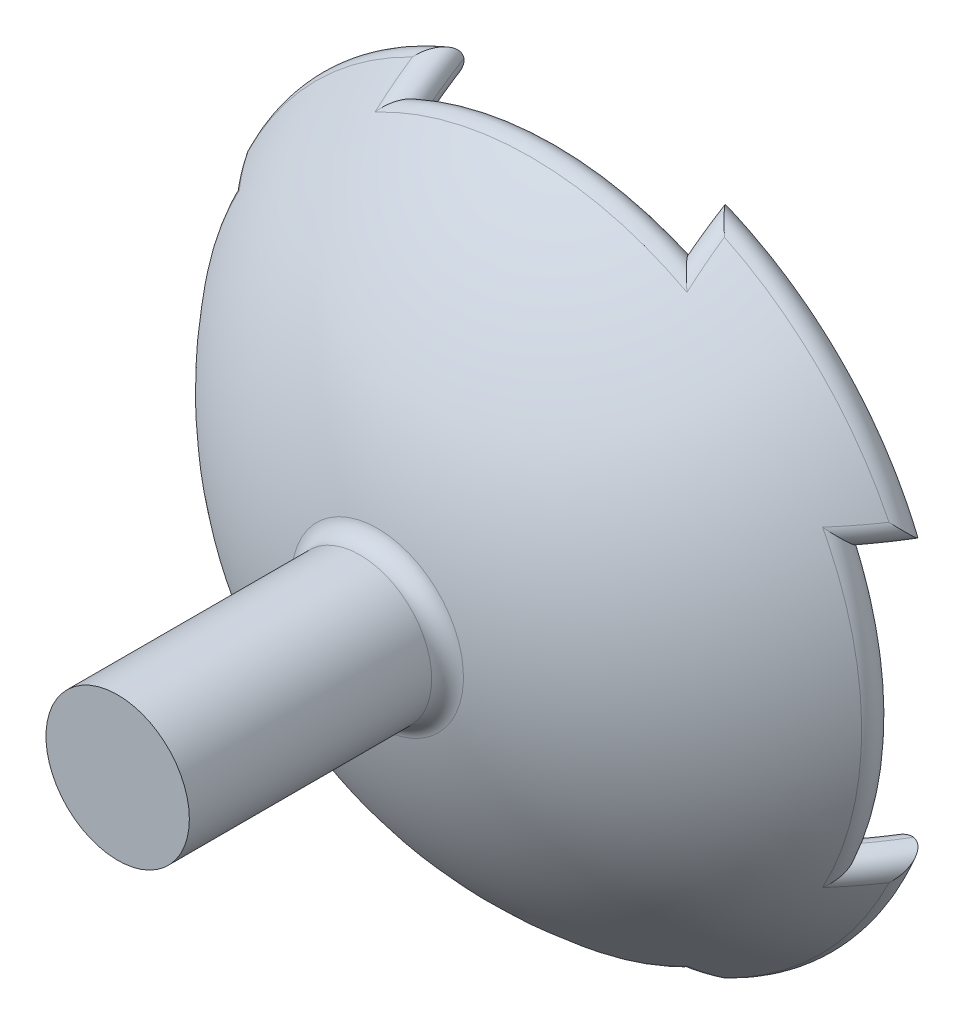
ISO-10303-21;
HEADER;
FILE_DESCRIPTION(('STEP AP214'),'2;1');
FILE_NAME('part.step','',(''),(''),'','','');
FILE_SCHEMA(('AUTOMOTIVE_DESIGN { 1 0 10303 214 1 1 1 1 }'));
ENDSEC;
DATA;
#1=APPLICATION_CONTEXT('core data for automotive mechanical design processes');
#2=APPLICATION_PROTOCOL_DEFINITION('international standard','automotive_design',2000,#1);
#3=PRODUCT_CONTEXT('',#1,'mechanical');
#4=PRODUCT('Part','Part','',(#3));
#5=PRODUCT_RELATED_PRODUCT_CATEGORY('part','',(#4));
#6=PRODUCT_DEFINITION_FORMATION('','',#4);
#7=PRODUCT_DEFINITION_CONTEXT('part definition',#1,'design');
#8=PRODUCT_DEFINITION('design','',#6,#7);
#9=PRODUCT_DEFINITION_SHAPE('','',#8);
#10=(LENGTH_UNIT() NAMED_UNIT(*) SI_UNIT(.MILLI.,.METRE.));
#11=(NAMED_UNIT(*) PLANE_ANGLE_UNIT() SI_UNIT($,.RADIAN.));
#12=(NAMED_UNIT(*) SI_UNIT($,.STERADIAN.) SOLID_ANGLE_UNIT());
#13=UNCERTAINTY_MEASURE_WITH_UNIT(LENGTH_MEASURE(1.E-05),#10,'distance_accuracy_value','');
#14=(GEOMETRIC_REPRESENTATION_CONTEXT(3) GLOBAL_UNCERTAINTY_ASSIGNED_CONTEXT((#13)) GLOBAL_UNIT_ASSIGNED_CONTEXT((#10,
#11,#12)) REPRESENTATION_CONTEXT('',''));
#15=CARTESIAN_POINT('',(0.,0.,0.));
#16=DIRECTION('',(0.,0.,1.));
#17=DIRECTION('',(1.,0.,0.));
#18=AXIS2_PLACEMENT_3D('',#15,#16,#17);
#19=CARTESIAN_POINT('',(0.,0.,-56.));
#20=DIRECTION('',(0.,0.,-1.));
#21=DIRECTION('',(1.,0.,0.));
#22=AXIS2_PLACEMENT_3D('',#19,#20,#21);
#23=SPHERICAL_SURFACE('',#22,35.);
#24=CARTESIAN_POINT('',(0.,0.,-37.7164179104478));
#25=DIRECTION('',(0.,0.,-1.));
#26=DIRECTION('',(-1.,0.,0.));
#27=AXIS2_PLACEMENT_3D('',#24,#25,#26);
#28=CIRCLE('',#27,29.8447755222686);
#29=CARTESIAN_POINT('',(-13.0597014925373,26.8357005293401,-37.7164179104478));
#30=VERTEX_POINT('',#29);
#31=CARTESIAN_POINT('',(-26.8357005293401,13.0597014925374,-37.7164179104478));
#32=VERTEX_POINT('',#31);
#33=EDGE_CURVE('E719',#30,#32,#28,.F.);
#34=ORIENTED_EDGE('',*,*,#33,.T.);
#35=CARTESIAN_POINT('',(0.,13.0597014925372,-56.0000000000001));
#36=DIRECTION('',(0.,-1.,0.));
#37=DIRECTION('',(0.,0.,-1.));
#38=AXIS2_PLACEMENT_3D('',#35,#36,#37);
#39=CIRCLE('',#38,32.4722065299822);
#40=CARTESIAN_POINT('',(-24.4073208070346,13.0597014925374,-34.5820895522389));
#41=VERTEX_POINT('',#40);
#42=EDGE_CURVE('E601',#32,#41,#39,.F.);
#43=ORIENTED_EDGE('',*,*,#42,.T.);
#44=CARTESIAN_POINT('',(0.,0.,-34.5820895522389));
#45=DIRECTION('',(0.,0.,-1.));
#46=DIRECTION('',(0.,1.,0.));
#47=AXIS2_PLACEMENT_3D('',#44,#45,#46);
#48=CIRCLE('',#47,27.6816385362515);
#49=CARTESIAN_POINT('',(-24.4073208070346,-13.0597014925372,-34.5820895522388));
#50=VERTEX_POINT('',#49);
#51=EDGE_CURVE('E678',#41,#50,#48,.F.);
#52=ORIENTED_EDGE('',*,*,#51,.T.);
#53=CARTESIAN_POINT('',(0.,-13.0597014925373,-56.));
#54=DIRECTION('',(0.,1.,0.));
#55=DIRECTION('',(-1.,0.,0.));
#56=AXIS2_PLACEMENT_3D('',#53,#54,#55);
#57=CIRCLE('',#56,32.4722065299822);
#58=CARTESIAN_POINT('',(-26.8357005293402,-13.0597014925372,-37.7164179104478));
#59=VERTEX_POINT('',#58);
#60=EDGE_CURVE('E681',#50,#59,#57,.F.);
#61=ORIENTED_EDGE('',*,*,#60,.T.);
#62=CARTESIAN_POINT('',(0.,0.,-37.7164179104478));
#63=DIRECTION('',(0.,0.,-1.));
#64=DIRECTION('',(-1.,0.,0.));
#65=AXIS2_PLACEMENT_3D('',#62,#63,#64);
#66=CIRCLE('',#65,29.8447755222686);
#67=CARTESIAN_POINT('',(-13.0597014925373,-26.8357005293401,-37.7164179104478));
#68=VERTEX_POINT('',#67);
#69=EDGE_CURVE('E684',#59,#68,#66,.F.);
#70=ORIENTED_EDGE('',*,*,#69,.T.);
#71=CARTESIAN_POINT('',(-13.0597014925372,0.,-56.0000000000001));
#72=DIRECTION('',(1.,0.,0.));
#73=DIRECTION('',(0.,0.,-1.));
#74=AXIS2_PLACEMENT_3D('',#71,#72,#73);
#75=CIRCLE('',#74,32.4722065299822);
#76=CARTESIAN_POINT('',(-13.0597014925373,-24.4073208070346,-34.5820895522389));
#77=VERTEX_POINT('',#76);
#78=EDGE_CURVE('E687',#68,#77,#75,.F.);
#79=ORIENTED_EDGE('',*,*,#78,.T.);
#80=CARTESIAN_POINT('',(0.,0.,-34.5820895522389));
#81=DIRECTION('',(0.,0.,-1.));
#82=DIRECTION('',(-1.,0.,0.));
#83=AXIS2_PLACEMENT_3D('',#80,#81,#82);
#84=CIRCLE('',#83,27.6816385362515);
#85=CARTESIAN_POINT('',(13.0597014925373,-24.4073208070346,-34.5820895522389));
#86=VERTEX_POINT('',#85);
#87=EDGE_CURVE('E690',#77,#86,#84,.F.);
#88=ORIENTED_EDGE('',*,*,#87,.T.);
#89=CARTESIAN_POINT('',(13.0597014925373,0.,-56.));
#90=DIRECTION('',(-1.,0.,0.));
#91=DIRECTION('',(0.,0.,1.));
#92=AXIS2_PLACEMENT_3D('',#89,#90,#91);
#93=CIRCLE('',#92,32.4722065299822);
#94=CARTESIAN_POINT('',(13.0597014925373,-26.8357005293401,-37.7164179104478));
#95=VERTEX_POINT('',#94);
#96=EDGE_CURVE('E693',#86,#95,#93,.F.);
#97=ORIENTED_EDGE('',*,*,#96,.T.);
#98=CARTESIAN_POINT('',(0.,0.,-37.7164179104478));
#99=DIRECTION('',(0.,0.,-1.));
#100=DIRECTION('',(-1.,0.,0.));
#101=AXIS2_PLACEMENT_3D('',#98,#99,#100);
#102=CIRCLE('',#101,29.8447755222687);
#103=CARTESIAN_POINT('',(26.8357005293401,-13.0597014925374,-37.7164179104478));
#104=VERTEX_POINT('',#103);
#105=EDGE_CURVE('E696',#95,#104,#102,.F.);
#106=ORIENTED_EDGE('',*,*,#105,.T.);
#107=CARTESIAN_POINT('',(0.,-13.0597014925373,-56.));
#108=DIRECTION('',(0.,1.,0.));
#109=DIRECTION('',(-1.,0.,0.));
#110=AXIS2_PLACEMENT_3D('',#107,#108,#109);
#111=CIRCLE('',#110,32.4722065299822);
#112=CARTESIAN_POINT('',(24.4073208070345,-13.0597014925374,-34.5820895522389));
#113=VERTEX_POINT('',#112);
#114=EDGE_CURVE('E699',#104,#113,#111,.F.);
#115=ORIENTED_EDGE('',*,*,#114,.T.);
#116=CARTESIAN_POINT('',(0.,0.,-34.5820895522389));
#117=DIRECTION('',(0.,0.,-1.));
#118=DIRECTION('',(0.,1.,0.));
#119=AXIS2_PLACEMENT_3D('',#116,#117,#118);
#120=CIRCLE('',#119,27.6816385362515);
#121=CARTESIAN_POINT('',(24.4073208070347,13.0597014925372,-34.5820895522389));
#122=VERTEX_POINT('',#121);
#123=EDGE_CURVE('E702',#113,#122,#120,.F.);
#124=ORIENTED_EDGE('',*,*,#123,.T.);
#125=CARTESIAN_POINT('',(0.,13.0597014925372,-56.0000000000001));
#126=DIRECTION('',(0.,-1.,0.));
#127=DIRECTION('',(0.,0.,-1.));
#128=AXIS2_PLACEMENT_3D('',#125,#126,#127);
#129=CIRCLE('',#128,32.4722065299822);
#130=CARTESIAN_POINT('',(26.8357005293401,13.0597014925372,-37.7164179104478));
#131=VERTEX_POINT('',#130);
#132=EDGE_CURVE('E705',#122,#131,#129,.F.);
#133=ORIENTED_EDGE('',*,*,#132,.T.);
#134=CARTESIAN_POINT('',(0.,0.,-37.7164179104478));
#135=DIRECTION('',(0.,0.,-1.));
#136=DIRECTION('',(-1.,0.,0.));
#137=AXIS2_PLACEMENT_3D('',#134,#135,#136);
#138=CIRCLE('',#137,29.8447755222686);
#139=CARTESIAN_POINT('',(13.0597014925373,26.8357005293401,-37.7164179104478));
#140=VERTEX_POINT('',#139);
#141=EDGE_CURVE('E708',#131,#140,#138,.F.);
#142=ORIENTED_EDGE('',*,*,#141,.T.);
#143=CARTESIAN_POINT('',(13.0597014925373,0.,-56.));
#144=DIRECTION('',(-1.,0.,0.));
#145=DIRECTION('',(0.,0.,1.));
#146=AXIS2_PLACEMENT_3D('',#143,#144,#145);
#147=CIRCLE('',#146,32.4722065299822);
#148=CARTESIAN_POINT('',(13.0597014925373,24.4073208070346,-34.5820895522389));
#149=VERTEX_POINT('',#148);
#150=EDGE_CURVE('E711',#140,#149,#147,.F.);
#151=ORIENTED_EDGE('',*,*,#150,.T.);
#152=CARTESIAN_POINT('',(0.,0.,-34.5820895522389));
#153=DIRECTION('',(0.,0.,-1.));
#154=DIRECTION('',(-1.,0.,0.));
#155=AXIS2_PLACEMENT_3D('',#152,#153,#154);
#156=CIRCLE('',#155,27.6816385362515);
#157=CARTESIAN_POINT('',(-13.0597014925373,24.4073208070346,-34.5820895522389));
#158=VERTEX_POINT('',#157);
#159=EDGE_CURVE('E714',#149,#158,#156,.F.);
#160=ORIENTED_EDGE('',*,*,#159,.T.);
#161=CARTESIAN_POINT('',(-13.0597014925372,0.,-56.0000000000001));
#162=DIRECTION('',(1.,0.,0.));
#163=DIRECTION('',(0.,0.,-1.));
#164=AXIS2_PLACEMENT_3D('',#161,#162,#163);
#165=CIRCLE('',#164,32.4722065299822);
#166=EDGE_CURVE('E717',#158,#30,#165,.F.);
#167=ORIENTED_EDGE('',*,*,#166,.T.);
#168=EDGE_LOOP('',(#34,#43,#52,#61,#70,#79,#88,#97,#106,#115,#124,#133,#142,#151,#160,#167));
#169=FACE_BOUND('',#168,.T.);
#170=CARTESIAN_POINT('',(0.,0.,-21.7468499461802));
#171=DIRECTION('',(0.,0.,-1.));
#172=DIRECTION('',(-1.,0.,0.));
#173=AXIS2_PLACEMENT_3D('',#170,#171,#172);
#174=CIRCLE('',#173,7.19178082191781);
#175=CARTESIAN_POINT('',(-7.19178082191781,0.,-21.7468499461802));
#176=VERTEX_POINT('',#175);
#177=EDGE_CURVE('E351',#176,#176,#174,.T.);
#178=ORIENTED_EDGE('',*,*,#177,.T.);
#179=EDGE_LOOP('',(#178));
#180=FACE_BOUND('',#179,.T.);
#181=ADVANCED_FACE('F43',(#169,#180),#23,.T.);
#182=CARTESIAN_POINT('',(0.,0.,-56.));
#183=DIRECTION('',(0.,0.,-1.));
#184=DIRECTION('',(1.,0.,0.));
#185=AXIS2_PLACEMENT_3D('',#182,#183,#184);
#186=SPHERICAL_SURFACE('',#185,32.);
#187=CARTESIAN_POINT('',(0.,0.,-36.4179104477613));
#188=DIRECTION('',(0.,0.,-1.));
#189=DIRECTION('',(-1.,0.,0.));
#190=AXIS2_PLACEMENT_3D('',#187,#188,#189);
#191=CIRCLE('',#190,25.3089266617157);
#192=CARTESIAN_POINT('',(11.9402985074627,-22.3152647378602,-36.4179104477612));
#193=VERTEX_POINT('',#192);
#194=CARTESIAN_POINT('',(-11.9402985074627,-22.3152647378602,-36.4179104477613));
#195=VERTEX_POINT('',#194);
#196=EDGE_CURVE('E287',#193,#195,#191,.T.);
#197=ORIENTED_EDGE('',*,*,#196,.T.);
#198=CARTESIAN_POINT('',(-11.9402985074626,0.,-56.0000000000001));
#199=DIRECTION('',(1.,0.,0.));
#200=DIRECTION('',(0.,0.,-1.));
#201=AXIS2_PLACEMENT_3D('',#198,#199,#200);
#202=CIRCLE('',#201,29.688874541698);
#203=CARTESIAN_POINT('',(-11.9402985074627,-24.5354976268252,-39.2835820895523));
#204=VERTEX_POINT('',#203);
#205=EDGE_CURVE('E266',#195,#204,#202,.T.);
#206=ORIENTED_EDGE('',*,*,#205,.T.);
#207=CARTESIAN_POINT('',(0.,0.,-39.2835820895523));
#208=DIRECTION('',(0.,0.,-1.));
#209=DIRECTION('',(-1.,0.,0.));
#210=AXIS2_PLACEMENT_3D('',#207,#208,#209);
#211=CIRCLE('',#210,27.2866519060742);
#212=CARTESIAN_POINT('',(-24.5354976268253,-11.9402985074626,-39.2835820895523));
#213=VERTEX_POINT('',#212);
#214=EDGE_CURVE('E276',#204,#213,#211,.T.);
#215=ORIENTED_EDGE('',*,*,#214,.T.);
#216=CARTESIAN_POINT('',(0.,-11.9402985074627,-56.));
#217=DIRECTION('',(0.,1.,0.));
#218=DIRECTION('',(-1.,0.,0.));
#219=AXIS2_PLACEMENT_3D('',#216,#217,#218);
#220=CIRCLE('',#219,29.688874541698);
#221=CARTESIAN_POINT('',(-22.3152647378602,-11.9402985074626,-36.4179104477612));
#222=VERTEX_POINT('',#221);
#223=EDGE_CURVE('E282',#213,#222,#220,.T.);
#224=ORIENTED_EDGE('',*,*,#223,.T.);
#225=CARTESIAN_POINT('',(0.,0.,-36.4179104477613));
#226=DIRECTION('',(0.,0.,-1.));
#227=DIRECTION('',(0.,1.,0.));
#228=AXIS2_PLACEMENT_3D('',#225,#226,#227);
#229=CIRCLE('',#228,25.3089266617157);
#230=CARTESIAN_POINT('',(-22.3152647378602,11.9402985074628,-36.4179104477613));
#231=VERTEX_POINT('',#230);
#232=EDGE_CURVE('E850',#222,#231,#229,.T.);
#233=ORIENTED_EDGE('',*,*,#232,.T.);
#234=CARTESIAN_POINT('',(0.,11.9402985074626,-56.0000000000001));
#235=DIRECTION('',(0.,-1.,0.));
#236=DIRECTION('',(0.,0.,-1.));
#237=AXIS2_PLACEMENT_3D('',#234,#235,#236);
#238=CIRCLE('',#237,29.688874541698);
#239=CARTESIAN_POINT('',(-24.5354976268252,11.9402985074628,-39.2835820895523));
#240=VERTEX_POINT('',#239);
#241=EDGE_CURVE('E853',#231,#240,#238,.T.);
#242=ORIENTED_EDGE('',*,*,#241,.T.);
#243=CARTESIAN_POINT('',(0.,0.,-39.2835820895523));
#244=DIRECTION('',(0.,0.,-1.));
#245=DIRECTION('',(-1.,0.,0.));
#246=AXIS2_PLACEMENT_3D('',#243,#244,#245);
#247=CIRCLE('',#246,27.2866519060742);
#248=CARTESIAN_POINT('',(-11.9402985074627,24.5354976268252,-39.2835820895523));
#249=VERTEX_POINT('',#248);
#250=EDGE_CURVE('E856',#240,#249,#247,.T.);
#251=ORIENTED_EDGE('',*,*,#250,.T.);
#252=CARTESIAN_POINT('',(-11.9402985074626,0.,-56.0000000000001));
#253=DIRECTION('',(1.,0.,0.));
#254=DIRECTION('',(0.,0.,-1.));
#255=AXIS2_PLACEMENT_3D('',#252,#253,#254);
#256=CIRCLE('',#255,29.688874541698);
#257=CARTESIAN_POINT('',(-11.9402985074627,22.3152647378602,-36.4179104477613));
#258=VERTEX_POINT('',#257);
#259=EDGE_CURVE('E859',#249,#258,#256,.T.);
#260=ORIENTED_EDGE('',*,*,#259,.T.);
#261=CARTESIAN_POINT('',(0.,0.,-36.4179104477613));
#262=DIRECTION('',(0.,0.,-1.));
#263=DIRECTION('',(-1.,0.,0.));
#264=AXIS2_PLACEMENT_3D('',#261,#262,#263);
#265=CIRCLE('',#264,25.3089266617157);
#266=CARTESIAN_POINT('',(11.9402985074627,22.3152647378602,-36.4179104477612));
#267=VERTEX_POINT('',#266);
#268=EDGE_CURVE('E862',#258,#267,#265,.T.);
#269=ORIENTED_EDGE('',*,*,#268,.T.);
#270=CARTESIAN_POINT('',(11.9402985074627,0.,-56.));
#271=DIRECTION('',(-1.,0.,0.));
#272=DIRECTION('',(0.,0.,1.));
#273=AXIS2_PLACEMENT_3D('',#270,#271,#272);
#274=CIRCLE('',#273,29.688874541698);
#275=CARTESIAN_POINT('',(11.9402985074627,24.5354976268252,-39.2835820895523));
#276=VERTEX_POINT('',#275);
#277=EDGE_CURVE('E865',#267,#276,#274,.T.);
#278=ORIENTED_EDGE('',*,*,#277,.T.);
#279=CARTESIAN_POINT('',(0.,0.,-39.2835820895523));
#280=DIRECTION('',(0.,0.,-1.));
#281=DIRECTION('',(-1.,0.,0.));
#282=AXIS2_PLACEMENT_3D('',#279,#280,#281);
#283=CIRCLE('',#282,27.2866519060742);
#284=CARTESIAN_POINT('',(24.5354976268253,11.9402985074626,-39.2835820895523));
#285=VERTEX_POINT('',#284);
#286=EDGE_CURVE('E868',#276,#285,#283,.T.);
#287=ORIENTED_EDGE('',*,*,#286,.T.);
#288=CARTESIAN_POINT('',(0.,11.9402985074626,-56.0000000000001));
#289=DIRECTION('',(0.,-1.,0.));
#290=DIRECTION('',(0.,0.,-1.));
#291=AXIS2_PLACEMENT_3D('',#288,#289,#290);
#292=CIRCLE('',#291,29.688874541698);
#293=CARTESIAN_POINT('',(22.3152647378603,11.9402985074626,-36.4179104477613));
#294=VERTEX_POINT('',#293);
#295=EDGE_CURVE('E871',#285,#294,#292,.T.);
#296=ORIENTED_EDGE('',*,*,#295,.T.);
#297=CARTESIAN_POINT('',(0.,0.,-36.4179104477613));
#298=DIRECTION('',(0.,0.,-1.));
#299=DIRECTION('',(0.,1.,0.));
#300=AXIS2_PLACEMENT_3D('',#297,#298,#299);
#301=CIRCLE('',#300,25.3089266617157);
#302=CARTESIAN_POINT('',(22.3152647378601,-11.9402985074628,-36.4179104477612));
#303=VERTEX_POINT('',#302);
#304=EDGE_CURVE('E874',#294,#303,#301,.T.);
#305=ORIENTED_EDGE('',*,*,#304,.T.);
#306=CARTESIAN_POINT('',(0.,-11.9402985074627,-56.));
#307=DIRECTION('',(0.,1.,0.));
#308=DIRECTION('',(-1.,0.,0.));
#309=AXIS2_PLACEMENT_3D('',#306,#307,#308);
#310=CIRCLE('',#309,29.688874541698);
#311=CARTESIAN_POINT('',(24.5354976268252,-11.9402985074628,-39.2835820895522));
#312=VERTEX_POINT('',#311);
#313=EDGE_CURVE('E877',#303,#312,#310,.T.);
#314=ORIENTED_EDGE('',*,*,#313,.T.);
#315=CARTESIAN_POINT('',(0.,0.,-39.2835820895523));
#316=DIRECTION('',(0.,0.,-1.));
#317=DIRECTION('',(-1.,0.,0.));
#318=AXIS2_PLACEMENT_3D('',#315,#316,#317);
#319=CIRCLE('',#318,27.2866519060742);
#320=CARTESIAN_POINT('',(11.9402985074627,-24.5354976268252,-39.2835820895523));
#321=VERTEX_POINT('',#320);
#322=EDGE_CURVE('E880',#312,#321,#319,.T.);
#323=ORIENTED_EDGE('',*,*,#322,.T.);
#324=CARTESIAN_POINT('',(11.9402985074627,0.,-56.));
#325=DIRECTION('',(-1.,0.,0.));
#326=DIRECTION('',(0.,0.,1.));
#327=AXIS2_PLACEMENT_3D('',#324,#325,#326);
#328=CIRCLE('',#327,29.688874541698);
#329=EDGE_CURVE('E295',#321,#193,#328,.T.);
#330=ORIENTED_EDGE('',*,*,#329,.T.);
#331=EDGE_LOOP('',(#197,#206,#215,#224,#233,#242,#251,#260,#269,#278,#287,#296,#305,#314,#323,#330));
#332=FACE_BOUND('',#331,.T.);
#333=ADVANCED_FACE('F285',(#332),#186,.F.);
#334=CARTESIAN_POINT('',(0.,0.,0.));
#335=DIRECTION('',(0.,0.,1.));
#336=DIRECTION('',(1.,0.,0.));
#337=AXIS2_PLACEMENT_3D('',#334,#335,#336);
#338=PLANE('',#337);
#339=CARTESIAN_POINT('',(0.,0.,0.));
#340=DIRECTION('',(0.,0.,1.));
#341=DIRECTION('',(1.,0.,0.));
#342=AXIS2_PLACEMENT_3D('',#339,#340,#341);
#343=CIRCLE('',#342,6.);
#344=CARTESIAN_POINT('',(6.,0.,0.));
#345=VERTEX_POINT('',#344);
#346=EDGE_CURVE('E283',#345,#345,#343,.T.);
#347=ORIENTED_EDGE('',*,*,#346,.T.);
#348=EDGE_LOOP('',(#347));
#349=FACE_BOUND('',#348,.T.);
#350=ADVANCED_FACE('F831',(#349),#338,.T.);
#351=CARTESIAN_POINT('',(0.,0.,-91.001));
#352=DIRECTION('',(0.,0.,1.));
#353=DIRECTION('',(1.,0.,0.));
#354=AXIS2_PLACEMENT_3D('',#351,#352,#353);
#355=CYLINDRICAL_SURFACE('',#354,6.);
#356=CARTESIAN_POINT('',(0.,0.,-20.2788578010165));
#357=DIRECTION('',(0.,0.,-1.));
#358=DIRECTION('',(-1.,0.,0.));
#359=AXIS2_PLACEMENT_3D('',#356,#357,#358);
#360=CIRCLE('',#359,6.);
#361=CARTESIAN_POINT('',(-6.,0.,-20.2788578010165));
#362=VERTEX_POINT('',#361);
#363=EDGE_CURVE('E977',#362,#362,#360,.F.);
#364=ORIENTED_EDGE('',*,*,#363,.T.);
#365=EDGE_LOOP('',(#364));
#366=FACE_BOUND('',#365,.T.);
#367=ORIENTED_EDGE('',*,*,#346,.F.);
#368=EDGE_LOOP('',(#367));
#369=FACE_BOUND('',#368,.T.);
#370=ADVANCED_FACE('F834',(#366,#369),#355,.T.);
#371=CARTESIAN_POINT('',(12.5,0.,-56.));
#372=DIRECTION('',(1.,0.,0.));
#373=DIRECTION('',(0.,0.,-1.));
#374=AXIS2_PLACEMENT_3D('',#371,#372,#373);
#375=TOROIDAL_SURFACE('',#374,31.0805405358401,1.5);
#376=CARTESIAN_POINT('',(11.,0.,-56.));
#377=DIRECTION('',(1.,0.,0.));
#378=DIRECTION('',(0.,0.,-1.));
#379=AXIS2_PLACEMENT_3D('',#376,#377,#378);
#380=CIRCLE('',#379,31.0805405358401);
#381=CARTESIAN_POINT('',(11.,26.633243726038,-39.9790659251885));
#382=VERTEX_POINT('',#381);
#383=CARTESIAN_POINT('',(11.,24.5527500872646,-36.943178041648));
#384=VERTEX_POINT('',#383);
#385=EDGE_CURVE('E328',#382,#384,#380,.T.);
#386=ORIENTED_EDGE('',*,*,#385,.F.);
#387=CARTESIAN_POINT('',(11.,26.633243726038,-39.9790659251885));
#388=CARTESIAN_POINT('',(10.9999996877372,26.6100532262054,-39.982685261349));
#389=CARTESIAN_POINT('',(11.0004724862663,26.5867892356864,-39.985805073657));
#390=CARTESIAN_POINT('',(11.0023081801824,26.5402520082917,-39.9910842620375));
#391=CARTESIAN_POINT('',(11.0036686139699,26.5169789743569,-39.9932462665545));
#392=CARTESIAN_POINT('',(11.0072238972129,26.4704344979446,-39.9966677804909));
#393=CARTESIAN_POINT('',(11.0094186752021,26.4471630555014,-39.997927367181));
#394=CARTESIAN_POINT('',(11.0145968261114,26.400611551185,-39.9995946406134));
#395=CARTESIAN_POINT('',(11.0175823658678,26.3773316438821,-39.9999999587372));
#396=CARTESIAN_POINT('',(11.0209340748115,26.3541080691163,-40.));
#397=B_SPLINE_CURVE_WITH_KNOTS('',3,(#387,#388,#389,#390,#391,#392,#393,#394,#395,#396),
.UNSPECIFIED.,.F.,.F.,(4,2,2,2,4),(0.,0.0703971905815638,0.140599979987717,0.210796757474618,
0.281187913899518),.UNSPECIFIED.);
#398=CARTESIAN_POINT('',(11.0209340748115,26.3541080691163,-40.));
#399=VERTEX_POINT('',#398);
#400=EDGE_CURVE('E765',#382,#399,#397,.T.);
#401=ORIENTED_EDGE('',*,*,#400,.T.);
#402=CARTESIAN_POINT('',(11.0209340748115,26.3541080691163,-40.));
#403=CARTESIAN_POINT('',(11.0302249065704,26.2899016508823,-39.9999741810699));
#404=CARTESIAN_POINT('',(11.0422486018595,26.2262301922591,-39.9969050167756));
#405=CARTESIAN_POINT('',(11.0708541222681,26.1006106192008,-39.9855512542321));
#406=CARTESIAN_POINT('',(11.0874197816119,26.0386572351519,-39.9772850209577));
#407=CARTESIAN_POINT('',(11.124084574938,25.9173134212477,-39.956506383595));
#408=CARTESIAN_POINT('',(11.1441445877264,25.8579028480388,-39.9440396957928));
#409=CARTESIAN_POINT('',(11.1873288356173,25.7410488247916,-39.9154550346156));
#410=CARTESIAN_POINT('',(11.2104564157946,25.6836076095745,-39.8993330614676));
#411=CARTESIAN_POINT('',(11.2689088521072,25.548556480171,-39.8569742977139));
#412=CARTESIAN_POINT('',(11.3054447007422,25.4719357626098,-39.8292569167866));
#413=CARTESIAN_POINT('',(11.3825005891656,25.3228237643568,-39.768791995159));
#414=CARTESIAN_POINT('',(11.4230213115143,25.2503331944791,-39.7360435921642));
#415=CARTESIAN_POINT('',(11.507511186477,25.1091721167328,-39.6661374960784));
#416=CARTESIAN_POINT('',(11.5514933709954,25.0405178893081,-39.6289628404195));
#417=CARTESIAN_POINT('',(11.6422311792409,24.9073387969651,-39.5508829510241));
#418=CARTESIAN_POINT('',(11.688985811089,24.8428124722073,-39.5099790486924));
#419=CARTESIAN_POINT('',(11.7691041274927,24.7384572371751,-39.438860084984));
#420=CARTESIAN_POINT('',(11.8018095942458,24.6974904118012,-39.4095587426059));
#421=CARTESIAN_POINT('',(11.8681673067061,24.6174898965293,-39.3495910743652));
#422=CARTESIAN_POINT('',(11.9018180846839,24.5784534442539,-39.318926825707));
#423=CARTESIAN_POINT('',(11.9373796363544,24.5387485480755,-39.2862643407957));
#424=CARTESIAN_POINT('',(11.9388386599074,24.5371222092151,-39.2849238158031));
#425=CARTESIAN_POINT('',(11.9402985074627,24.5354976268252,-39.2835820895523));
#426=B_SPLINE_CURVE_WITH_KNOTS('',3,(#402,#403,#404,#405,#406,#407,#408,#409,#410,#411,#412,
#413,#414,#415,#416,#417,#418,#419,#420,#421,#422,#423,#424,#425),.UNSPECIFIED.,.F.,.F.,(4,2,2,
2,2,2,2,2,2,2,2,4),(0.,0.194297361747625,0.387911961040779,0.579483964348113,0.77126661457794,
1.03875444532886,1.30628817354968,1.57488232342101,1.84338095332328,2.02349609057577,
2.20334554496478,2.21103557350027),.UNSPECIFIED.);
#427=EDGE_CURVE('E667',#276,#399,#426,.F.);
#428=ORIENTED_EDGE('',*,*,#427,.F.);
#429=ORIENTED_EDGE('',*,*,#277,.F.);
#430=CARTESIAN_POINT('',(11.0568219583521,24.0779294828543,-37.));
#431=CARTESIAN_POINT('',(11.0707530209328,24.0154073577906,-36.9999737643));
#432=CARTESIAN_POINT('',(11.0867412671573,23.9534340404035,-36.9973996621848));
#433=CARTESIAN_POINT('',(11.1221506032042,23.8309687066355,-36.9878363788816));
#434=CARTESIAN_POINT('',(11.1415635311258,23.7704735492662,-36.9808575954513));
#435=CARTESIAN_POINT('',(11.1830913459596,23.6513986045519,-36.9632105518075));
#436=CARTESIAN_POINT('',(11.205189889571,23.5928097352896,-36.9525639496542));
#437=CARTESIAN_POINT('',(11.2517484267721,23.4772239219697,-36.9280523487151));
#438=CARTESIAN_POINT('',(11.2762103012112,23.4202282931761,-36.9141847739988));
#439=CARTESIAN_POINT('',(11.3455792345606,23.2671846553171,-36.8725646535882));
#440=CARTESIAN_POINT('',(11.3924531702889,23.1727765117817,-36.8420338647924));
#441=CARTESIAN_POINT('',(11.4907945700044,22.9889541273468,-36.7741132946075));
#442=CARTESIAN_POINT('',(11.5422646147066,22.8995427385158,-36.7367196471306));
#443=CARTESIAN_POINT('',(11.649020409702,22.725552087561,-36.6560043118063));
#444=CARTESIAN_POINT('',(11.7043138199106,22.6409831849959,-36.6126705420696));
#445=CARTESIAN_POINT('',(11.8179882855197,22.4769634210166,-36.5208419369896));
#446=CARTESIAN_POINT('',(11.8763672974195,22.3975092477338,-36.4723504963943));
#447=CARTESIAN_POINT('',(11.9374803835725,22.3188831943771,-36.4203121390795));
#448=CARTESIAN_POINT('',(11.9388890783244,22.3170732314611,-36.419111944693));
#449=CARTESIAN_POINT('',(11.9402985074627,22.3152647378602,-36.4179104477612));
#450=B_SPLINE_CURVE_WITH_KNOTS('',3,(#430,#431,#432,#433,#434,#435,#436,#437,#438,#439,#440,
#441,#442,#443,#444,#445,#446,#447,#448,#449),.UNSPECIFIED.,.F.,.F.,(4,2,2,2,2,2,2,2,2,4),(0.,
0.191953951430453,0.383456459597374,0.573847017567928,0.764390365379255,1.0930536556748,
1.42190266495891,1.75143074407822,2.08074325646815,2.08850905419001),.UNSPECIFIED.);
#451=CARTESIAN_POINT('',(11.0568219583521,24.0779294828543,-37.));
#452=VERTEX_POINT('',#451);
#453=EDGE_CURVE('E659',#452,#267,#450,.T.);
#454=ORIENTED_EDGE('',*,*,#453,.F.);
#455=CARTESIAN_POINT('',(11.0568219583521,24.0779294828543,-37.));
#456=CARTESIAN_POINT('',(11.0480454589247,24.1173962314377,-36.9999968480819));
#457=CARTESIAN_POINT('',(11.0401045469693,24.1570733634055,-36.9989624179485));
#458=CARTESIAN_POINT('',(11.0261999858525,24.2363628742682,-36.9946060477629));
#459=CARTESIAN_POINT('',(11.0202231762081,24.2759738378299,-36.9912998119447));
#460=CARTESIAN_POINT('',(11.0104238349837,24.3552076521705,-36.9821794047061));
#461=CARTESIAN_POINT('',(11.0066021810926,24.3948305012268,-36.9763642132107));
#462=CARTESIAN_POINT('',(11.001381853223,24.4740033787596,-36.9619414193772));
#463=CARTESIAN_POINT('',(11.0000000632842,24.5135510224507,-36.9533148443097));
#464=CARTESIAN_POINT('',(11.,24.5527500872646,-36.943178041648));
#465=B_SPLINE_CURVE_WITH_KNOTS('',3,(#455,#456,#457,#458,#459,#460,#461,#462,#463,#464),
.UNSPECIFIED.,.F.,.F.,(4,2,2,2,4),(0.,0.1213048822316,0.241779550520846,0.362303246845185,
0.483657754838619),.UNSPECIFIED.);
#466=EDGE_CURVE('E966',#452,#384,#465,.T.);
#467=ORIENTED_EDGE('',*,*,#466,.T.);
#468=EDGE_LOOP('',(#386,#401,#428,#429,#454,#467));
#469=FACE_BOUND('',#468,.T.);
#470=ADVANCED_FACE('F547',(#469),#375,.T.);
#471=CARTESIAN_POINT('',(0.,0.,-38.5));
#472=DIRECTION('',(0.,0.,1.));
#473=DIRECTION('',(1.,0.,0.));
#474=AXIS2_PLACEMENT_3D('',#471,#472,#473);
#475=TOROIDAL_SURFACE('',#474,28.5657137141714,1.5);
#476=ORIENTED_EDGE('',*,*,#427,.T.);
#477=CARTESIAN_POINT('',(0.,0.,-40.));
#478=DIRECTION('',(0.,0.,1.));
#479=DIRECTION('',(1.,0.,0.));
#480=AXIS2_PLACEMENT_3D('',#477,#478,#479);
#481=CIRCLE('',#480,28.5657137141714);
#482=CARTESIAN_POINT('',(26.3541080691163,11.0209340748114,-40.));
#483=VERTEX_POINT('',#482);
#484=EDGE_CURVE('E324',#483,#399,#481,.T.);
#485=ORIENTED_EDGE('',*,*,#484,.F.);
#486=CARTESIAN_POINT('',(26.3541080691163,11.0209340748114,-40.));
#487=CARTESIAN_POINT('',(26.2899016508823,11.0302249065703,-39.9999741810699));
#488=CARTESIAN_POINT('',(26.2262301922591,11.0422486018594,-39.9969050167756));
#489=CARTESIAN_POINT('',(26.1006106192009,11.070854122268,-39.9855512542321));
#490=CARTESIAN_POINT('',(26.038657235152,11.0874197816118,-39.9772850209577));
#491=CARTESIAN_POINT('',(25.9173134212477,11.1240845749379,-39.956506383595));
#492=CARTESIAN_POINT('',(25.8579028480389,11.1441445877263,-39.9440396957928));
#493=CARTESIAN_POINT('',(25.7410488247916,11.1873288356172,-39.9154550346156));
#494=CARTESIAN_POINT('',(25.6836076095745,11.2104564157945,-39.8993330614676));
#495=CARTESIAN_POINT('',(25.5485564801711,11.2689088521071,-39.8569742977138));
#496=CARTESIAN_POINT('',(25.4719357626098,11.3054447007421,-39.8292569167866));
#497=CARTESIAN_POINT('',(25.3228237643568,11.3825005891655,-39.768791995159));
#498=CARTESIAN_POINT('',(25.2503331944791,11.4230213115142,-39.7360435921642));
#499=CARTESIAN_POINT('',(25.1091721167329,11.5075111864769,-39.6661374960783));
#500=CARTESIAN_POINT('',(25.0405178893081,11.5514933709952,-39.6289628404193));
#501=CARTESIAN_POINT('',(24.9073387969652,11.642231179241,-39.5508829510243));
#502=CARTESIAN_POINT('',(24.8428124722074,11.6889858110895,-39.5099790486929));
#503=CARTESIAN_POINT('',(24.738457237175,11.7691041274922,-39.4388600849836));
#504=CARTESIAN_POINT('',(24.697490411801,11.8018095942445,-39.4095587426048));
#505=CARTESIAN_POINT('',(24.6174898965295,11.8681673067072,-39.3495910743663));
#506=CARTESIAN_POINT('',(24.5784534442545,11.9018180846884,-39.3189268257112));
#507=CARTESIAN_POINT('',(24.5387485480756,11.9373796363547,-39.2862643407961));
#508=CARTESIAN_POINT('',(24.5371222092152,11.9388386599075,-39.2849238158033));
#509=CARTESIAN_POINT('',(24.5354976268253,11.9402985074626,-39.2835820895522));
#510=B_SPLINE_CURVE_WITH_KNOTS('',3,(#486,#487,#488,#489,#490,#491,#492,#493,#494,#495,#496,
#497,#498,#499,#500,#501,#502,#503,#504,#505,#506,#507,#508,#509),.UNSPECIFIED.,.F.,.F.,(4,2,2,
2,2,2,2,2,2,2,2,4),(0.,0.194297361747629,0.387911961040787,0.579483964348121,0.771266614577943,
1.03875444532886,1.30628817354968,1.57488232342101,1.8433809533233,2.02349609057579,
2.20334554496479,2.21103557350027),.UNSPECIFIED.);
#511=EDGE_CURVE('E641',#285,#483,#510,.F.);
#512=ORIENTED_EDGE('',*,*,#511,.F.);
#513=ORIENTED_EDGE('',*,*,#286,.F.);
#514=EDGE_LOOP('',(#476,#485,#512,#513));
#515=FACE_BOUND('',#514,.T.);
#516=ADVANCED_FACE('F655',(#515),#475,.T.);
#517=CARTESIAN_POINT('',(0.,0.,-35.5000000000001));
#518=DIRECTION('',(0.,0.,1.));
#519=DIRECTION('',(1.,0.,0.));
#520=AXIS2_PLACEMENT_3D('',#517,#518,#519);
#521=TOROIDAL_SURFACE('',#520,26.4952825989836,1.5);
#522=ORIENTED_EDGE('',*,*,#453,.T.);
#523=ORIENTED_EDGE('',*,*,#268,.F.);
#524=CARTESIAN_POINT('',(-11.0568219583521,24.0779294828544,-37.0000000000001));
#525=CARTESIAN_POINT('',(-11.0707530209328,24.0154073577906,-36.9999737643));
#526=CARTESIAN_POINT('',(-11.0867412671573,23.9534340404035,-36.9973996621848));
#527=CARTESIAN_POINT('',(-11.1221506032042,23.8309687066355,-36.9878363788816));
#528=CARTESIAN_POINT('',(-11.1415635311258,23.7704735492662,-36.9808575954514));
#529=CARTESIAN_POINT('',(-11.1830913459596,23.6513986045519,-36.9632105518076));
#530=CARTESIAN_POINT('',(-11.205189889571,23.5928097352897,-36.9525639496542));
#531=CARTESIAN_POINT('',(-11.2517484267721,23.4772239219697,-36.9280523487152));
#532=CARTESIAN_POINT('',(-11.2762103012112,23.4202282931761,-36.9141847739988));
#533=CARTESIAN_POINT('',(-11.3455792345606,23.2671846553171,-36.8725646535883));
#534=CARTESIAN_POINT('',(-11.3924531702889,23.1727765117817,-36.8420338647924));
#535=CARTESIAN_POINT('',(-11.4907945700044,22.9889541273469,-36.7741132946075));
#536=CARTESIAN_POINT('',(-11.5422646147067,22.8995427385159,-36.7367196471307));
#537=CARTESIAN_POINT('',(-11.649020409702,22.7255520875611,-36.6560043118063));
#538=CARTESIAN_POINT('',(-11.7043138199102,22.6409831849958,-36.6126705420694));
#539=CARTESIAN_POINT('',(-11.81798828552,22.4769634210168,-36.5208419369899));
#540=CARTESIAN_POINT('',(-11.8763672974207,22.3975092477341,-36.4723504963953));
#541=CARTESIAN_POINT('',(-11.9374803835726,22.3188831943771,-36.4203121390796));
#542=CARTESIAN_POINT('',(-11.9388890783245,22.3170732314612,-36.4191119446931));
#543=CARTESIAN_POINT('',(-11.9402985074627,22.3152647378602,-36.4179104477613));
#544=B_SPLINE_CURVE_WITH_KNOTS('',3,(#524,#525,#526,#527,#528,#529,#530,#531,#532,#533,#534,
#535,#536,#537,#538,#539,#540,#541,#542,#543),.UNSPECIFIED.,.F.,.F.,(4,2,2,2,2,2,2,2,2,4),(0.,
0.191953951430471,0.383456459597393,0.573847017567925,0.764390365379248,1.0930536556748,
1.42190266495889,1.75143074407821,2.08074325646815,2.08850905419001),.UNSPECIFIED.);
#545=CARTESIAN_POINT('',(-11.0568219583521,24.0779294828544,-37.0000000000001));
#546=VERTEX_POINT('',#545);
#547=EDGE_CURVE('E633',#546,#258,#544,.T.);
#548=ORIENTED_EDGE('',*,*,#547,.F.);
#549=CARTESIAN_POINT('',(0.,0.,-37.0000000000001));
#550=DIRECTION('',(0.,0.,1.));
#551=DIRECTION('',(1.,0.,0.));
#552=AXIS2_PLACEMENT_3D('',#549,#550,#551);
#553=CIRCLE('',#552,26.4952825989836);
#554=EDGE_CURVE('E331',#452,#546,#553,.T.);
#555=ORIENTED_EDGE('',*,*,#554,.F.);
#556=EDGE_LOOP('',(#522,#523,#548,#555));
#557=FACE_BOUND('',#556,.T.);
#558=ADVANCED_FACE('F652',(#557),#521,.T.);
#559=CARTESIAN_POINT('',(0.,12.4999999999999,-56.0000000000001));
#560=DIRECTION('',(0.,1.,0.));
#561=DIRECTION('',(0.,0.,1.));
#562=AXIS2_PLACEMENT_3D('',#559,#560,#561);
#563=TOROIDAL_SURFACE('',#562,31.0805405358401,1.5);
#564=ORIENTED_EDGE('',*,*,#511,.T.);
#565=CARTESIAN_POINT('',(26.3541080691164,11.0209340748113,-40.));
#566=CARTESIAN_POINT('',(26.3773316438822,11.0175823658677,-39.9999999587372));
#567=CARTESIAN_POINT('',(26.4006115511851,11.0145968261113,-39.9995946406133));
#568=CARTESIAN_POINT('',(26.4471630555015,11.009418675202,-39.997927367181));
#569=CARTESIAN_POINT('',(26.4704344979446,11.0072238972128,-39.9966677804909));
#570=CARTESIAN_POINT('',(26.5169789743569,11.0036686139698,-39.9932462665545));
#571=CARTESIAN_POINT('',(26.5402520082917,11.0023081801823,-39.9910842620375));
#572=CARTESIAN_POINT('',(26.5867892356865,11.0004724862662,-39.985805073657));
#573=CARTESIAN_POINT('',(26.6100532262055,10.9999996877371,-39.982685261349));
#574=CARTESIAN_POINT('',(26.6332437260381,10.9999999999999,-39.9790659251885));
#575=B_SPLINE_CURVE_WITH_KNOTS('',3,(#565,#566,#567,#568,#569,#570,#571,#572,#573,#574),
.UNSPECIFIED.,.F.,.F.,(4,2,2,2,4),(0.,0.070391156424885,0.140587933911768,0.210790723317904,
0.281187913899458),.UNSPECIFIED.);
#576=CARTESIAN_POINT('',(26.6332437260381,10.9999999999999,-39.9790659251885));
#577=VERTEX_POINT('',#576);
#578=EDGE_CURVE('E771',#483,#577,#575,.T.);
#579=ORIENTED_EDGE('',*,*,#578,.T.);
#580=CARTESIAN_POINT('',(0.,10.9999999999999,-56.));
#581=DIRECTION('',(0.,1.,0.));
#582=DIRECTION('',(0.,0.,1.));
#583=AXIS2_PLACEMENT_3D('',#580,#581,#582);
#584=CIRCLE('',#583,31.0805405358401);
#585=CARTESIAN_POINT('',(24.5527500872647,10.9999999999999,-36.943178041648));
#586=VERTEX_POINT('',#585);
#587=EDGE_CURVE('E320',#586,#577,#584,.T.);
#588=ORIENTED_EDGE('',*,*,#587,.F.);
#589=CARTESIAN_POINT('',(24.5527500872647,10.9999999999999,-36.943178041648));
#590=CARTESIAN_POINT('',(24.5135510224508,11.0000000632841,-36.9533148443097));
#591=CARTESIAN_POINT('',(24.4740033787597,11.0013818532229,-36.9619414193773));
#592=CARTESIAN_POINT('',(24.3948305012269,11.0066021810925,-36.9763642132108));
#593=CARTESIAN_POINT('',(24.3552076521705,11.0104238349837,-36.9821794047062));
#594=CARTESIAN_POINT('',(24.27597383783,11.020223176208,-36.9912998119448));
#595=CARTESIAN_POINT('',(24.2363628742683,11.0261999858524,-36.9946060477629));
#596=CARTESIAN_POINT('',(24.1570733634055,11.0401045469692,-36.9989624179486));
#597=CARTESIAN_POINT('',(24.1173962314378,11.0480454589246,-36.999996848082));
#598=CARTESIAN_POINT('',(24.0779294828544,11.056821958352,-37.0000000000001));
#599=B_SPLINE_CURVE_WITH_KNOTS('',3,(#589,#590,#591,#592,#593,#594,#595,#596,#597,#598),
.UNSPECIFIED.,.F.,.F.,(4,2,2,2,4),(0.,0.121354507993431,0.241878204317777,0.362352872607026,
0.483657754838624),.UNSPECIFIED.);
#600=CARTESIAN_POINT('',(24.0779294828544,11.056821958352,-37.0000000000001));
#601=VERTEX_POINT('',#600);
#602=EDGE_CURVE('E972',#586,#601,#599,.T.);
#603=ORIENTED_EDGE('',*,*,#602,.T.);
#604=CARTESIAN_POINT('',(24.0779294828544,11.056821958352,-37.0000000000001));
#605=CARTESIAN_POINT('',(24.0154073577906,11.0707530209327,-36.9999737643));
#606=CARTESIAN_POINT('',(23.9534340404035,11.0867412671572,-36.9973996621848));
#607=CARTESIAN_POINT('',(23.8309687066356,11.1221506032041,-36.9878363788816));
#608=CARTESIAN_POINT('',(23.7704735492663,11.1415635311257,-36.9808575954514));
#609=CARTESIAN_POINT('',(23.651398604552,11.1830913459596,-36.9632105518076));
#610=CARTESIAN_POINT('',(23.5928097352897,11.2051898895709,-36.9525639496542));
#611=CARTESIAN_POINT('',(23.4772239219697,11.251748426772,-36.9280523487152));
#612=CARTESIAN_POINT('',(23.4202282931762,11.2762103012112,-36.9141847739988));
#613=CARTESIAN_POINT('',(23.2671846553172,11.3455792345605,-36.8725646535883));
#614=CARTESIAN_POINT('',(23.1727765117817,11.3924531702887,-36.8420338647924));
#615=CARTESIAN_POINT('',(22.9889541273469,11.4907945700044,-36.7741132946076));
#616=CARTESIAN_POINT('',(22.899542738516,11.5422646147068,-36.7367196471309));
#617=CARTESIAN_POINT('',(22.7255520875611,11.6490204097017,-36.6560043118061));
#618=CARTESIAN_POINT('',(22.6409831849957,11.7043138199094,-36.6126705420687));
#619=CARTESIAN_POINT('',(22.476963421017,11.8179882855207,-36.5208419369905));
#620=CARTESIAN_POINT('',(22.3975092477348,11.8763672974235,-36.4723504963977));
#621=CARTESIAN_POINT('',(22.3188831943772,11.9374803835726,-36.4203121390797));
#622=CARTESIAN_POINT('',(22.3170732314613,11.9388890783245,-36.4191119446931));
#623=CARTESIAN_POINT('',(22.3152647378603,11.9402985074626,-36.4179104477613));
#624=B_SPLINE_CURVE_WITH_KNOTS('',3,(#604,#605,#606,#607,#608,#609,#610,#611,#612,#613,#614,
#615,#616,#617,#618,#619,#620,#621,#622,#623),.UNSPECIFIED.,.F.,.F.,(4,2,2,2,2,2,2,2,2,4),(0.,
0.191953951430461,0.383456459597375,0.573847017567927,0.76439036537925,1.0930536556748,
1.42190266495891,1.75143074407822,2.08074325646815,2.08850905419),.UNSPECIFIED.);
#625=EDGE_CURVE('E642',#294,#601,#624,.F.);
#626=ORIENTED_EDGE('',*,*,#625,.F.);
#627=ORIENTED_EDGE('',*,*,#295,.F.);
#628=EDGE_LOOP('',(#564,#579,#588,#603,#626,#627));
#629=FACE_BOUND('',#628,.T.);
#630=ADVANCED_FACE('F614',(#629),#563,.T.);
#631=CARTESIAN_POINT('',(-12.4999999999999,0.,-56.0000000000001));
#632=DIRECTION('',(-1.,0.,0.));
#633=DIRECTION('',(0.,0.,1.));
#634=AXIS2_PLACEMENT_3D('',#631,#632,#633);
#635=TOROIDAL_SURFACE('',#634,31.0805405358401,1.5);
#636=CARTESIAN_POINT('',(-11.0209340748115,26.3541080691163,-40.));
#637=CARTESIAN_POINT('',(-11.0302249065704,26.2899016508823,-39.9999741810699));
#638=CARTESIAN_POINT('',(-11.0422486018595,26.2262301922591,-39.9969050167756));
#639=CARTESIAN_POINT('',(-11.0708541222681,26.1006106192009,-39.9855512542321));
#640=CARTESIAN_POINT('',(-11.0874197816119,26.038657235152,-39.9772850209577));
#641=CARTESIAN_POINT('',(-11.124084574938,25.9173134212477,-39.956506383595));
#642=CARTESIAN_POINT('',(-11.1441445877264,25.8579028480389,-39.9440396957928));
#643=CARTESIAN_POINT('',(-11.1873288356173,25.7410488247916,-39.9154550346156));
#644=CARTESIAN_POINT('',(-11.2104564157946,25.6836076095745,-39.8993330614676));
#645=CARTESIAN_POINT('',(-11.2689088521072,25.548556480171,-39.8569742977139));
#646=CARTESIAN_POINT('',(-11.3054447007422,25.4719357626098,-39.8292569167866));
#647=CARTESIAN_POINT('',(-11.3825005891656,25.3228237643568,-39.7687919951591));
#648=CARTESIAN_POINT('',(-11.4230213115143,25.2503331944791,-39.7360435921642));
#649=CARTESIAN_POINT('',(-11.507511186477,25.1091721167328,-39.6661374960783));
#650=CARTESIAN_POINT('',(-11.5514933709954,25.040517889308,-39.6289628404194));
#651=CARTESIAN_POINT('',(-11.642231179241,24.9073387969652,-39.5508829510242));
#652=CARTESIAN_POINT('',(-11.6889858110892,24.8428124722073,-39.5099790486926));
#653=CARTESIAN_POINT('',(-11.7691041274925,24.738457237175,-39.4388600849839));
#654=CARTESIAN_POINT('',(-11.8018095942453,24.6974904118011,-39.4095587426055));
#655=CARTESIAN_POINT('',(-11.8681673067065,24.6174898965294,-39.3495910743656));
#656=CARTESIAN_POINT('',(-11.9018180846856,24.5784534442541,-39.3189268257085));
#657=CARTESIAN_POINT('',(-11.9373796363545,24.5387485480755,-39.2862643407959));
#658=CARTESIAN_POINT('',(-11.9388386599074,24.5371222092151,-39.2849238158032));
#659=CARTESIAN_POINT('',(-11.9402985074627,24.5354976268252,-39.2835820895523));
#660=B_SPLINE_CURVE_WITH_KNOTS('',3,(#636,#637,#638,#639,#640,#641,#642,#643,#644,#645,#646,
#647,#648,#649,#650,#651,#652,#653,#654,#655,#656,#657,#658,#659),.UNSPECIFIED.,.F.,.F.,(4,2,2,
2,2,2,2,2,2,2,2,4),(0.,0.194297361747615,0.38791196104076,0.579483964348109,0.771266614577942,
1.03875444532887,1.30628817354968,1.57488232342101,1.84338095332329,2.02349609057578,
2.20334554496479,2.21103557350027),.UNSPECIFIED.);
#661=CARTESIAN_POINT('',(-11.0209340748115,26.3541080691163,-40.));
#662=VERTEX_POINT('',#661);
#663=EDGE_CURVE('E623',#662,#249,#660,.T.);
#664=ORIENTED_EDGE('',*,*,#663,.F.);
#665=CARTESIAN_POINT('',(-11.0209340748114,26.3541080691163,-40.));
#666=CARTESIAN_POINT('',(-11.0175823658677,26.3773316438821,-39.9999999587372));
#667=CARTESIAN_POINT('',(-11.0145968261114,26.4006115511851,-39.9995946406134));
#668=CARTESIAN_POINT('',(-11.0094186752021,26.4471630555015,-39.997927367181));
#669=CARTESIAN_POINT('',(-11.0072238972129,26.4704344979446,-39.9966677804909));
#670=CARTESIAN_POINT('',(-11.0036686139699,26.5169789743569,-39.9932462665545));
#671=CARTESIAN_POINT('',(-11.0023081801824,26.5402520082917,-39.9910842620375));
#672=CARTESIAN_POINT('',(-11.0004724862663,26.5867892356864,-39.985805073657));
#673=CARTESIAN_POINT('',(-10.9999996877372,26.6100532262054,-39.982685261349));
#674=CARTESIAN_POINT('',(-11.,26.633243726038,-39.9790659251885));
#675=B_SPLINE_CURVE_WITH_KNOTS('',3,(#665,#666,#667,#668,#669,#670,#671,#672,#673,#674),
.UNSPECIFIED.,.F.,.F.,(4,2,2,2,4),(0.,0.0703911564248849,0.140587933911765,0.210790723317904,
0.281187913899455),.UNSPECIFIED.);
#676=CARTESIAN_POINT('',(-11.,26.633243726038,-39.9790659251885));
#677=VERTEX_POINT('',#676);
#678=EDGE_CURVE('E592',#662,#677,#675,.T.);
#679=ORIENTED_EDGE('',*,*,#678,.T.);
#680=CARTESIAN_POINT('',(-10.9999999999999,0.,-56.));
#681=DIRECTION('',(-1.,0.,0.));
#682=DIRECTION('',(0.,0.,1.));
#683=AXIS2_PLACEMENT_3D('',#680,#681,#682);
#684=CIRCLE('',#683,31.0805405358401);
#685=CARTESIAN_POINT('',(-11.,24.5527500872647,-36.943178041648));
#686=VERTEX_POINT('',#685);
#687=EDGE_CURVE('E335',#686,#677,#684,.T.);
#688=ORIENTED_EDGE('',*,*,#687,.F.);
#689=CARTESIAN_POINT('',(-11.,24.5527500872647,-36.943178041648));
#690=CARTESIAN_POINT('',(-11.0000000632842,24.5135510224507,-36.9533148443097));
#691=CARTESIAN_POINT('',(-11.001381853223,24.4740033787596,-36.9619414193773));
#692=CARTESIAN_POINT('',(-11.0066021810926,24.3948305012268,-36.9763642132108));
#693=CARTESIAN_POINT('',(-11.0104238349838,24.3552076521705,-36.9821794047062));
#694=CARTESIAN_POINT('',(-11.0202231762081,24.2759738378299,-36.9912998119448));
#695=CARTESIAN_POINT('',(-11.0261999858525,24.2363628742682,-36.9946060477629));
#696=CARTESIAN_POINT('',(-11.0401045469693,24.1570733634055,-36.9989624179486));
#697=CARTESIAN_POINT('',(-11.0480454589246,24.1173962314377,-36.999996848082));
#698=CARTESIAN_POINT('',(-11.0568219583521,24.0779294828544,-37.0000000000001));
#699=B_SPLINE_CURVE_WITH_KNOTS('',3,(#689,#690,#691,#692,#693,#694,#695,#696,#697,#698),
.UNSPECIFIED.,.F.,.F.,(4,2,2,2,4),(0.,0.121354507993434,0.241878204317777,0.362352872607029,
0.483657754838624),.UNSPECIFIED.);
#700=EDGE_CURVE('E973',#686,#546,#699,.T.);
#701=ORIENTED_EDGE('',*,*,#700,.T.);
#702=ORIENTED_EDGE('',*,*,#547,.T.);
#703=ORIENTED_EDGE('',*,*,#259,.F.);
#704=EDGE_LOOP('',(#664,#679,#688,#701,#702,#703));
#705=FACE_BOUND('',#704,.T.);
#706=ADVANCED_FACE('F608',(#705),#635,.T.);
#707=CARTESIAN_POINT('',(0.,0.,-35.5000000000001));
#708=DIRECTION('',(0.,0.,1.));
#709=DIRECTION('',(0.,-1.,0.));
#710=AXIS2_PLACEMENT_3D('',#707,#708,#709);
#711=TOROIDAL_SURFACE('',#710,26.4952825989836,1.5);
#712=CARTESIAN_POINT('',(0.,0.,-37.0000000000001));
#713=DIRECTION('',(0.,0.,1.));
#714=DIRECTION('',(0.,-1.,0.));
#715=AXIS2_PLACEMENT_3D('',#712,#713,#714);
#716=CIRCLE('',#715,26.4952825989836);
#717=CARTESIAN_POINT('',(24.0779294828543,-11.0568219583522,-37.));
#718=VERTEX_POINT('',#717);
#719=EDGE_CURVE('E316',#718,#601,#716,.T.);
#720=ORIENTED_EDGE('',*,*,#719,.F.);
#721=CARTESIAN_POINT('',(24.0779294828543,-11.0568219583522,-37.));
#722=CARTESIAN_POINT('',(24.0154073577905,-11.0707530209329,-36.9999737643));
#723=CARTESIAN_POINT('',(23.9534340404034,-11.0867412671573,-36.9973996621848));
#724=CARTESIAN_POINT('',(23.8309687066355,-11.1221506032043,-36.9878363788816));
#725=CARTESIAN_POINT('',(23.7704735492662,-11.1415635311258,-36.9808575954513));
#726=CARTESIAN_POINT('',(23.6513986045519,-11.1830913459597,-36.9632105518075));
#727=CARTESIAN_POINT('',(23.5928097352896,-11.2051898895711,-36.9525639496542));
#728=CARTESIAN_POINT('',(23.4772239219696,-11.2517484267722,-36.9280523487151));
#729=CARTESIAN_POINT('',(23.4202282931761,-11.2762103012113,-36.9141847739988));
#730=CARTESIAN_POINT('',(23.2671846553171,-11.3455792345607,-36.8725646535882));
#731=CARTESIAN_POINT('',(23.1727765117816,-11.392453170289,-36.8420338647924));
#732=CARTESIAN_POINT('',(22.9889541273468,-11.4907945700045,-36.7741132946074));
#733=CARTESIAN_POINT('',(22.8995427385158,-11.5422646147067,-36.7367196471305));
#734=CARTESIAN_POINT('',(22.725552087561,-11.6490204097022,-36.6560043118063));
#735=CARTESIAN_POINT('',(22.6409831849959,-11.7043138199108,-36.6126705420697));
#736=CARTESIAN_POINT('',(22.4769634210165,-11.8179882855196,-36.5208419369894));
#737=CARTESIAN_POINT('',(22.3975092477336,-11.8763672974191,-36.472350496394));
#738=CARTESIAN_POINT('',(22.318883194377,-11.9374803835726,-36.4203121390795));
#739=CARTESIAN_POINT('',(22.3170732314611,-11.9388890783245,-36.419111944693));
#740=CARTESIAN_POINT('',(22.3152647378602,-11.9402985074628,-36.4179104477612));
#741=B_SPLINE_CURVE_WITH_KNOTS('',3,(#721,#722,#723,#724,#725,#726,#727,#728,#729,#730,#731,
#732,#733,#734,#735,#736,#737,#738,#739,#740),.UNSPECIFIED.,.F.,.F.,(4,2,2,2,2,2,2,2,2,4),(0.,
0.191953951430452,0.383456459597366,0.573847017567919,0.764390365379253,1.0930536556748,
1.42190266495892,1.75143074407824,2.08074325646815,2.08850905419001),.UNSPECIFIED.);
#742=EDGE_CURVE('E928',#303,#718,#741,.F.);
#743=ORIENTED_EDGE('',*,*,#742,.F.);
#744=ORIENTED_EDGE('',*,*,#304,.F.);
#745=ORIENTED_EDGE('',*,*,#625,.T.);
#746=EDGE_LOOP('',(#720,#743,#744,#745));
#747=FACE_BOUND('',#746,.T.);
#748=ADVANCED_FACE('F613',(#747),#711,.T.);
#749=CARTESIAN_POINT('',(0.,0.,-38.5));
#750=DIRECTION('',(0.,0.,1.));
#751=DIRECTION('',(1.,0.,0.));
#752=AXIS2_PLACEMENT_3D('',#749,#750,#751);
#753=TOROIDAL_SURFACE('',#752,28.5657137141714,1.5);
#754=ORIENTED_EDGE('',*,*,#663,.T.);
#755=ORIENTED_EDGE('',*,*,#250,.F.);
#756=CARTESIAN_POINT('',(-26.3541080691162,11.0209340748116,-40.));
#757=CARTESIAN_POINT('',(-26.2899016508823,11.0302249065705,-39.9999741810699));
#758=CARTESIAN_POINT('',(-26.2262301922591,11.0422486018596,-39.9969050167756));
#759=CARTESIAN_POINT('',(-26.1006106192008,11.0708541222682,-39.9855512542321));
#760=CARTESIAN_POINT('',(-26.0386572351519,11.087419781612,-39.9772850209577));
#761=CARTESIAN_POINT('',(-25.9173134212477,11.1240845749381,-39.956506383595));
#762=CARTESIAN_POINT('',(-25.8579028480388,11.1441445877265,-39.9440396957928));
#763=CARTESIAN_POINT('',(-25.7410488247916,11.1873288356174,-39.9154550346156));
#764=CARTESIAN_POINT('',(-25.6836076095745,11.2104564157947,-39.8993330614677));
#765=CARTESIAN_POINT('',(-25.548556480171,11.2689088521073,-39.8569742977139));
#766=CARTESIAN_POINT('',(-25.4719357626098,11.3054447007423,-39.8292569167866));
#767=CARTESIAN_POINT('',(-25.3228237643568,11.3825005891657,-39.7687919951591));
#768=CARTESIAN_POINT('',(-25.2503331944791,11.4230213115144,-39.7360435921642));
#769=CARTESIAN_POINT('',(-25.1091721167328,11.5075111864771,-39.6661374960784));
#770=CARTESIAN_POINT('',(-25.040517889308,11.5514933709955,-39.6289628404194));
#771=CARTESIAN_POINT('',(-24.9073387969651,11.6422311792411,-39.5508829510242));
#772=CARTESIAN_POINT('',(-24.8428124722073,11.6889858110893,-39.5099790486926));
#773=CARTESIAN_POINT('',(-24.738457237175,11.7691041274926,-39.4388600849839));
#774=CARTESIAN_POINT('',(-24.6974904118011,11.8018095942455,-39.4095587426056));
#775=CARTESIAN_POINT('',(-24.6174898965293,11.8681673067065,-39.3495910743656));
#776=CARTESIAN_POINT('',(-24.578453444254,11.9018180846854,-39.3189268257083));
#777=CARTESIAN_POINT('',(-24.5387485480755,11.9373796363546,-39.2862643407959));
#778=CARTESIAN_POINT('',(-24.5371222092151,11.9388386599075,-39.2849238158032));
#779=CARTESIAN_POINT('',(-24.5354976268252,11.9402985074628,-39.2835820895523));
#780=B_SPLINE_CURVE_WITH_KNOTS('',3,(#756,#757,#758,#759,#760,#761,#762,#763,#764,#765,#766,
#767,#768,#769,#770,#771,#772,#773,#774,#775,#776,#777,#778,#779),.UNSPECIFIED.,.F.,.F.,(4,2,2,
2,2,2,2,2,2,2,2,4),(0.,0.194297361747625,0.387911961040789,0.579483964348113,0.771266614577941,
1.03875444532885,1.30628817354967,1.574882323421,1.84338095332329,2.02349609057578,
2.20334554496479,2.21103557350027),.UNSPECIFIED.);
#781=CARTESIAN_POINT('',(-26.3541080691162,11.0209340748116,-40.));
#782=VERTEX_POINT('',#781);
#783=EDGE_CURVE('E931',#782,#240,#780,.T.);
#784=ORIENTED_EDGE('',*,*,#783,.F.);
#785=CARTESIAN_POINT('',(0.,0.,-40.));
#786=DIRECTION('',(0.,0.,1.));
#787=DIRECTION('',(1.,0.,0.));
#788=AXIS2_PLACEMENT_3D('',#785,#786,#787);
#789=CIRCLE('',#788,28.5657137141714);
#790=EDGE_CURVE('E339',#662,#782,#789,.T.);
#791=ORIENTED_EDGE('',*,*,#790,.F.);
#792=EDGE_LOOP('',(#754,#755,#784,#791));
#793=FACE_BOUND('',#792,.T.);
#794=ADVANCED_FACE('F958',(#793),#753,.T.);
#795=CARTESIAN_POINT('',(0.,-12.5,-56.));
#796=DIRECTION('',(0.,-1.,0.));
#797=DIRECTION('',(1.,0.,0.));
#798=AXIS2_PLACEMENT_3D('',#795,#796,#797);
#799=TOROIDAL_SURFACE('',#798,31.0805405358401,1.5);
#800=CARTESIAN_POINT('',(0.,-11.,-56.));
#801=DIRECTION('',(0.,-1.,0.));
#802=DIRECTION('',(1.,0.,0.));
#803=AXIS2_PLACEMENT_3D('',#800,#801,#802);
#804=CIRCLE('',#803,31.0805405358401);
#805=CARTESIAN_POINT('',(26.633243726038,-11.0000000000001,-39.9790659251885));
#806=VERTEX_POINT('',#805);
#807=CARTESIAN_POINT('',(24.5527500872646,-11.0000000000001,-36.943178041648));
#808=VERTEX_POINT('',#807);
#809=EDGE_CURVE('E313',#806,#808,#804,.T.);
#810=ORIENTED_EDGE('',*,*,#809,.F.);
#811=CARTESIAN_POINT('',(26.633243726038,-11.0000000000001,-39.9790659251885));
#812=CARTESIAN_POINT('',(26.6100532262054,-10.9999996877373,-39.982685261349));
#813=CARTESIAN_POINT('',(26.5867892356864,-11.0004724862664,-39.985805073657));
#814=CARTESIAN_POINT('',(26.5402520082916,-11.0023081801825,-39.9910842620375));
#815=CARTESIAN_POINT('',(26.5169789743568,-11.00366861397,-39.9932462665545));
#816=CARTESIAN_POINT('',(26.4704344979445,-11.007223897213,-39.9966677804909));
#817=CARTESIAN_POINT('',(26.4471630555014,-11.0094186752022,-39.997927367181));
#818=CARTESIAN_POINT('',(26.400611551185,-11.0145968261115,-39.9995946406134));
#819=CARTESIAN_POINT('',(26.377331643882,-11.0175823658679,-39.9999999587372));
#820=CARTESIAN_POINT('',(26.3541080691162,-11.0209340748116,-40.));
#821=B_SPLINE_CURVE_WITH_KNOTS('',3,(#811,#812,#813,#814,#815,#816,#817,#818,#819,#820),
.UNSPECIFIED.,.F.,.F.,(4,2,2,2,4),(0.,0.0703971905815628,0.140599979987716,0.210796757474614,
0.281187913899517),.UNSPECIFIED.);
#822=CARTESIAN_POINT('',(26.3541080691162,-11.0209340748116,-40.));
#823=VERTEX_POINT('',#822);
#824=EDGE_CURVE('E412',#806,#823,#821,.T.);
#825=ORIENTED_EDGE('',*,*,#824,.T.);
#826=CARTESIAN_POINT('',(26.3541080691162,-11.0209340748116,-40.));
#827=CARTESIAN_POINT('',(26.2899016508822,-11.0302249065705,-39.9999741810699));
#828=CARTESIAN_POINT('',(26.226230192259,-11.0422486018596,-39.9969050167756));
#829=CARTESIAN_POINT('',(26.1006106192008,-11.0708541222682,-39.9855512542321));
#830=CARTESIAN_POINT('',(26.0386572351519,-11.087419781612,-39.9772850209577));
#831=CARTESIAN_POINT('',(25.9173134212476,-11.1240845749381,-39.956506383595));
#832=CARTESIAN_POINT('',(25.8579028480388,-11.1441445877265,-39.9440396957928));
#833=CARTESIAN_POINT('',(25.7410488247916,-11.1873288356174,-39.9154550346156));
#834=CARTESIAN_POINT('',(25.6836076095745,-11.2104564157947,-39.8993330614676));
#835=CARTESIAN_POINT('',(25.548556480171,-11.2689088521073,-39.8569742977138));
#836=CARTESIAN_POINT('',(25.4719357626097,-11.3054447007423,-39.8292569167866));
#837=CARTESIAN_POINT('',(25.3228237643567,-11.3825005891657,-39.768791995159));
#838=CARTESIAN_POINT('',(25.2503331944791,-11.4230213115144,-39.7360435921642));
#839=CARTESIAN_POINT('',(25.1091721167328,-11.5075111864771,-39.6661374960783));
#840=CARTESIAN_POINT('',(25.040517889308,-11.5514933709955,-39.6289628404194));
#841=CARTESIAN_POINT('',(24.9073387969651,-11.6422311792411,-39.5508829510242));
#842=CARTESIAN_POINT('',(24.8428124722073,-11.6889858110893,-39.5099790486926));
#843=CARTESIAN_POINT('',(24.738457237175,-11.7691041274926,-39.4388600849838));
#844=CARTESIAN_POINT('',(24.697490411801,-11.8018095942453,-39.4095587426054));
#845=CARTESIAN_POINT('',(24.6174898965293,-11.8681673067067,-39.3495910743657));
#846=CARTESIAN_POINT('',(24.5784534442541,-11.901818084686,-39.3189268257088));
#847=CARTESIAN_POINT('',(24.5387485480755,-11.9373796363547,-39.2862643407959));
#848=CARTESIAN_POINT('',(24.5371222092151,-11.9388386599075,-39.2849238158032));
#849=CARTESIAN_POINT('',(24.5354976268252,-11.9402985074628,-39.2835820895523));
#850=B_SPLINE_CURVE_WITH_KNOTS('',3,(#826,#827,#828,#829,#830,#831,#832,#833,#834,#835,#836,
#837,#838,#839,#840,#841,#842,#843,#844,#845,#846,#847,#848,#849),.UNSPECIFIED.,.F.,.F.,(4,2,2,
2,2,2,2,2,2,2,2,4),(0.,0.194297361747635,0.387911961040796,0.579483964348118,0.77126661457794,
1.03875444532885,1.30628817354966,1.574882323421,1.84338095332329,2.02349609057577,
2.20334554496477,2.21103557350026),.UNSPECIFIED.);
#851=EDGE_CURVE('E934',#312,#823,#850,.F.);
#852=ORIENTED_EDGE('',*,*,#851,.F.);
#853=ORIENTED_EDGE('',*,*,#313,.F.);
#854=ORIENTED_EDGE('',*,*,#742,.T.);
#855=CARTESIAN_POINT('',(24.0779294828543,-11.0568219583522,-37.));
#856=CARTESIAN_POINT('',(24.1173962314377,-11.0480454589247,-36.9999968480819));
#857=CARTESIAN_POINT('',(24.1570733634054,-11.0401045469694,-36.9989624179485));
#858=CARTESIAN_POINT('',(24.2363628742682,-11.0261999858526,-36.9946060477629));
#859=CARTESIAN_POINT('',(24.2759738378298,-11.0202231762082,-36.9912998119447));
#860=CARTESIAN_POINT('',(24.3552076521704,-11.0104238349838,-36.9821794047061));
#861=CARTESIAN_POINT('',(24.3948305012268,-11.0066021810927,-36.9763642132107));
#862=CARTESIAN_POINT('',(24.4740033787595,-11.001381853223,-36.9619414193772));
#863=CARTESIAN_POINT('',(24.5135510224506,-11.0000000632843,-36.9533148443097));
#864=CARTESIAN_POINT('',(24.5527500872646,-11.0000000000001,-36.943178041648));
#865=B_SPLINE_CURVE_WITH_KNOTS('',3,(#855,#856,#857,#858,#859,#860,#861,#862,#863,#864),
.UNSPECIFIED.,.F.,.F.,(4,2,2,2,4),(0.,0.1213048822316,0.241779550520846,0.362303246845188,
0.483657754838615),.UNSPECIFIED.);
#866=EDGE_CURVE('E516',#718,#808,#865,.T.);
#867=ORIENTED_EDGE('',*,*,#866,.T.);
#868=EDGE_LOOP('',(#810,#825,#852,#853,#854,#867));
#869=FACE_BOUND('',#868,.T.);
#870=ADVANCED_FACE('F997',(#869),#799,.T.);
#871=CARTESIAN_POINT('',(0.,12.4999999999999,-56.0000000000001));
#872=DIRECTION('',(0.,1.,0.));
#873=DIRECTION('',(0.,0.,1.));
#874=AXIS2_PLACEMENT_3D('',#871,#872,#873);
#875=TOROIDAL_SURFACE('',#874,31.0805405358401,1.5);
#876=CARTESIAN_POINT('',(0.,10.9999999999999,-56.));
#877=DIRECTION('',(0.,1.,0.));
#878=DIRECTION('',(0.,0.,1.));
#879=AXIS2_PLACEMENT_3D('',#876,#877,#878);
#880=CIRCLE('',#879,31.0805405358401);
#881=CARTESIAN_POINT('',(-26.633243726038,11.0000000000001,-39.9790659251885));
#882=VERTEX_POINT('',#881);
#883=CARTESIAN_POINT('',(-24.5527500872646,11.0000000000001,-36.943178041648));
#884=VERTEX_POINT('',#883);
#885=EDGE_CURVE('E343',#882,#884,#880,.T.);
#886=ORIENTED_EDGE('',*,*,#885,.F.);
#887=CARTESIAN_POINT('',(-26.633243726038,11.0000000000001,-39.9790659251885));
#888=CARTESIAN_POINT('',(-26.6100532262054,10.9999996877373,-39.9826852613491));
#889=CARTESIAN_POINT('',(-26.5867892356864,11.0004724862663,-39.985805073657));
#890=CARTESIAN_POINT('',(-26.5402520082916,11.0023081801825,-39.9910842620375));
#891=CARTESIAN_POINT('',(-26.5169789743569,11.00366861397,-39.9932462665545));
#892=CARTESIAN_POINT('',(-26.4704344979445,11.007223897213,-39.9966677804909));
#893=CARTESIAN_POINT('',(-26.4471630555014,11.0094186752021,-39.997927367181));
#894=CARTESIAN_POINT('',(-26.400611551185,11.0145968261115,-39.9995946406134));
#895=CARTESIAN_POINT('',(-26.377331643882,11.0175823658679,-39.9999999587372));
#896=CARTESIAN_POINT('',(-26.3541080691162,11.0209340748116,-40.));
#897=B_SPLINE_CURVE_WITH_KNOTS('',3,(#887,#888,#889,#890,#891,#892,#893,#894,#895,#896),
.UNSPECIFIED.,.F.,.F.,(4,2,2,2,4),(0.,0.0703971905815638,0.140599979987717,0.210796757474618,
0.281187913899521),.UNSPECIFIED.);
#898=EDGE_CURVE('E600',#882,#782,#897,.T.);
#899=ORIENTED_EDGE('',*,*,#898,.T.);
#900=ORIENTED_EDGE('',*,*,#783,.T.);
#901=ORIENTED_EDGE('',*,*,#241,.F.);
#902=CARTESIAN_POINT('',(-24.0779294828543,11.0568219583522,-37.0000000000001));
#903=CARTESIAN_POINT('',(-24.0154073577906,11.0707530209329,-36.9999737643));
#904=CARTESIAN_POINT('',(-23.9534340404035,11.0867412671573,-36.9973996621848));
#905=CARTESIAN_POINT('',(-23.8309687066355,11.1221506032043,-36.9878363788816));
#906=CARTESIAN_POINT('',(-23.7704735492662,11.1415635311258,-36.9808575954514));
#907=CARTESIAN_POINT('',(-23.6513986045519,11.1830913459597,-36.9632105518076));
#908=CARTESIAN_POINT('',(-23.5928097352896,11.2051898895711,-36.9525639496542));
#909=CARTESIAN_POINT('',(-23.4772239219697,11.2517484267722,-36.9280523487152));
#910=CARTESIAN_POINT('',(-23.4202282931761,11.2762103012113,-36.9141847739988));
#911=CARTESIAN_POINT('',(-23.2671846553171,11.3455792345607,-36.8725646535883));
#912=CARTESIAN_POINT('',(-23.1727765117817,11.3924531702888,-36.8420338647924));
#913=CARTESIAN_POINT('',(-22.9889541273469,11.4907945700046,-36.7741132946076));
#914=CARTESIAN_POINT('',(-22.8995427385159,11.5422646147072,-36.736719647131));
#915=CARTESIAN_POINT('',(-22.7255520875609,11.6490204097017,-36.6560043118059));
#916=CARTESIAN_POINT('',(-22.6409831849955,11.7043138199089,-36.6126705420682));
#917=CARTESIAN_POINT('',(-22.476963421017,11.8179882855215,-36.5208419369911));
#918=CARTESIAN_POINT('',(-22.3975092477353,11.8763672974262,-36.4723504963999));
#919=CARTESIAN_POINT('',(-22.3188831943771,11.9374803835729,-36.4203121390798));
#920=CARTESIAN_POINT('',(-22.3170732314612,11.9388890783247,-36.4191119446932));
#921=CARTESIAN_POINT('',(-22.3152647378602,11.9402985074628,-36.4179104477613));
#922=B_SPLINE_CURVE_WITH_KNOTS('',3,(#902,#903,#904,#905,#906,#907,#908,#909,#910,#911,#912,
#913,#914,#915,#916,#917,#918,#919,#920,#921),.UNSPECIFIED.,.F.,.F.,(4,2,2,2,2,2,2,2,2,4),(0.,
0.191953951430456,0.383456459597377,0.573847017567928,0.764390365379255,1.09305365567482,
1.42190266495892,1.75143074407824,2.08074325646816,2.08850905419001),.UNSPECIFIED.);
#923=CARTESIAN_POINT('',(-24.0779294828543,11.0568219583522,-37.0000000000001));
#924=VERTEX_POINT('',#923);
#925=EDGE_CURVE('E938',#924,#231,#922,.T.);
#926=ORIENTED_EDGE('',*,*,#925,.F.);
#927=CARTESIAN_POINT('',(-24.0779294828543,11.0568219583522,-37.0000000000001));
#928=CARTESIAN_POINT('',(-24.1173962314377,11.0480454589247,-36.999996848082));
#929=CARTESIAN_POINT('',(-24.1570733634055,11.0401045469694,-36.9989624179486));
#930=CARTESIAN_POINT('',(-24.2363628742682,11.0261999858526,-36.9946060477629));
#931=CARTESIAN_POINT('',(-24.2759738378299,11.0202231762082,-36.9912998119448));
#932=CARTESIAN_POINT('',(-24.3552076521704,11.0104238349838,-36.9821794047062));
#933=CARTESIAN_POINT('',(-24.3948305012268,11.0066021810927,-36.9763642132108));
#934=CARTESIAN_POINT('',(-24.4740033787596,11.0013818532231,-36.9619414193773));
#935=CARTESIAN_POINT('',(-24.5135510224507,11.0000000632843,-36.9533148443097));
#936=CARTESIAN_POINT('',(-24.5527500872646,11.0000000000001,-36.943178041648));
#937=B_SPLINE_CURVE_WITH_KNOTS('',3,(#927,#928,#929,#930,#931,#932,#933,#934,#935,#936),
.UNSPECIFIED.,.F.,.F.,(4,2,2,2,4),(0.,0.121304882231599,0.241779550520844,0.362303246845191,
0.483657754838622),.UNSPECIFIED.);
#938=EDGE_CURVE('E11',#924,#884,#937,.T.);
#939=ORIENTED_EDGE('',*,*,#938,.T.);
#940=EDGE_LOOP('',(#886,#899,#900,#901,#926,#939));
#941=FACE_BOUND('',#940,.T.);
#942=ADVANCED_FACE('F952',(#941),#875,.T.);
#943=CARTESIAN_POINT('',(0.,0.,-38.5));
#944=DIRECTION('',(0.,0.,1.));
#945=DIRECTION('',(1.,0.,0.));
#946=AXIS2_PLACEMENT_3D('',#943,#944,#945);
#947=TOROIDAL_SURFACE('',#946,28.5657137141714,1.5);
#948=ORIENTED_EDGE('',*,*,#851,.T.);
#949=CARTESIAN_POINT('',(0.,0.,-40.));
#950=DIRECTION('',(0.,0.,1.));
#951=DIRECTION('',(1.,0.,0.));
#952=AXIS2_PLACEMENT_3D('',#949,#950,#951);
#953=CIRCLE('',#952,28.5657137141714);
#954=CARTESIAN_POINT('',(11.0209340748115,-26.3541080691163,-40.));
#955=VERTEX_POINT('',#954);
#956=EDGE_CURVE('E309',#955,#823,#953,.T.);
#957=ORIENTED_EDGE('',*,*,#956,.F.);
#958=CARTESIAN_POINT('',(11.0209340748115,-26.3541080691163,-40.));
#959=CARTESIAN_POINT('',(11.0302249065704,-26.2899016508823,-39.9999741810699));
#960=CARTESIAN_POINT('',(11.0422486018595,-26.2262301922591,-39.9969050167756));
#961=CARTESIAN_POINT('',(11.0708541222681,-26.1006106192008,-39.9855512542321));
#962=CARTESIAN_POINT('',(11.0874197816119,-26.0386572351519,-39.9772850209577));
#963=CARTESIAN_POINT('',(11.124084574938,-25.9173134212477,-39.956506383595));
#964=CARTESIAN_POINT('',(11.1441445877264,-25.8579028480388,-39.9440396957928));
#965=CARTESIAN_POINT('',(11.1873288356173,-25.7410488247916,-39.9154550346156));
#966=CARTESIAN_POINT('',(11.2104564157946,-25.6836076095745,-39.8993330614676));
#967=CARTESIAN_POINT('',(11.2689088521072,-25.548556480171,-39.8569742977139));
#968=CARTESIAN_POINT('',(11.3054447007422,-25.4719357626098,-39.8292569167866));
#969=CARTESIAN_POINT('',(11.3825005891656,-25.3228237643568,-39.768791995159));
#970=CARTESIAN_POINT('',(11.4230213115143,-25.2503331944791,-39.7360435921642));
#971=CARTESIAN_POINT('',(11.507511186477,-25.1091721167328,-39.6661374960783));
#972=CARTESIAN_POINT('',(11.5514933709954,-25.040517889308,-39.6289628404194));
#973=CARTESIAN_POINT('',(11.642231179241,-24.9073387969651,-39.5508829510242));
#974=CARTESIAN_POINT('',(11.6889858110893,-24.8428124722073,-39.5099790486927));
#975=CARTESIAN_POINT('',(11.7691041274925,-24.738457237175,-39.4388600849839));
#976=CARTESIAN_POINT('',(11.8018095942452,-24.6974904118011,-39.4095587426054));
#977=CARTESIAN_POINT('',(11.8681673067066,-24.6174898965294,-39.3495910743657));
#978=CARTESIAN_POINT('',(11.901818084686,-24.5784534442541,-39.318926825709));
#979=CARTESIAN_POINT('',(11.9373796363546,-24.5387485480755,-39.2862643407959));
#980=CARTESIAN_POINT('',(11.9388386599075,-24.5371222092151,-39.2849238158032));
#981=CARTESIAN_POINT('',(11.9402985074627,-24.5354976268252,-39.2835820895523));
#982=B_SPLINE_CURVE_WITH_KNOTS('',3,(#958,#959,#960,#961,#962,#963,#964,#965,#966,#967,#968,
#969,#970,#971,#972,#973,#974,#975,#976,#977,#978,#979,#980,#981),.UNSPECIFIED.,.F.,.F.,(4,2,2,
2,2,2,2,2,2,2,2,4),(0.,0.194297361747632,0.38791196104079,0.579483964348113,0.771266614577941,
1.03875444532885,1.30628817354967,1.574882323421,1.84338095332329,2.02349609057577,
2.20334554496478,2.21103557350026),.UNSPECIFIED.);
#983=EDGE_CURVE('E942',#321,#955,#982,.F.);
#984=ORIENTED_EDGE('',*,*,#983,.F.);
#985=ORIENTED_EDGE('',*,*,#322,.F.);
#986=EDGE_LOOP('',(#948,#957,#984,#985));
#987=FACE_BOUND('',#986,.T.);
#988=ADVANCED_FACE('F1000',(#987),#947,.T.);
#989=CARTESIAN_POINT('',(0.,0.,-35.5000000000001));
#990=DIRECTION('',(0.,0.,1.));
#991=DIRECTION('',(0.,-1.,0.));
#992=AXIS2_PLACEMENT_3D('',#989,#990,#991);
#993=TOROIDAL_SURFACE('',#992,26.4952825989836,1.5);
#994=ORIENTED_EDGE('',*,*,#925,.T.);
#995=ORIENTED_EDGE('',*,*,#232,.F.);
#996=CARTESIAN_POINT('',(-24.0779294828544,-11.056821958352,-37.));
#997=CARTESIAN_POINT('',(-24.0154073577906,-11.0707530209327,-36.9999737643));
#998=CARTESIAN_POINT('',(-23.9534340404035,-11.0867412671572,-36.9973996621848));
#999=CARTESIAN_POINT('',(-23.8309687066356,-11.1221506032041,-36.9878363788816));
#1000=CARTESIAN_POINT('',(-23.7704735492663,-11.1415635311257,-36.9808575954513));
#1001=CARTESIAN_POINT('',(-23.651398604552,-11.1830913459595,-36.9632105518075));
#1002=CARTESIAN_POINT('',(-23.5928097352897,-11.2051898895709,-36.9525639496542));
#1003=CARTESIAN_POINT('',(-23.4772239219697,-11.251748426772,-36.9280523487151));
#1004=CARTESIAN_POINT('',(-23.4202282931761,-11.2762103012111,-36.9141847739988));
#1005=CARTESIAN_POINT('',(-23.2671846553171,-11.3455792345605,-36.8725646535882));
#1006=CARTESIAN_POINT('',(-23.1727765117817,-11.3924531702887,-36.8420338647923));
#1007=CARTESIAN_POINT('',(-22.9889541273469,-11.4907945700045,-36.7741132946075));
#1008=CARTESIAN_POINT('',(-22.899542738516,-11.542264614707,-36.7367196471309));
#1009=CARTESIAN_POINT('',(-22.725552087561,-11.6490204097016,-36.6560043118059));
#1010=CARTESIAN_POINT('',(-22.6409831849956,-11.704313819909,-36.6126705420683));
#1011=CARTESIAN_POINT('',(-22.476963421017,-11.8179882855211,-36.5208419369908));
#1012=CARTESIAN_POINT('',(-22.3975092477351,-11.876367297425,-36.4723504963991));
#1013=CARTESIAN_POINT('',(-22.3188831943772,-11.9374803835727,-36.4203121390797));
#1014=CARTESIAN_POINT('',(-22.3170732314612,-11.9388890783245,-36.4191119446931));
#1015=CARTESIAN_POINT('',(-22.3152647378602,-11.9402985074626,-36.4179104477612));
#1016=B_SPLINE_CURVE_WITH_KNOTS('',3,(#996,#997,#998,#999,#1000,#1001,#1002,#1003,#1004,#1005,
#1006,#1007,#1008,#1009,#1010,#1011,#1012,#1013,#1014,#1015),.UNSPECIFIED.,.F.,.F.,(4,2,2,2,2,2,
2,2,2,4),(0.,0.191953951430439,0.383456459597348,0.57384701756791,0.764390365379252,
1.09305365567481,1.42190266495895,1.75143074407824,2.08074325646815,2.08850905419),.UNSPECIFIED.);
#1017=CARTESIAN_POINT('',(-24.0779294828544,-11.056821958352,-37.));
#1018=VERTEX_POINT('',#1017);
#1019=EDGE_CURVE('E396',#1018,#222,#1016,.T.);
#1020=ORIENTED_EDGE('',*,*,#1019,.F.);
#1021=CARTESIAN_POINT('',(0.,0.,-37.0000000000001));
#1022=DIRECTION('',(0.,0.,1.));
#1023=DIRECTION('',(0.,-1.,0.));
#1024=AXIS2_PLACEMENT_3D('',#1021,#1022,#1023);
#1025=CIRCLE('',#1024,26.4952825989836);
#1026=EDGE_CURVE('E346',#924,#1018,#1025,.T.);
#1027=ORIENTED_EDGE('',*,*,#1026,.F.);
#1028=EDGE_LOOP('',(#994,#995,#1020,#1027));
#1029=FACE_BOUND('',#1028,.T.);
#1030=ADVANCED_FACE('F949',(#1029),#993,.T.);
#1031=CARTESIAN_POINT('',(12.5,0.,-56.));
#1032=DIRECTION('',(1.,0.,0.));
#1033=DIRECTION('',(0.,0.,-1.));
#1034=AXIS2_PLACEMENT_3D('',#1031,#1032,#1033);
#1035=TOROIDAL_SURFACE('',#1034,31.0805405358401,1.5);
#1036=ORIENTED_EDGE('',*,*,#983,.T.);
#1037=CARTESIAN_POINT('',(11.0209340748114,-26.3541080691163,-40.));
#1038=CARTESIAN_POINT('',(11.0175823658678,-26.3773316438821,-39.9999999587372));
#1039=CARTESIAN_POINT('',(11.0145968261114,-26.4006115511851,-39.9995946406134));
#1040=CARTESIAN_POINT('',(11.0094186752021,-26.4471630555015,-39.997927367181));
#1041=CARTESIAN_POINT('',(11.0072238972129,-26.4704344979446,-39.9966677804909));
#1042=CARTESIAN_POINT('',(11.0036686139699,-26.5169789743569,-39.9932462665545));
#1043=CARTESIAN_POINT('',(11.0023081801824,-26.5402520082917,-39.9910842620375));
#1044=CARTESIAN_POINT('',(11.0004724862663,-26.5867892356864,-39.985805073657));
#1045=CARTESIAN_POINT('',(10.9999996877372,-26.6100532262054,-39.982685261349));
#1046=CARTESIAN_POINT('',(11.,-26.633243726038,-39.9790659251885));
#1047=B_SPLINE_CURVE_WITH_KNOTS('',3,(#1037,#1038,#1039,#1040,#1041,#1042,#1043,#1044,#1045,
#1046),.UNSPECIFIED.,.F.,.F.,(4,2,2,2,4),(0.,0.0703911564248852,0.140587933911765,
0.210790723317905,0.281187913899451),.UNSPECIFIED.);
#1048=CARTESIAN_POINT('',(11.,-26.633243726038,-39.9790659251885));
#1049=VERTEX_POINT('',#1048);
#1050=EDGE_CURVE('E770',#955,#1049,#1047,.T.);
#1051=ORIENTED_EDGE('',*,*,#1050,.T.);
#1052=CARTESIAN_POINT('',(11.,0.,-56.));
#1053=DIRECTION('',(1.,0.,0.));
#1054=DIRECTION('',(0.,0.,-1.));
#1055=AXIS2_PLACEMENT_3D('',#1052,#1053,#1054);
#1056=CIRCLE('',#1055,31.0805405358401);
#1057=CARTESIAN_POINT('',(11.,-24.5527500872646,-36.943178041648));
#1058=VERTEX_POINT('',#1057);
#1059=EDGE_CURVE('E305',#1058,#1049,#1056,.T.);
#1060=ORIENTED_EDGE('',*,*,#1059,.F.);
#1061=CARTESIAN_POINT('',(11.,-24.5527500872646,-36.943178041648));
#1062=CARTESIAN_POINT('',(11.0000000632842,-24.5135510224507,-36.9533148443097));
#1063=CARTESIAN_POINT('',(11.001381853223,-24.4740033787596,-36.9619414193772));
#1064=CARTESIAN_POINT('',(11.0066021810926,-24.3948305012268,-36.9763642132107));
#1065=CARTESIAN_POINT('',(11.0104238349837,-24.3552076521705,-36.9821794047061));
#1066=CARTESIAN_POINT('',(11.0202231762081,-24.2759738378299,-36.9912998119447));
#1067=CARTESIAN_POINT('',(11.0261999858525,-24.2363628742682,-36.9946060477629));
#1068=CARTESIAN_POINT('',(11.0401045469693,-24.1570733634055,-36.9989624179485));
#1069=CARTESIAN_POINT('',(11.0480454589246,-24.1173962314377,-36.9999968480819));
#1070=CARTESIAN_POINT('',(11.0568219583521,-24.0779294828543,-37.));
#1071=B_SPLINE_CURVE_WITH_KNOTS('',3,(#1061,#1062,#1063,#1064,#1065,#1066,#1067,#1068,#1069,
#1070),.UNSPECIFIED.,.F.,.F.,(4,2,2,2,4),(0.,0.121354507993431,0.241878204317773,
0.362352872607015,0.483657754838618),.UNSPECIFIED.);
#1072=CARTESIAN_POINT('',(11.0568219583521,-24.0779294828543,-37.));
#1073=VERTEX_POINT('',#1072);
#1074=EDGE_CURVE('E508',#1058,#1073,#1071,.T.);
#1075=ORIENTED_EDGE('',*,*,#1074,.T.);
#1076=CARTESIAN_POINT('',(11.0568219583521,-24.0779294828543,-37.));
#1077=CARTESIAN_POINT('',(11.0707530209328,-24.0154073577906,-36.9999737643));
#1078=CARTESIAN_POINT('',(11.0867412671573,-23.9534340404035,-36.9973996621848));
#1079=CARTESIAN_POINT('',(11.1221506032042,-23.8309687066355,-36.9878363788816));
#1080=CARTESIAN_POINT('',(11.1415635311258,-23.7704735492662,-36.9808575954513));
#1081=CARTESIAN_POINT('',(11.1830913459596,-23.6513986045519,-36.9632105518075));
#1082=CARTESIAN_POINT('',(11.205189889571,-23.5928097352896,-36.9525639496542));
#1083=CARTESIAN_POINT('',(11.2517484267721,-23.4772239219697,-36.9280523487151));
#1084=CARTESIAN_POINT('',(11.2762103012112,-23.4202282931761,-36.9141847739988));
#1085=CARTESIAN_POINT('',(11.3455792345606,-23.2671846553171,-36.8725646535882));
#1086=CARTESIAN_POINT('',(11.3924531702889,-23.1727765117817,-36.8420338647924));
#1087=CARTESIAN_POINT('',(11.4907945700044,-22.9889541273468,-36.7741132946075));
#1088=CARTESIAN_POINT('',(11.5422646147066,-22.8995427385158,-36.7367196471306));
#1089=CARTESIAN_POINT('',(11.649020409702,-22.725552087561,-36.6560043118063));
#1090=CARTESIAN_POINT('',(11.7043138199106,-22.6409831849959,-36.6126705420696));
#1091=CARTESIAN_POINT('',(11.8179882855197,-22.4769634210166,-36.5208419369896));
#1092=CARTESIAN_POINT('',(11.8763672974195,-22.3975092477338,-36.4723504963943));
#1093=CARTESIAN_POINT('',(11.9374803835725,-22.3188831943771,-36.4203121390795));
#1094=CARTESIAN_POINT('',(11.9388890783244,-22.3170732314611,-36.419111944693));
#1095=CARTESIAN_POINT('',(11.9402985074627,-22.3152647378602,-36.4179104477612));
#1096=B_SPLINE_CURVE_WITH_KNOTS('',3,(#1076,#1077,#1078,#1079,#1080,#1081,#1082,#1083,#1084,
#1085,#1086,#1087,#1088,#1089,#1090,#1091,#1092,#1093,#1094,#1095),.UNSPECIFIED.,.F.,.F.,(4,2,2,
2,2,2,2,2,2,4),(0.,0.191953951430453,0.383456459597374,0.573847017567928,0.764390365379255,
1.0930536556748,1.42190266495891,1.75143074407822,2.08074325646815,2.08850905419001),.UNSPECIFIED.);
#1097=EDGE_CURVE('E379',#193,#1073,#1096,.F.);
#1098=ORIENTED_EDGE('',*,*,#1097,.F.);
#1099=ORIENTED_EDGE('',*,*,#329,.F.);
#1100=EDGE_LOOP('',(#1036,#1051,#1060,#1075,#1098,#1099));
#1101=FACE_BOUND('',#1100,.T.);
#1102=ADVANCED_FACE('F389',(#1101),#1035,.T.);
#1103=CARTESIAN_POINT('',(0.,-12.5,-56.));
#1104=DIRECTION('',(0.,-1.,0.));
#1105=DIRECTION('',(1.,0.,0.));
#1106=AXIS2_PLACEMENT_3D('',#1103,#1104,#1105);
#1107=TOROIDAL_SURFACE('',#1106,31.0805405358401,1.5);
#1108=CARTESIAN_POINT('',(-26.3541080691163,-11.0209340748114,-40.));
#1109=CARTESIAN_POINT('',(-26.2899016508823,-11.0302249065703,-39.9999741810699));
#1110=CARTESIAN_POINT('',(-26.2262301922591,-11.0422486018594,-39.9969050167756));
#1111=CARTESIAN_POINT('',(-26.1006106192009,-11.070854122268,-39.9855512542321));
#1112=CARTESIAN_POINT('',(-26.038657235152,-11.0874197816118,-39.9772850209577));
#1113=CARTESIAN_POINT('',(-25.9173134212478,-11.1240845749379,-39.956506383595));
#1114=CARTESIAN_POINT('',(-25.8579028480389,-11.1441445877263,-39.9440396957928));
#1115=CARTESIAN_POINT('',(-25.7410488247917,-11.1873288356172,-39.9154550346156));
#1116=CARTESIAN_POINT('',(-25.6836076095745,-11.2104564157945,-39.8993330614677));
#1117=CARTESIAN_POINT('',(-25.5485564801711,-11.2689088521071,-39.8569742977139));
#1118=CARTESIAN_POINT('',(-25.4719357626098,-11.3054447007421,-39.8292569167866));
#1119=CARTESIAN_POINT('',(-25.3228237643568,-11.3825005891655,-39.7687919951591));
#1120=CARTESIAN_POINT('',(-25.2503331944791,-11.4230213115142,-39.7360435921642));
#1121=CARTESIAN_POINT('',(-25.1091721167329,-11.5075111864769,-39.6661374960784));
#1122=CARTESIAN_POINT('',(-25.0405178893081,-11.5514933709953,-39.6289628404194));
#1123=CARTESIAN_POINT('',(-24.9073387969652,-11.6422311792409,-39.5508829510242));
#1124=CARTESIAN_POINT('',(-24.8428124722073,-11.6889858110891,-39.5099790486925));
#1125=CARTESIAN_POINT('',(-24.7384572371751,-11.7691041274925,-39.4388600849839));
#1126=CARTESIAN_POINT('',(-24.6974904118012,-11.8018095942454,-39.4095587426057));
#1127=CARTESIAN_POINT('',(-24.6174898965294,-11.8681673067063,-39.3495910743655));
#1128=CARTESIAN_POINT('',(-24.5784534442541,-11.9018180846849,-39.318926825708));
#1129=CARTESIAN_POINT('',(-24.5387485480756,-11.9373796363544,-39.2862643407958));
#1130=CARTESIAN_POINT('',(-24.5371222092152,-11.9388386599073,-39.2849238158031));
#1131=CARTESIAN_POINT('',(-24.5354976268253,-11.9402985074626,-39.2835820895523));
#1132=B_SPLINE_CURVE_WITH_KNOTS('',3,(#1108,#1109,#1110,#1111,#1112,#1113,#1114,#1115,#1116,
#1117,#1118,#1119,#1120,#1121,#1122,#1123,#1124,#1125,#1126,#1127,#1128,#1129,#1130,#1131),
.UNSPECIFIED.,.F.,.F.,(4,2,2,2,2,2,2,2,2,2,2,4),(0.,0.194297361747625,0.387911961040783,
0.579483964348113,0.77126661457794,1.03875444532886,1.30628817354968,1.57488232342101,
1.84338095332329,2.02349609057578,2.20334554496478,2.21103557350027),.UNSPECIFIED.);
#1133=CARTESIAN_POINT('',(-26.3541080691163,-11.0209340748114,-40.));
#1134=VERTEX_POINT('',#1133);
#1135=EDGE_CURVE('E278',#1134,#213,#1132,.T.);
#1136=ORIENTED_EDGE('',*,*,#1135,.F.);
#1137=CARTESIAN_POINT('',(-26.3541080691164,-11.0209340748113,-40.));
#1138=CARTESIAN_POINT('',(-26.3773316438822,-11.0175823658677,-39.9999999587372));
#1139=CARTESIAN_POINT('',(-26.4006115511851,-11.0145968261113,-39.9995946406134));
#1140=CARTESIAN_POINT('',(-26.4471630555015,-11.009418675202,-39.997927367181));
#1141=CARTESIAN_POINT('',(-26.4704344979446,-11.0072238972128,-39.9966677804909));
#1142=CARTESIAN_POINT('',(-26.5169789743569,-11.0036686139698,-39.9932462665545));
#1143=CARTESIAN_POINT('',(-26.5402520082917,-11.0023081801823,-39.9910842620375));
#1144=CARTESIAN_POINT('',(-26.5867892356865,-11.0004724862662,-39.985805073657));
#1145=CARTESIAN_POINT('',(-26.6100532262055,-10.9999996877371,-39.9826852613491));
#1146=CARTESIAN_POINT('',(-26.6332437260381,-10.9999999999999,-39.9790659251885));
#1147=B_SPLINE_CURVE_WITH_KNOTS('',3,(#1137,#1138,#1139,#1140,#1141,#1142,#1143,#1144,#1145,
#1146),.UNSPECIFIED.,.F.,.F.,(4,2,2,2,4),(0.,0.070391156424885,0.140587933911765,
0.210790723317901,0.281187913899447),.UNSPECIFIED.);
#1148=CARTESIAN_POINT('',(-26.6332437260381,-10.9999999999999,-39.9790659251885));
#1149=VERTEX_POINT('',#1148);
#1150=EDGE_CURVE('E403',#1134,#1149,#1147,.T.);
#1151=ORIENTED_EDGE('',*,*,#1150,.T.);
#1152=CARTESIAN_POINT('',(0.,-11.,-56.));
#1153=DIRECTION('',(0.,-1.,0.));
#1154=DIRECTION('',(1.,0.,0.));
#1155=AXIS2_PLACEMENT_3D('',#1152,#1153,#1154);
#1156=CIRCLE('',#1155,31.0805405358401);
#1157=CARTESIAN_POINT('',(-24.5527500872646,-10.9999999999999,-36.943178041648));
#1158=VERTEX_POINT('',#1157);
#1159=EDGE_CURVE('E66',#1158,#1149,#1156,.T.);
#1160=ORIENTED_EDGE('',*,*,#1159,.F.);
#1161=CARTESIAN_POINT('',(-24.5527500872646,-10.9999999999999,-36.943178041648));
#1162=CARTESIAN_POINT('',(-24.5135510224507,-11.0000000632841,-36.9533148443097));
#1163=CARTESIAN_POINT('',(-24.4740033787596,-11.0013818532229,-36.9619414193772));
#1164=CARTESIAN_POINT('',(-24.3948305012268,-11.0066021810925,-36.9763642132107));
#1165=CARTESIAN_POINT('',(-24.3552076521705,-11.0104238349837,-36.9821794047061));
#1166=CARTESIAN_POINT('',(-24.2759738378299,-11.020223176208,-36.9912998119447));
#1167=CARTESIAN_POINT('',(-24.2363628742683,-11.0261999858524,-36.9946060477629));
#1168=CARTESIAN_POINT('',(-24.1570733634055,-11.0401045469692,-36.9989624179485));
#1169=CARTESIAN_POINT('',(-24.1173962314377,-11.0480454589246,-36.9999968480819));
#1170=CARTESIAN_POINT('',(-24.0779294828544,-11.056821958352,-37.));
#1171=B_SPLINE_CURVE_WITH_KNOTS('',3,(#1161,#1162,#1163,#1164,#1165,#1166,#1167,#1168,#1169,
#1170),.UNSPECIFIED.,.F.,.F.,(4,2,2,2,4),(0.,0.121354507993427,0.241878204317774,
0.362352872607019,0.483657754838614),.UNSPECIFIED.);
#1172=EDGE_CURVE('E58',#1158,#1018,#1171,.T.);
#1173=ORIENTED_EDGE('',*,*,#1172,.T.);
#1174=ORIENTED_EDGE('',*,*,#1019,.T.);
#1175=ORIENTED_EDGE('',*,*,#223,.F.);
#1176=EDGE_LOOP('',(#1136,#1151,#1160,#1173,#1174,#1175));
#1177=FACE_BOUND('',#1176,.T.);
#1178=ADVANCED_FACE('F386',(#1177),#1107,.T.);
#1179=CARTESIAN_POINT('',(0.,0.,-35.5000000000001));
#1180=DIRECTION('',(0.,0.,1.));
#1181=DIRECTION('',(1.,0.,0.));
#1182=AXIS2_PLACEMENT_3D('',#1179,#1180,#1181);
#1183=TOROIDAL_SURFACE('',#1182,26.4952825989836,1.5);
#1184=CARTESIAN_POINT('',(0.,0.,-37.0000000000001));
#1185=DIRECTION('',(0.,0.,1.));
#1186=DIRECTION('',(1.,0.,0.));
#1187=AXIS2_PLACEMENT_3D('',#1184,#1185,#1186);
#1188=CIRCLE('',#1187,26.4952825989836);
#1189=CARTESIAN_POINT('',(-11.0568219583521,-24.0779294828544,-37.0000000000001));
#1190=VERTEX_POINT('',#1189);
#1191=EDGE_CURVE('E301',#1190,#1073,#1188,.T.);
#1192=ORIENTED_EDGE('',*,*,#1191,.F.);
#1193=CARTESIAN_POINT('',(-11.0568219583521,-24.0779294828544,-37.0000000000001));
#1194=CARTESIAN_POINT('',(-11.0707530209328,-24.0154073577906,-36.9999737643));
#1195=CARTESIAN_POINT('',(-11.0867412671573,-23.9534340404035,-36.9973996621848));
#1196=CARTESIAN_POINT('',(-11.1221506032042,-23.8309687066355,-36.9878363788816));
#1197=CARTESIAN_POINT('',(-11.1415635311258,-23.7704735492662,-36.9808575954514));
#1198=CARTESIAN_POINT('',(-11.1830913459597,-23.6513986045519,-36.9632105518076));
#1199=CARTESIAN_POINT('',(-11.205189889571,-23.5928097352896,-36.9525639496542));
#1200=CARTESIAN_POINT('',(-11.2517484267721,-23.4772239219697,-36.9280523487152));
#1201=CARTESIAN_POINT('',(-11.2762103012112,-23.4202282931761,-36.9141847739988));
#1202=CARTESIAN_POINT('',(-11.3455792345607,-23.2671846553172,-36.8725646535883));
#1203=CARTESIAN_POINT('',(-11.392453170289,-23.1727765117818,-36.8420338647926));
#1204=CARTESIAN_POINT('',(-11.4907945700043,-22.9889541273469,-36.7741132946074));
#1205=CARTESIAN_POINT('',(-11.5422646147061,-22.8995427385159,-36.7367196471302));
#1206=CARTESIAN_POINT('',(-11.6490204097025,-22.7255520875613,-36.6560043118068));
#1207=CARTESIAN_POINT('',(-11.7043138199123,-22.6409831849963,-36.6126705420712));
#1208=CARTESIAN_POINT('',(-11.8179882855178,-22.4769634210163,-36.520841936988));
#1209=CARTESIAN_POINT('',(-11.8763672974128,-22.3975092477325,-36.4723504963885));
#1210=CARTESIAN_POINT('',(-11.9374803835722,-22.318883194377,-36.4203121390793));
#1211=CARTESIAN_POINT('',(-11.9388890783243,-22.3170732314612,-36.4191119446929));
#1212=CARTESIAN_POINT('',(-11.9402985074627,-22.3152647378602,-36.4179104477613));
#1213=B_SPLINE_CURVE_WITH_KNOTS('',3,(#1193,#1194,#1195,#1196,#1197,#1198,#1199,#1200,#1201,
#1202,#1203,#1204,#1205,#1206,#1207,#1208,#1209,#1210,#1211,#1212),.UNSPECIFIED.,.F.,.F.,(4,2,2,
2,2,2,2,2,2,4),(0.,0.191953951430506,0.38345645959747,0.573847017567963,0.764390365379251,
1.09305365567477,1.42190266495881,1.75143074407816,2.08074325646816,2.08850905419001),.UNSPECIFIED.);
#1214=EDGE_CURVE('E273',#195,#1190,#1213,.F.);
#1215=ORIENTED_EDGE('',*,*,#1214,.F.);
#1216=ORIENTED_EDGE('',*,*,#196,.F.);
#1217=ORIENTED_EDGE('',*,*,#1097,.T.);
#1218=EDGE_LOOP('',(#1192,#1215,#1216,#1217));
#1219=FACE_BOUND('',#1218,.T.);
#1220=ADVANCED_FACE('F369',(#1219),#1183,.T.);
#1221=CARTESIAN_POINT('',(0.,0.,-38.5));
#1222=DIRECTION('',(0.,0.,1.));
#1223=DIRECTION('',(1.,0.,0.));
#1224=AXIS2_PLACEMENT_3D('',#1221,#1222,#1223);
#1225=TOROIDAL_SURFACE('',#1224,28.5657137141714,1.5);
#1226=ORIENTED_EDGE('',*,*,#1135,.T.);
#1227=ORIENTED_EDGE('',*,*,#214,.F.);
#1228=CARTESIAN_POINT('',(-11.0209340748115,-26.3541080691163,-40.));
#1229=CARTESIAN_POINT('',(-11.0302249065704,-26.2899016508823,-39.9999741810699));
#1230=CARTESIAN_POINT('',(-11.0422486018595,-26.2262301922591,-39.9969050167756));
#1231=CARTESIAN_POINT('',(-11.0708541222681,-26.1006106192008,-39.9855512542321));
#1232=CARTESIAN_POINT('',(-11.0874197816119,-26.0386572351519,-39.9772850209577));
#1233=CARTESIAN_POINT('',(-11.124084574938,-25.9173134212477,-39.956506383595));
#1234=CARTESIAN_POINT('',(-11.1441445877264,-25.8579028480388,-39.9440396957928));
#1235=CARTESIAN_POINT('',(-11.1873288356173,-25.7410488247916,-39.9154550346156));
#1236=CARTESIAN_POINT('',(-11.2104564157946,-25.6836076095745,-39.8993330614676));
#1237=CARTESIAN_POINT('',(-11.2689088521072,-25.548556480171,-39.8569742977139));
#1238=CARTESIAN_POINT('',(-11.3054447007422,-25.4719357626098,-39.8292569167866));
#1239=CARTESIAN_POINT('',(-11.3825005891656,-25.3228237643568,-39.7687919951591));
#1240=CARTESIAN_POINT('',(-11.4230213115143,-25.2503331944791,-39.7360435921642));
#1241=CARTESIAN_POINT('',(-11.507511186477,-25.1091721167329,-39.6661374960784));
#1242=CARTESIAN_POINT('',(-11.5514933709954,-25.0405178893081,-39.6289628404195));
#1243=CARTESIAN_POINT('',(-11.6422311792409,-24.9073387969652,-39.5508829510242));
#1244=CARTESIAN_POINT('',(-11.6889858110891,-24.8428124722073,-39.5099790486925));
#1245=CARTESIAN_POINT('',(-11.7691041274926,-24.7384572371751,-39.438860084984));
#1246=CARTESIAN_POINT('',(-11.8018095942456,-24.6974904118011,-39.4095587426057));
#1247=CARTESIAN_POINT('',(-11.8681673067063,-24.6174898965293,-39.3495910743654));
#1248=CARTESIAN_POINT('',(-11.9018180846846,-24.5784534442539,-39.3189268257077));
#1249=CARTESIAN_POINT('',(-11.9373796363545,-24.5387485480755,-39.2862643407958));
#1250=CARTESIAN_POINT('',(-11.9388386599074,-24.5371222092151,-39.2849238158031));
#1251=CARTESIAN_POINT('',(-11.9402985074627,-24.5354976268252,-39.2835820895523));
#1252=B_SPLINE_CURVE_WITH_KNOTS('',3,(#1228,#1229,#1230,#1231,#1232,#1233,#1234,#1235,#1236,
#1237,#1238,#1239,#1240,#1241,#1242,#1243,#1244,#1245,#1246,#1247,#1248,#1249,#1250,#1251),
.UNSPECIFIED.,.F.,.F.,(4,2,2,2,2,2,2,2,2,2,2,4),(0.,0.194297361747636,0.387911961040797,
0.579483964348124,0.771266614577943,1.03875444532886,1.30628817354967,1.574882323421,
1.8433809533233,2.02349609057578,2.20334554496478,2.21103557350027),.UNSPECIFIED.);
#1253=CARTESIAN_POINT('',(-11.0209340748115,-26.3541080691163,-40.));
#1254=VERTEX_POINT('',#1253);
#1255=EDGE_CURVE('E261',#1254,#204,#1252,.T.);
#1256=ORIENTED_EDGE('',*,*,#1255,.F.);
#1257=CARTESIAN_POINT('',(0.,0.,-40.));
#1258=DIRECTION('',(0.,0.,1.));
#1259=DIRECTION('',(1.,0.,0.));
#1260=AXIS2_PLACEMENT_3D('',#1257,#1258,#1259);
#1261=CIRCLE('',#1260,28.5657137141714);
#1262=EDGE_CURVE('E290',#1134,#1254,#1261,.T.);
#1263=ORIENTED_EDGE('',*,*,#1262,.F.);
#1264=EDGE_LOOP('',(#1226,#1227,#1256,#1263));
#1265=FACE_BOUND('',#1264,.T.);
#1266=ADVANCED_FACE('F277',(#1265),#1225,.T.);
#1267=CARTESIAN_POINT('',(-12.4999999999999,0.,-56.0000000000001));
#1268=DIRECTION('',(-1.,0.,0.));
#1269=DIRECTION('',(0.,0.,1.));
#1270=AXIS2_PLACEMENT_3D('',#1267,#1268,#1269);
#1271=TOROIDAL_SURFACE('',#1270,31.0805405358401,1.5);
#1272=CARTESIAN_POINT('',(-10.9999999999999,0.,-56.));
#1273=DIRECTION('',(-1.,0.,0.));
#1274=DIRECTION('',(0.,0.,1.));
#1275=AXIS2_PLACEMENT_3D('',#1272,#1273,#1274);
#1276=CIRCLE('',#1275,31.0805405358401);
#1277=CARTESIAN_POINT('',(-11.,-26.633243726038,-39.9790659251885));
#1278=VERTEX_POINT('',#1277);
#1279=CARTESIAN_POINT('',(-11.,-24.5527500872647,-36.943178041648));
#1280=VERTEX_POINT('',#1279);
#1281=EDGE_CURVE('E74',#1278,#1280,#1276,.T.);
#1282=ORIENTED_EDGE('',*,*,#1281,.F.);
#1283=CARTESIAN_POINT('',(-11.,-26.633243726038,-39.9790659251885));
#1284=CARTESIAN_POINT('',(-10.9999996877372,-26.6100532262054,-39.982685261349));
#1285=CARTESIAN_POINT('',(-11.0004724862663,-26.5867892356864,-39.985805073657));
#1286=CARTESIAN_POINT('',(-11.0023081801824,-26.5402520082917,-39.9910842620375));
#1287=CARTESIAN_POINT('',(-11.0036686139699,-26.5169789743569,-39.9932462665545));
#1288=CARTESIAN_POINT('',(-11.0072238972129,-26.4704344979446,-39.9966677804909));
#1289=CARTESIAN_POINT('',(-11.0094186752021,-26.4471630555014,-39.997927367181));
#1290=CARTESIAN_POINT('',(-11.0145968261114,-26.400611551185,-39.9995946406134));
#1291=CARTESIAN_POINT('',(-11.0175823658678,-26.3773316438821,-39.9999999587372));
#1292=CARTESIAN_POINT('',(-11.0209340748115,-26.3541080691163,-40.));
#1293=B_SPLINE_CURVE_WITH_KNOTS('',3,(#1283,#1284,#1285,#1286,#1287,#1288,#1289,#1290,#1291,
#1292),.UNSPECIFIED.,.F.,.F.,(4,2,2,2,4),(0.,0.0703971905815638,0.14059997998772,
0.210796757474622,0.281187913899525),.UNSPECIFIED.);
#1294=EDGE_CURVE('E268',#1278,#1254,#1293,.T.);
#1295=ORIENTED_EDGE('',*,*,#1294,.T.);
#1296=ORIENTED_EDGE('',*,*,#1255,.T.);
#1297=ORIENTED_EDGE('',*,*,#205,.F.);
#1298=ORIENTED_EDGE('',*,*,#1214,.T.);
#1299=CARTESIAN_POINT('',(-11.0568219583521,-24.0779294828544,-37.0000000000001));
#1300=CARTESIAN_POINT('',(-11.0480454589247,-24.1173962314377,-36.999996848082));
#1301=CARTESIAN_POINT('',(-11.0401045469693,-24.1570733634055,-36.9989624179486));
#1302=CARTESIAN_POINT('',(-11.0261999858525,-24.2363628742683,-36.9946060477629));
#1303=CARTESIAN_POINT('',(-11.0202231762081,-24.2759738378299,-36.9912998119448));
#1304=CARTESIAN_POINT('',(-11.0104238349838,-24.3552076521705,-36.9821794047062));
#1305=CARTESIAN_POINT('',(-11.0066021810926,-24.3948305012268,-36.9763642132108));
#1306=CARTESIAN_POINT('',(-11.001381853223,-24.4740033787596,-36.9619414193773));
#1307=CARTESIAN_POINT('',(-11.0000000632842,-24.5135510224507,-36.9533148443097));
#1308=CARTESIAN_POINT('',(-11.,-24.5527500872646,-36.943178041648));
#1309=B_SPLINE_CURVE_WITH_KNOTS('',3,(#1299,#1300,#1301,#1302,#1303,#1304,#1305,#1306,#1307,
#1308),.UNSPECIFIED.,.F.,.F.,(4,2,2,2,4),(0.,0.121304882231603,0.241779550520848,
0.362303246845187,0.483657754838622),.UNSPECIFIED.);
#1310=EDGE_CURVE('E515',#1190,#1280,#1309,.T.);
#1311=ORIENTED_EDGE('',*,*,#1310,.T.);
#1312=EDGE_LOOP('',(#1282,#1295,#1296,#1297,#1298,#1311));
#1313=FACE_BOUND('',#1312,.T.);
#1314=ADVANCED_FACE('F263',(#1313),#1271,.T.);
#1315=CARTESIAN_POINT('',(0.,-12.5,-56.));
#1316=DIRECTION('',(0.,-1.,0.));
#1317=DIRECTION('',(1.,0.,0.));
#1318=AXIS2_PLACEMENT_3D('',#1315,#1316,#1317);
#1319=TOROIDAL_SURFACE('',#1318,31.0805405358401,1.5);
#1320=ORIENTED_EDGE('',*,*,#809,.T.);
#1321=CARTESIAN_POINT('',(24.5527500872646,-11.0000000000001,-36.943178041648));
#1322=CARTESIAN_POINT('',(24.5794870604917,-11.0000003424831,-36.9362635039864));
#1323=CARTESIAN_POINT('',(24.6060397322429,-11.0006439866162,-36.9286515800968));
#1324=CARTESIAN_POINT('',(24.6586382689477,-11.0033018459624,-36.9119730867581));
#1325=CARTESIAN_POINT('',(24.6846836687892,-11.005317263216,-36.9029052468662));
#1326=CARTESIAN_POINT('',(24.7618588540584,-11.0135540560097,-36.8734181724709));
#1327=CARTESIAN_POINT('',(24.811945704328,-11.021966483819,-36.8507359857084));
#1328=CARTESIAN_POINT('',(24.9077355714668,-11.0450047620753,-36.7993326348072));
#1329=CARTESIAN_POINT('',(24.9534146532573,-11.0596624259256,-36.7705809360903));
#1330=CARTESIAN_POINT('',(25.0383268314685,-11.0949231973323,-36.7078858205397));
#1331=CARTESIAN_POINT('',(25.0775738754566,-11.1155131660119,-36.6739539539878));
#1332=CARTESIAN_POINT('',(25.1463989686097,-11.1604084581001,-36.6043052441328));
#1333=CARTESIAN_POINT('',(25.1764245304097,-11.184405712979,-36.5688281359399));
#1334=CARTESIAN_POINT('',(25.2296323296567,-11.2360405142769,-36.4954380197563));
#1335=CARTESIAN_POINT('',(25.2528055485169,-11.2636827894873,-36.4575218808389));
#1336=CARTESIAN_POINT('',(25.2996858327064,-11.3322410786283,-36.3662102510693));
#1337=CARTESIAN_POINT('',(25.3205077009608,-11.3743223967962,-36.3122108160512));
#1338=CARTESIAN_POINT('',(25.3510090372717,-11.4615139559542,-36.2035551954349));
#1339=CARTESIAN_POINT('',(25.360669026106,-11.5066293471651,-36.1488980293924));
#1340=CARTESIAN_POINT('',(25.3726308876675,-11.6191131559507,-36.0156893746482));
#1341=CARTESIAN_POINT('',(25.3696763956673,-11.6873720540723,-35.9374363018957));
#1342=CARTESIAN_POINT('',(25.3479475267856,-11.82469750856,-35.7839238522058));
#1343=CARTESIAN_POINT('',(25.3291394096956,-11.8937654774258,-35.7086712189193));
#1344=CARTESIAN_POINT('',(25.284751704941,-12.015075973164,-35.5792638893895));
#1345=CARTESIAN_POINT('',(25.261800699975,-12.0674595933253,-35.524305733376));
#1346=CARTESIAN_POINT('',(25.2094945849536,-12.1714954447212,-35.4167721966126));
#1347=CARTESIAN_POINT('',(25.1801359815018,-12.2231472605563,-35.3641981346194));
#1348=CARTESIAN_POINT('',(25.0836760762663,-12.3766361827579,-35.2101518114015));
#1349=CARTESIAN_POINT('',(25.008196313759,-12.476992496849,-35.1123705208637));
#1350=CARTESIAN_POINT('',(24.8507284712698,-12.659347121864,-34.9393993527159));
#1351=CARTESIAN_POINT('',(24.7708788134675,-12.7420309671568,-34.8629269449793));
#1352=CARTESIAN_POINT('',(24.5999544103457,-12.9024877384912,-34.7181751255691));
#1353=CARTESIAN_POINT('',(24.5089011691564,-12.980269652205,-34.6498804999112));
#1354=CARTESIAN_POINT('',(24.4111016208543,-13.0567523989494,-34.5846043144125));
#1355=CARTESIAN_POINT('',(24.4092121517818,-13.0582274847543,-34.5833461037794));
#1356=CARTESIAN_POINT('',(24.4073208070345,-13.0597014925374,-34.5820895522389));
#1357=B_SPLINE_CURVE_WITH_KNOTS('',3,(#1321,#1322,#1323,#1324,#1325,#1326,#1327,#1328,#1329,
#1330,#1331,#1332,#1333,#1334,#1335,#1336,#1337,#1338,#1339,#1340,#1341,#1342,#1343,#1344,#1345,
#1346,#1347,#1348,#1349,#1350,#1351,#1352,#1353,#1354,#1355,#1356),.UNSPECIFIED.,.F.,.F.,(4,2,2,
2,2,2,2,2,2,2,2,2,2,2,2,2,2,4),(0.,0.0828198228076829,0.165712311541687,0.331748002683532,
0.498639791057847,0.665164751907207,0.821403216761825,0.977846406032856,1.19132255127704,
1.4051706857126,1.71510473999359,2.02570007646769,2.26333318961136,2.50109618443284,
2.97668601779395,3.39014521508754,3.80282284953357,3.81094451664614),.UNSPECIFIED.);
#1358=EDGE_CURVE('E47',#113,#808,#1357,.F.);
#1359=ORIENTED_EDGE('',*,*,#1358,.F.);
#1360=ORIENTED_EDGE('',*,*,#114,.F.);
#1361=CARTESIAN_POINT('',(26.633243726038,-11.0000000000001,-39.9790659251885));
#1362=CARTESIAN_POINT('',(26.6612958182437,-11.0000001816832,-39.9746880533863));
#1363=CARTESIAN_POINT('',(26.6892297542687,-11.0006922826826,-39.9695813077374));
#1364=CARTESIAN_POINT('',(26.7447217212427,-11.003543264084,-39.9578431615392));
#1365=CARTESIAN_POINT('',(26.7722794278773,-11.0057033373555,-39.9512105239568));
#1366=CARTESIAN_POINT('',(26.8541601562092,-11.0145139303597,-39.9289220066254));
#1367=CARTESIAN_POINT('',(26.9076386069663,-11.0234951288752,-39.910883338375));
#1368=CARTESIAN_POINT('',(27.010695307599,-11.0480013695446,-39.8683594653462));
#1369=CARTESIAN_POINT('',(27.0602536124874,-11.0635576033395,-39.8438437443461));
#1370=CARTESIAN_POINT('',(27.1533621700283,-11.10088540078,-39.7890511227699));
#1371=CARTESIAN_POINT('',(27.196923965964,-11.1226447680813,-39.7587855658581));
#1372=CARTESIAN_POINT('',(27.2746643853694,-11.1701570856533,-39.6954144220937));
#1373=CARTESIAN_POINT('',(27.3092320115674,-11.1956179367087,-39.6625630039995));
#1374=CARTESIAN_POINT('',(27.3716279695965,-11.2503799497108,-39.5937688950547));
#1375=CARTESIAN_POINT('',(27.3994478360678,-11.2796858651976,-39.5578223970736));
#1376=CARTESIAN_POINT('',(27.4573282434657,-11.3523951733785,-39.4703688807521));
#1377=CARTESIAN_POINT('',(27.4844925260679,-11.3970367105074,-39.4179758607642));
#1378=CARTESIAN_POINT('',(27.5274170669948,-11.4895593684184,-39.311451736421));
#1379=CARTESIAN_POINT('',(27.5431576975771,-11.5374459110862,-39.2573178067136));
#1380=CARTESIAN_POINT('',(27.5692712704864,-11.6558025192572,-39.1254755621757));
#1381=CARTESIAN_POINT('',(27.5744794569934,-11.7271819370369,-39.0475745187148));
#1382=CARTESIAN_POINT('',(27.5684528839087,-11.8708224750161,-38.8932950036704));
#1383=CARTESIAN_POINT('',(27.5571837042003,-11.9430851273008,-38.8169200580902));
#1384=CARTESIAN_POINT('',(27.5124799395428,-12.1216685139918,-38.63066934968));
#1385=CARTESIAN_POINT('',(27.470980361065,-12.2276188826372,-38.5223876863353));
#1386=CARTESIAN_POINT('',(27.3650053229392,-12.4353847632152,-38.3136110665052));
#1387=CARTESIAN_POINT('',(27.3005090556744,-12.5371964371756,-38.2131232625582));
#1388=CARTESIAN_POINT('',(27.1718508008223,-12.7094797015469,-38.0458601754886));
#1389=CARTESIAN_POINT('',(27.1119235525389,-12.781242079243,-37.9770913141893));
#1390=CARTESIAN_POINT('',(26.9829506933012,-12.9210667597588,-37.8448246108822));
#1391=CARTESIAN_POINT('',(26.913921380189,-12.9891353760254,-37.781317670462));
#1392=CARTESIAN_POINT('',(26.8390963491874,-13.056646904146,-37.719225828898));
#1393=CARTESIAN_POINT('',(26.8373995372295,-13.0581747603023,-37.7178211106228));
#1394=CARTESIAN_POINT('',(26.8357005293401,-13.0597014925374,-37.7164179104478));
#1395=B_SPLINE_CURVE_WITH_KNOTS('',3,(#1361,#1362,#1363,#1364,#1365,#1366,#1367,#1368,#1369,
#1370,#1371,#1372,#1373,#1374,#1375,#1376,#1377,#1378,#1379,#1380,#1381,#1382,#1383,#1384,#1385,
#1386,#1387,#1388,#1389,#1390,#1391,#1392,#1393,#1394),.UNSPECIFIED.,.F.,.F.,(4,2,2,2,2,2,2,2,2,
2,2,2,2,2,2,2,4),(0.,0.0851428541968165,0.170354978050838,0.34093578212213,0.512335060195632,
0.683399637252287,0.844878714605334,1.00655933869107,1.22732316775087,1.44846541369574,
1.76406807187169,2.08033094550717,2.54901487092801,3.01812394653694,3.36580692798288,
3.71287560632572,3.72091803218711),.UNSPECIFIED.);
#1396=EDGE_CURVE('E805',#806,#104,#1395,.T.);
#1397=ORIENTED_EDGE('',*,*,#1396,.F.);
#1398=EDGE_LOOP('',(#1320,#1359,#1360,#1397));
#1399=FACE_BOUND('',#1398,.T.);
#1400=ADVANCED_FACE('F817',(#1399),#1319,.T.);
#1401=CARTESIAN_POINT('',(0.,0.,-35.5000000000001));
#1402=DIRECTION('',(0.,0.,1.));
#1403=DIRECTION('',(0.,-1.,0.));
#1404=AXIS2_PLACEMENT_3D('',#1401,#1402,#1403);
#1405=TOROIDAL_SURFACE('',#1404,26.4952825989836,1.5);
#1406=ORIENTED_EDGE('',*,*,#719,.T.);
#1407=ORIENTED_EDGE('',*,*,#602,.F.);
#1408=CARTESIAN_POINT('',(24.5527500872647,10.9999999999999,-36.943178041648));
#1409=CARTESIAN_POINT('',(24.5794870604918,11.000000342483,-36.9362635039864));
#1410=CARTESIAN_POINT('',(24.606039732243,11.0006439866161,-36.9286515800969));
#1411=CARTESIAN_POINT('',(24.6586382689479,11.0033018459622,-36.9119730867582));
#1412=CARTESIAN_POINT('',(24.6846836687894,11.0053172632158,-36.9029052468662));
#1413=CARTESIAN_POINT('',(24.7618588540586,11.0135540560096,-36.8734181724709));
#1414=CARTESIAN_POINT('',(24.8119457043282,11.0219664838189,-36.8507359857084));
#1415=CARTESIAN_POINT('',(24.9077355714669,11.0450047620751,-36.7993326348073));
#1416=CARTESIAN_POINT('',(24.9534146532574,11.0596624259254,-36.7705809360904));
#1417=CARTESIAN_POINT('',(25.0383268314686,11.0949231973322,-36.7078858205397));
#1418=CARTESIAN_POINT('',(25.0775738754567,11.1155131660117,-36.6739539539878));
#1419=CARTESIAN_POINT('',(25.1463989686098,11.1604084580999,-36.6043052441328));
#1420=CARTESIAN_POINT('',(25.1764245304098,11.1844057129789,-36.56882813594));
#1421=CARTESIAN_POINT('',(25.2296323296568,11.2360405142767,-36.4954380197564));
#1422=CARTESIAN_POINT('',(25.252805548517,11.2636827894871,-36.457521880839));
#1423=CARTESIAN_POINT('',(25.2996858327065,11.3322410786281,-36.3662102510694));
#1424=CARTESIAN_POINT('',(25.320507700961,11.374322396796,-36.3122108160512));
#1425=CARTESIAN_POINT('',(25.3510090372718,11.461513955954,-36.203555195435));
#1426=CARTESIAN_POINT('',(25.3606690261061,11.506629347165,-36.1488980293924));
#1427=CARTESIAN_POINT('',(25.3726308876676,11.6191131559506,-36.0156893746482));
#1428=CARTESIAN_POINT('',(25.3696763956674,11.6873720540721,-35.9374363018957));
#1429=CARTESIAN_POINT('',(25.3479475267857,11.8246975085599,-35.7839238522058));
#1430=CARTESIAN_POINT('',(25.3291394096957,11.8937654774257,-35.7086712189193));
#1431=CARTESIAN_POINT('',(25.2847517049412,12.0150759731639,-35.5792638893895));
#1432=CARTESIAN_POINT('',(25.2618006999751,12.0674595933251,-35.524305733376));
#1433=CARTESIAN_POINT('',(25.2094945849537,12.1714954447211,-35.4167721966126));
#1434=CARTESIAN_POINT('',(25.1801359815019,12.2231472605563,-35.3641981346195));
#1435=CARTESIAN_POINT('',(25.0836760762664,12.3766361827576,-35.2101518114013));
#1436=CARTESIAN_POINT('',(25.0081963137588,12.4769924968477,-35.1123705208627));
#1437=CARTESIAN_POINT('',(24.8507284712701,12.6593471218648,-34.9393993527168));
#1438=CARTESIAN_POINT('',(24.7708788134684,12.7420309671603,-34.8629269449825));
#1439=CARTESIAN_POINT('',(24.599954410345,12.9024877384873,-34.718175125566));
#1440=CARTESIAN_POINT('',(24.5089011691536,12.9802696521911,-34.6498804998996));
#1441=CARTESIAN_POINT('',(24.4111016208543,13.0567523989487,-34.584604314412));
#1442=CARTESIAN_POINT('',(24.4092121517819,13.0582274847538,-34.5833461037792));
#1443=CARTESIAN_POINT('',(24.4073208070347,13.0597014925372,-34.5820895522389));
#1444=B_SPLINE_CURVE_WITH_KNOTS('',3,(#1408,#1409,#1410,#1411,#1412,#1413,#1414,#1415,#1416,
#1417,#1418,#1419,#1420,#1421,#1422,#1423,#1424,#1425,#1426,#1427,#1428,#1429,#1430,#1431,#1432,
#1433,#1434,#1435,#1436,#1437,#1438,#1439,#1440,#1441,#1442,#1443),.UNSPECIFIED.,.F.,.F.,(4,2,2,
2,2,2,2,2,2,2,2,2,2,2,2,2,2,4),(0.,0.0828198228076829,0.165712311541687,0.331748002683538,
0.49863979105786,0.665164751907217,0.821403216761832,0.977846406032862,1.19132255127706,
1.40517068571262,1.7151047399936,2.02570007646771,2.2633331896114,2.5010961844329,
2.97668601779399,3.39014521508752,3.80282284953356,3.81094451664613),.UNSPECIFIED.);
#1445=EDGE_CURVE('E812',#122,#586,#1444,.F.);
#1446=ORIENTED_EDGE('',*,*,#1445,.F.);
#1447=ORIENTED_EDGE('',*,*,#123,.F.);
#1448=ORIENTED_EDGE('',*,*,#1358,.T.);
#1449=ORIENTED_EDGE('',*,*,#866,.F.);
#1450=EDGE_LOOP('',(#1406,#1407,#1446,#1447,#1448,#1449));
#1451=FACE_BOUND('',#1450,.T.);
#1452=ADVANCED_FACE('F792',(#1451),#1405,.T.);
#1453=CARTESIAN_POINT('',(0.,0.,-38.5));
#1454=DIRECTION('',(0.,0.,1.));
#1455=DIRECTION('',(1.,0.,0.));
#1456=AXIS2_PLACEMENT_3D('',#1453,#1454,#1455);
#1457=TOROIDAL_SURFACE('',#1456,28.5657137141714,1.5);
#1458=ORIENTED_EDGE('',*,*,#1396,.T.);
#1459=ORIENTED_EDGE('',*,*,#105,.F.);
#1460=CARTESIAN_POINT('',(11.,-26.633243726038,-39.9790659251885));
#1461=CARTESIAN_POINT('',(11.0000001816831,-26.6612958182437,-39.9746880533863));
#1462=CARTESIAN_POINT('',(11.0006922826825,-26.6892297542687,-39.9695813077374));
#1463=CARTESIAN_POINT('',(11.0035432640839,-26.7447217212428,-39.9578431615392));
#1464=CARTESIAN_POINT('',(11.0057033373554,-26.7722794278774,-39.9512105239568));
#1465=CARTESIAN_POINT('',(11.0145139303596,-26.8541601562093,-39.9289220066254));
#1466=CARTESIAN_POINT('',(11.0234951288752,-26.9076386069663,-39.910883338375));
#1467=CARTESIAN_POINT('',(11.0480013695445,-27.010695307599,-39.8683594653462));
#1468=CARTESIAN_POINT('',(11.0635576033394,-27.0602536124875,-39.8438437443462));
#1469=CARTESIAN_POINT('',(11.1008854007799,-27.1533621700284,-39.7890511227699));
#1470=CARTESIAN_POINT('',(11.1226447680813,-27.196923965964,-39.7587855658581));
#1471=CARTESIAN_POINT('',(11.1701570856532,-27.2746643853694,-39.6954144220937));
#1472=CARTESIAN_POINT('',(11.1956179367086,-27.3092320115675,-39.6625630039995));
#1473=CARTESIAN_POINT('',(11.2503799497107,-27.3716279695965,-39.5937688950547));
#1474=CARTESIAN_POINT('',(11.2796858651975,-27.3994478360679,-39.5578223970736));
#1475=CARTESIAN_POINT('',(11.3523951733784,-27.4573282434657,-39.4703688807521));
#1476=CARTESIAN_POINT('',(11.3970367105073,-27.4844925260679,-39.4179758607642));
#1477=CARTESIAN_POINT('',(11.4895593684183,-27.5274170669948,-39.311451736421));
#1478=CARTESIAN_POINT('',(11.5374459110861,-27.5431576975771,-39.2573178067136));
#1479=CARTESIAN_POINT('',(11.6558025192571,-27.5692712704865,-39.1254755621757));
#1480=CARTESIAN_POINT('',(11.7271819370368,-27.5744794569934,-39.0475745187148));
#1481=CARTESIAN_POINT('',(11.870822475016,-27.5684528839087,-38.8932950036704));
#1482=CARTESIAN_POINT('',(11.9430851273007,-27.5571837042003,-38.8169200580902));
#1483=CARTESIAN_POINT('',(12.1216685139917,-27.5124799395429,-38.63066934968));
#1484=CARTESIAN_POINT('',(12.2276188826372,-27.4709803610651,-38.5223876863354));
#1485=CARTESIAN_POINT('',(12.435384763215,-27.3650053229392,-38.3136110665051));
#1486=CARTESIAN_POINT('',(12.537196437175,-27.3005090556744,-38.2131232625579));
#1487=CARTESIAN_POINT('',(12.7094797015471,-27.1718508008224,-38.0458601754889));
#1488=CARTESIAN_POINT('',(12.7812420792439,-27.1119235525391,-37.9770913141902));
#1489=CARTESIAN_POINT('',(12.9210667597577,-26.9829506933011,-37.8448246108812));
#1490=CARTESIAN_POINT('',(12.9891353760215,-26.9139213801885,-37.7813176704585));
#1491=CARTESIAN_POINT('',(13.0566469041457,-26.8390963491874,-37.7192258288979));
#1492=CARTESIAN_POINT('',(13.0581747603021,-26.8373995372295,-37.7178211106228));
#1493=CARTESIAN_POINT('',(13.0597014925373,-26.8357005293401,-37.7164179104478));
#1494=B_SPLINE_CURVE_WITH_KNOTS('',3,(#1460,#1461,#1462,#1463,#1464,#1465,#1466,#1467,#1468,
#1469,#1470,#1471,#1472,#1473,#1474,#1475,#1476,#1477,#1478,#1479,#1480,#1481,#1482,#1483,#1484,
#1485,#1486,#1487,#1488,#1489,#1490,#1491,#1492,#1493),.UNSPECIFIED.,.F.,.F.,(4,2,2,2,2,2,2,2,2,
2,2,2,2,2,2,2,4),(0.,0.0851428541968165,0.170354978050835,0.34093578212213,0.512335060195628,
0.683399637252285,0.844878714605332,1.00655933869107,1.22732316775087,1.44846541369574,
1.76406807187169,2.08033094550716,2.549014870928,3.01812394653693,3.36580692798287,
3.71287560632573,3.72091803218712),.UNSPECIFIED.);
#1495=EDGE_CURVE('E755',#1049,#95,#1494,.T.);
#1496=ORIENTED_EDGE('',*,*,#1495,.F.);
#1497=ORIENTED_EDGE('',*,*,#1050,.F.);
#1498=ORIENTED_EDGE('',*,*,#956,.T.);
#1499=ORIENTED_EDGE('',*,*,#824,.F.);
#1500=EDGE_LOOP('',(#1458,#1459,#1496,#1497,#1498,#1499));
#1501=FACE_BOUND('',#1500,.T.);
#1502=ADVANCED_FACE('F787',(#1501),#1457,.T.);
#1503=CARTESIAN_POINT('',(0.,12.4999999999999,-56.0000000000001));
#1504=DIRECTION('',(0.,1.,0.));
#1505=DIRECTION('',(0.,0.,1.));
#1506=AXIS2_PLACEMENT_3D('',#1503,#1504,#1505);
#1507=TOROIDAL_SURFACE('',#1506,31.0805405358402,1.5);
#1508=ORIENTED_EDGE('',*,*,#1445,.T.);
#1509=ORIENTED_EDGE('',*,*,#587,.T.);
#1510=CARTESIAN_POINT('',(26.6332437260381,10.9999999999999,-39.9790659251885));
#1511=CARTESIAN_POINT('',(26.6612958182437,11.000000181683,-39.9746880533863));
#1512=CARTESIAN_POINT('',(26.6892297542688,11.0006922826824,-39.9695813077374));
#1513=CARTESIAN_POINT('',(26.7447217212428,11.0035432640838,-39.9578431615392));
#1514=CARTESIAN_POINT('',(26.7722794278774,11.0057033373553,-39.9512105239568));
#1515=CARTESIAN_POINT('',(26.8541601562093,11.0145139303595,-39.9289220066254));
#1516=CARTESIAN_POINT('',(26.9076386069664,11.023495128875,-39.910883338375));
#1517=CARTESIAN_POINT('',(27.0106953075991,11.0480013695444,-39.8683594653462));
#1518=CARTESIAN_POINT('',(27.0602536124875,11.0635576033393,-39.8438437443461));
#1519=CARTESIAN_POINT('',(27.1533621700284,11.1008854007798,-39.7890511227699));
#1520=CARTESIAN_POINT('',(27.1969239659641,11.1226447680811,-39.7587855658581));
#1521=CARTESIAN_POINT('',(27.2746643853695,11.1701570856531,-39.6954144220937));
#1522=CARTESIAN_POINT('',(27.3092320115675,11.1956179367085,-39.6625630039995));
#1523=CARTESIAN_POINT('',(27.3716279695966,11.2503799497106,-39.5937688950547));
#1524=CARTESIAN_POINT('',(27.3994478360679,11.2796858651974,-39.5578223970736));
#1525=CARTESIAN_POINT('',(27.4573282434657,11.3523951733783,-39.4703688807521));
#1526=CARTESIAN_POINT('',(27.484492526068,11.3970367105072,-39.4179758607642));
#1527=CARTESIAN_POINT('',(27.5274170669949,11.4895593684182,-39.311451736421));
#1528=CARTESIAN_POINT('',(27.5431576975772,11.537445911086,-39.2573178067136));
#1529=CARTESIAN_POINT('',(27.5692712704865,11.655802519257,-39.1254755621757));
#1530=CARTESIAN_POINT('',(27.5744794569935,11.7271819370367,-39.0475745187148));
#1531=CARTESIAN_POINT('',(27.5684528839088,11.8708224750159,-38.8932950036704));
#1532=CARTESIAN_POINT('',(27.5571837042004,11.9430851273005,-38.8169200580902));
#1533=CARTESIAN_POINT('',(27.5124799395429,12.1216685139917,-38.6306693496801));
#1534=CARTESIAN_POINT('',(27.4709803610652,12.2276188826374,-38.5223876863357));
#1535=CARTESIAN_POINT('',(27.3650053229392,12.4353847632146,-38.3136110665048));
#1536=CARTESIAN_POINT('',(27.3005090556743,12.5371964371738,-38.2131232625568));
#1537=CARTESIAN_POINT('',(27.1718508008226,12.7094797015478,-38.0458601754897));
#1538=CARTESIAN_POINT('',(27.1119235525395,12.7812420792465,-37.9770913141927));
#1539=CARTESIAN_POINT('',(26.9829506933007,12.9210667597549,-37.8448246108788));
#1540=CARTESIAN_POINT('',(26.9139213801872,12.9891353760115,-37.7813176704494));
#1541=CARTESIAN_POINT('',(26.8390963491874,13.0566469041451,-37.7192258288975));
#1542=CARTESIAN_POINT('',(26.8373995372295,13.0581747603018,-37.7178211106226));
#1543=CARTESIAN_POINT('',(26.8357005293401,13.0597014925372,-37.7164179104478));
#1544=B_SPLINE_CURVE_WITH_KNOTS('',3,(#1510,#1511,#1512,#1513,#1514,#1515,#1516,#1517,#1518,
#1519,#1520,#1521,#1522,#1523,#1524,#1525,#1526,#1527,#1528,#1529,#1530,#1531,#1532,#1533,#1534,
#1535,#1536,#1537,#1538,#1539,#1540,#1541,#1542,#1543),.UNSPECIFIED.,.F.,.F.,(4,2,2,2,2,2,2,2,2,
2,2,2,2,2,2,2,4),(0.,0.0851428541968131,0.170354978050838,0.340935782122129,0.512335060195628,
0.683399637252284,0.844878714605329,1.00655933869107,1.22732316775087,1.44846541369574,
1.76406807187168,2.08033094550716,2.54901487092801,3.01812394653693,3.36580692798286,
3.71287560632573,3.72091803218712),.UNSPECIFIED.);
#1545=EDGE_CURVE('E751',#131,#577,#1544,.F.);
#1546=ORIENTED_EDGE('',*,*,#1545,.F.);
#1547=ORIENTED_EDGE('',*,*,#132,.F.);
#1548=EDGE_LOOP('',(#1508,#1509,#1546,#1547));
#1549=FACE_BOUND('',#1548,.T.);
#1550=ADVANCED_FACE('F791',(#1549),#1507,.T.);
#1551=CARTESIAN_POINT('',(12.5,0.,-56.));
#1552=DIRECTION('',(1.,0.,0.));
#1553=DIRECTION('',(0.,0.,-1.));
#1554=AXIS2_PLACEMENT_3D('',#1551,#1552,#1553);
#1555=TOROIDAL_SURFACE('',#1554,31.0805405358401,1.5);
#1556=ORIENTED_EDGE('',*,*,#1495,.T.);
#1557=ORIENTED_EDGE('',*,*,#96,.F.);
#1558=CARTESIAN_POINT('',(11.,-24.5527500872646,-36.943178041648));
#1559=CARTESIAN_POINT('',(11.0000003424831,-24.5794870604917,-36.9362635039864));
#1560=CARTESIAN_POINT('',(11.0006439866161,-24.606039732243,-36.9286515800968));
#1561=CARTESIAN_POINT('',(11.0033018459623,-24.6586382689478,-36.9119730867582));
#1562=CARTESIAN_POINT('',(11.0053172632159,-24.6846836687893,-36.9029052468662));
#1563=CARTESIAN_POINT('',(11.0135540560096,-24.7618588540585,-36.8734181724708));
#1564=CARTESIAN_POINT('',(11.0219664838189,-24.8119457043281,-36.8507359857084));
#1565=CARTESIAN_POINT('',(11.0450047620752,-24.9077355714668,-36.7993326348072));
#1566=CARTESIAN_POINT('',(11.0596624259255,-24.9534146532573,-36.7705809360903));
#1567=CARTESIAN_POINT('',(11.0949231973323,-25.0383268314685,-36.7078858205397));
#1568=CARTESIAN_POINT('',(11.1155131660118,-25.0775738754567,-36.6739539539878));
#1569=CARTESIAN_POINT('',(11.1604084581,-25.1463989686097,-36.6043052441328));
#1570=CARTESIAN_POINT('',(11.184405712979,-25.1764245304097,-36.5688281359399));
#1571=CARTESIAN_POINT('',(11.2360405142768,-25.2296323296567,-36.4954380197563));
#1572=CARTESIAN_POINT('',(11.2636827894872,-25.2528055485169,-36.4575218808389));
#1573=CARTESIAN_POINT('',(11.3322410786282,-25.2996858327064,-36.3662102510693));
#1574=CARTESIAN_POINT('',(11.3743223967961,-25.3205077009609,-36.3122108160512));
#1575=CARTESIAN_POINT('',(11.4615139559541,-25.3510090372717,-36.2035551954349));
#1576=CARTESIAN_POINT('',(11.506629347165,-25.3606690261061,-36.1488980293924));
#1577=CARTESIAN_POINT('',(11.6191131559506,-25.3726308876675,-36.0156893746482));
#1578=CARTESIAN_POINT('',(11.6873720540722,-25.3696763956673,-35.9374363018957));
#1579=CARTESIAN_POINT('',(11.8246975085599,-25.3479475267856,-35.7839238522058));
#1580=CARTESIAN_POINT('',(11.8937654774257,-25.3291394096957,-35.7086712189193));
#1581=CARTESIAN_POINT('',(12.0150759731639,-25.2847517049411,-35.5792638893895));
#1582=CARTESIAN_POINT('',(12.0674595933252,-25.2618006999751,-35.524305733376));
#1583=CARTESIAN_POINT('',(12.1714954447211,-25.2094945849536,-35.4167721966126));
#1584=CARTESIAN_POINT('',(12.2231472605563,-25.1801359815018,-35.3641981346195));
#1585=CARTESIAN_POINT('',(12.3766361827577,-25.0836760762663,-35.2101518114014));
#1586=CARTESIAN_POINT('',(12.4769924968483,-25.0081963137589,-35.1123705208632));
#1587=CARTESIAN_POINT('',(12.6593471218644,-24.85072847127,-34.9393993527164));
#1588=CARTESIAN_POINT('',(12.7420309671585,-24.770878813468,-34.8629269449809));
#1589=CARTESIAN_POINT('',(12.9024877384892,-24.5999544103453,-34.7181751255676));
#1590=CARTESIAN_POINT('',(12.980269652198,-24.508901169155,-34.6498804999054));
#1591=CARTESIAN_POINT('',(13.0567523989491,-24.4111016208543,-34.5846043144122));
#1592=CARTESIAN_POINT('',(13.058227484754,-24.4092121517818,-34.5833461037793));
#1593=CARTESIAN_POINT('',(13.0597014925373,-24.4073208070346,-34.5820895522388));
#1594=B_SPLINE_CURVE_WITH_KNOTS('',3,(#1558,#1559,#1560,#1561,#1562,#1563,#1564,#1565,#1566,
#1567,#1568,#1569,#1570,#1571,#1572,#1573,#1574,#1575,#1576,#1577,#1578,#1579,#1580,#1581,#1582,
#1583,#1584,#1585,#1586,#1587,#1588,#1589,#1590,#1591,#1592,#1593),.UNSPECIFIED.,.F.,.F.,(4,2,2,
2,2,2,2,2,2,2,2,2,2,2,2,2,2,4),(0.,0.0828198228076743,0.165712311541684,0.331748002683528,
0.498639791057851,0.665164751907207,0.821403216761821,0.977846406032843,1.19132255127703,
1.40517068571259,1.71510473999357,2.02570007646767,2.26333318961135,2.50109618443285,
2.97668601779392,3.39014521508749,3.80282284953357,3.81094451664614),.UNSPECIFIED.);
#1595=EDGE_CURVE('E501',#1058,#86,#1594,.T.);
#1596=ORIENTED_EDGE('',*,*,#1595,.F.);
#1597=ORIENTED_EDGE('',*,*,#1059,.T.);
#1598=EDGE_LOOP('',(#1556,#1557,#1596,#1597));
#1599=FACE_BOUND('',#1598,.T.);
#1600=ADVANCED_FACE('F900',(#1599),#1555,.T.);
#1601=CARTESIAN_POINT('',(0.,0.,-38.5));
#1602=DIRECTION('',(0.,0.,1.));
#1603=DIRECTION('',(1.,0.,0.));
#1604=AXIS2_PLACEMENT_3D('',#1601,#1602,#1603);
#1605=TOROIDAL_SURFACE('',#1604,28.5657137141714,1.5);
#1606=ORIENTED_EDGE('',*,*,#484,.T.);
#1607=ORIENTED_EDGE('',*,*,#400,.F.);
#1608=CARTESIAN_POINT('',(11.,26.633243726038,-39.9790659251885));
#1609=CARTESIAN_POINT('',(11.0000001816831,26.6612958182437,-39.9746880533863));
#1610=CARTESIAN_POINT('',(11.0006922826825,26.6892297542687,-39.9695813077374));
#1611=CARTESIAN_POINT('',(11.0035432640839,26.7447217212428,-39.9578431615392));
#1612=CARTESIAN_POINT('',(11.0057033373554,26.7722794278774,-39.9512105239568));
#1613=CARTESIAN_POINT('',(11.0145139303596,26.8541601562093,-39.9289220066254));
#1614=CARTESIAN_POINT('',(11.0234951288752,26.9076386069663,-39.910883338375));
#1615=CARTESIAN_POINT('',(11.0480013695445,27.010695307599,-39.8683594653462));
#1616=CARTESIAN_POINT('',(11.0635576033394,27.0602536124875,-39.8438437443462));
#1617=CARTESIAN_POINT('',(11.1008854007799,27.1533621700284,-39.7890511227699));
#1618=CARTESIAN_POINT('',(11.1226447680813,27.196923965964,-39.7587855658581));
#1619=CARTESIAN_POINT('',(11.1701570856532,27.2746643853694,-39.6954144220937));
#1620=CARTESIAN_POINT('',(11.1956179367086,27.3092320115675,-39.6625630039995));
#1621=CARTESIAN_POINT('',(11.2503799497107,27.3716279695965,-39.5937688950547));
#1622=CARTESIAN_POINT('',(11.2796858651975,27.3994478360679,-39.5578223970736));
#1623=CARTESIAN_POINT('',(11.3523951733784,27.4573282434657,-39.4703688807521));
#1624=CARTESIAN_POINT('',(11.3970367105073,27.4844925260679,-39.4179758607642));
#1625=CARTESIAN_POINT('',(11.4895593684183,27.5274170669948,-39.311451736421));
#1626=CARTESIAN_POINT('',(11.5374459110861,27.5431576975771,-39.2573178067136));
#1627=CARTESIAN_POINT('',(11.6558025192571,27.5692712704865,-39.1254755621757));
#1628=CARTESIAN_POINT('',(11.7271819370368,27.5744794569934,-39.0475745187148));
#1629=CARTESIAN_POINT('',(11.870822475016,27.5684528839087,-38.8932950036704));
#1630=CARTESIAN_POINT('',(11.9430851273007,27.5571837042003,-38.8169200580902));
#1631=CARTESIAN_POINT('',(12.1216685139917,27.5124799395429,-38.63066934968));
#1632=CARTESIAN_POINT('',(12.2276188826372,27.4709803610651,-38.5223876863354));
#1633=CARTESIAN_POINT('',(12.435384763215,27.3650053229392,-38.3136110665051));
#1634=CARTESIAN_POINT('',(12.537196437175,27.3005090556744,-38.2131232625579));
#1635=CARTESIAN_POINT('',(12.7094797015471,27.1718508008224,-38.0458601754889));
#1636=CARTESIAN_POINT('',(12.7812420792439,27.1119235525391,-37.9770913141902));
#1637=CARTESIAN_POINT('',(12.9210667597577,26.9829506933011,-37.8448246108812));
#1638=CARTESIAN_POINT('',(12.9891353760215,26.9139213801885,-37.7813176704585));
#1639=CARTESIAN_POINT('',(13.0566469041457,26.8390963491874,-37.7192258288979));
#1640=CARTESIAN_POINT('',(13.0581747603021,26.8373995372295,-37.7178211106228));
#1641=CARTESIAN_POINT('',(13.0597014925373,26.8357005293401,-37.7164179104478));
#1642=B_SPLINE_CURVE_WITH_KNOTS('',3,(#1608,#1609,#1610,#1611,#1612,#1613,#1614,#1615,#1616,
#1617,#1618,#1619,#1620,#1621,#1622,#1623,#1624,#1625,#1626,#1627,#1628,#1629,#1630,#1631,#1632,
#1633,#1634,#1635,#1636,#1637,#1638,#1639,#1640,#1641),.UNSPECIFIED.,.F.,.F.,(4,2,2,2,2,2,2,2,2,
2,2,2,2,2,2,2,4),(0.,0.0851428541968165,0.170354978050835,0.34093578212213,0.512335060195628,
0.683399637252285,0.844878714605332,1.00655933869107,1.22732316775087,1.44846541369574,
1.76406807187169,2.08033094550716,2.549014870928,3.01812394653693,3.36580692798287,
3.71287560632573,3.72091803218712),.UNSPECIFIED.);
#1643=EDGE_CURVE('E483',#140,#382,#1642,.F.);
#1644=ORIENTED_EDGE('',*,*,#1643,.F.);
#1645=ORIENTED_EDGE('',*,*,#141,.F.);
#1646=ORIENTED_EDGE('',*,*,#1545,.T.);
#1647=ORIENTED_EDGE('',*,*,#578,.F.);
#1648=EDGE_LOOP('',(#1606,#1607,#1644,#1645,#1646,#1647));
#1649=FACE_BOUND('',#1648,.T.);
#1650=ADVANCED_FACE('F493',(#1649),#1605,.T.);
#1651=CARTESIAN_POINT('',(0.,0.,-35.5000000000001));
#1652=DIRECTION('',(0.,0.,1.));
#1653=DIRECTION('',(1.,0.,0.));
#1654=AXIS2_PLACEMENT_3D('',#1651,#1652,#1653);
#1655=TOROIDAL_SURFACE('',#1654,26.4952825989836,1.5);
#1656=ORIENTED_EDGE('',*,*,#1595,.T.);
#1657=ORIENTED_EDGE('',*,*,#87,.F.);
#1658=CARTESIAN_POINT('',(-11.,-24.5527500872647,-36.943178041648));
#1659=CARTESIAN_POINT('',(-11.0000003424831,-24.5794870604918,-36.9362635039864));
#1660=CARTESIAN_POINT('',(-11.0006439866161,-24.606039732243,-36.9286515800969));
#1661=CARTESIAN_POINT('',(-11.0033018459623,-24.6586382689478,-36.9119730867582));
#1662=CARTESIAN_POINT('',(-11.0053172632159,-24.6846836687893,-36.9029052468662));
#1663=CARTESIAN_POINT('',(-11.0135540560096,-24.7618588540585,-36.8734181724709));
#1664=CARTESIAN_POINT('',(-11.0219664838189,-24.8119457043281,-36.8507359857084));
#1665=CARTESIAN_POINT('',(-11.0450047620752,-24.9077355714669,-36.7993326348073));
#1666=CARTESIAN_POINT('',(-11.0596624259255,-24.9534146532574,-36.7705809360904));
#1667=CARTESIAN_POINT('',(-11.0949231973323,-25.0383268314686,-36.7078858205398));
#1668=CARTESIAN_POINT('',(-11.1155131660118,-25.0775738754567,-36.6739539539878));
#1669=CARTESIAN_POINT('',(-11.1604084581,-25.1463989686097,-36.6043052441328));
#1670=CARTESIAN_POINT('',(-11.184405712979,-25.1764245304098,-36.56882813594));
#1671=CARTESIAN_POINT('',(-11.2360405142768,-25.2296323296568,-36.4954380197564));
#1672=CARTESIAN_POINT('',(-11.2636827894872,-25.252805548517,-36.4575218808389));
#1673=CARTESIAN_POINT('',(-11.3322410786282,-25.2996858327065,-36.3662102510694));
#1674=CARTESIAN_POINT('',(-11.3743223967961,-25.3205077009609,-36.3122108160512));
#1675=CARTESIAN_POINT('',(-11.4615139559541,-25.3510090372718,-36.203555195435));
#1676=CARTESIAN_POINT('',(-11.506629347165,-25.3606690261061,-36.1488980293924));
#1677=CARTESIAN_POINT('',(-11.6191131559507,-25.3726308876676,-36.0156893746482));
#1678=CARTESIAN_POINT('',(-11.6873720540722,-25.3696763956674,-35.9374363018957));
#1679=CARTESIAN_POINT('',(-11.82469750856,-25.3479475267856,-35.7839238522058));
#1680=CARTESIAN_POINT('',(-11.8937654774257,-25.3291394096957,-35.7086712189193));
#1681=CARTESIAN_POINT('',(-12.015075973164,-25.2847517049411,-35.5792638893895));
#1682=CARTESIAN_POINT('',(-12.0674595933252,-25.2618006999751,-35.524305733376));
#1683=CARTESIAN_POINT('',(-12.1714954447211,-25.2094945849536,-35.4167721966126));
#1684=CARTESIAN_POINT('',(-12.2231472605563,-25.1801359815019,-35.3641981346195));
#1685=CARTESIAN_POINT('',(-12.3766361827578,-25.0836760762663,-35.2101518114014));
#1686=CARTESIAN_POINT('',(-12.4769924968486,-25.008196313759,-35.1123705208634));
#1687=CARTESIAN_POINT('',(-12.6593471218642,-24.8507284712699,-34.9393993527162));
#1688=CARTESIAN_POINT('',(-12.7420309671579,-24.7708788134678,-34.8629269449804));
#1689=CARTESIAN_POINT('',(-12.9024877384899,-24.5999544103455,-34.7181751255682));
#1690=CARTESIAN_POINT('',(-12.9802696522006,-24.5089011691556,-34.6498804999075));
#1691=CARTESIAN_POINT('',(-13.0567523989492,-24.4111016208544,-34.5846043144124));
#1692=CARTESIAN_POINT('',(-13.0582274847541,-24.4092121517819,-34.5833461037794));
#1693=CARTESIAN_POINT('',(-13.0597014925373,-24.4073208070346,-34.5820895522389));
#1694=B_SPLINE_CURVE_WITH_KNOTS('',3,(#1658,#1659,#1660,#1661,#1662,#1663,#1664,#1665,#1666,
#1667,#1668,#1669,#1670,#1671,#1672,#1673,#1674,#1675,#1676,#1677,#1678,#1679,#1680,#1681,#1682,
#1683,#1684,#1685,#1686,#1687,#1688,#1689,#1690,#1691,#1692,#1693),.UNSPECIFIED.,.F.,.F.,(4,2,2,
2,2,2,2,2,2,2,2,2,2,2,2,2,2,4),(0.,0.0828198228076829,0.165712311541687,0.331748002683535,
0.498639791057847,0.665164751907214,0.821403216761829,0.97784640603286,1.19132255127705,
1.40517068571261,1.7151047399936,2.02570007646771,2.26333318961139,2.50109618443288,
2.97668601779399,3.39014521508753,3.80282284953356,3.81094451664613),.UNSPECIFIED.);
#1695=EDGE_CURVE('E476',#1280,#77,#1694,.T.);
#1696=ORIENTED_EDGE('',*,*,#1695,.F.);
#1697=ORIENTED_EDGE('',*,*,#1310,.F.);
#1698=ORIENTED_EDGE('',*,*,#1191,.T.);
#1699=ORIENTED_EDGE('',*,*,#1074,.F.);
#1700=EDGE_LOOP('',(#1656,#1657,#1696,#1697,#1698,#1699));
#1701=FACE_BOUND('',#1700,.T.);
#1702=ADVANCED_FACE('F490',(#1701),#1655,.T.);
#1703=CARTESIAN_POINT('',(12.5,0.,-56.));
#1704=DIRECTION('',(1.,0.,0.));
#1705=DIRECTION('',(0.,0.,-1.));
#1706=AXIS2_PLACEMENT_3D('',#1703,#1704,#1705);
#1707=TOROIDAL_SURFACE('',#1706,31.0805405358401,1.5);
#1708=ORIENTED_EDGE('',*,*,#385,.T.);
#1709=CARTESIAN_POINT('',(11.,24.5527500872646,-36.943178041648));
#1710=CARTESIAN_POINT('',(11.0000003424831,24.5794870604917,-36.9362635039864));
#1711=CARTESIAN_POINT('',(11.0006439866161,24.606039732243,-36.9286515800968));
#1712=CARTESIAN_POINT('',(11.0033018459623,24.6586382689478,-36.9119730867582));
#1713=CARTESIAN_POINT('',(11.0053172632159,24.6846836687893,-36.9029052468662));
#1714=CARTESIAN_POINT('',(11.0135540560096,24.7618588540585,-36.8734181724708));
#1715=CARTESIAN_POINT('',(11.0219664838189,24.8119457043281,-36.8507359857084));
#1716=CARTESIAN_POINT('',(11.0450047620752,24.9077355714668,-36.7993326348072));
#1717=CARTESIAN_POINT('',(11.0596624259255,24.9534146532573,-36.7705809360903));
#1718=CARTESIAN_POINT('',(11.0949231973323,25.0383268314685,-36.7078858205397));
#1719=CARTESIAN_POINT('',(11.1155131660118,25.0775738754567,-36.6739539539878));
#1720=CARTESIAN_POINT('',(11.1604084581,25.1463989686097,-36.6043052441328));
#1721=CARTESIAN_POINT('',(11.184405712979,25.1764245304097,-36.5688281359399));
#1722=CARTESIAN_POINT('',(11.2360405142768,25.2296323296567,-36.4954380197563));
#1723=CARTESIAN_POINT('',(11.2636827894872,25.2528055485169,-36.4575218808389));
#1724=CARTESIAN_POINT('',(11.3322410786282,25.2996858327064,-36.3662102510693));
#1725=CARTESIAN_POINT('',(11.3743223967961,25.3205077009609,-36.3122108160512));
#1726=CARTESIAN_POINT('',(11.4615139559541,25.3510090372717,-36.2035551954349));
#1727=CARTESIAN_POINT('',(11.506629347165,25.3606690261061,-36.1488980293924));
#1728=CARTESIAN_POINT('',(11.6191131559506,25.3726308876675,-36.0156893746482));
#1729=CARTESIAN_POINT('',(11.6873720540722,25.3696763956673,-35.9374363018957));
#1730=CARTESIAN_POINT('',(11.8246975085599,25.3479475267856,-35.7839238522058));
#1731=CARTESIAN_POINT('',(11.8937654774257,25.3291394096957,-35.7086712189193));
#1732=CARTESIAN_POINT('',(12.0150759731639,25.2847517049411,-35.5792638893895));
#1733=CARTESIAN_POINT('',(12.0674595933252,25.2618006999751,-35.5243057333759));
#1734=CARTESIAN_POINT('',(12.1714954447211,25.2094945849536,-35.4167721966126));
#1735=CARTESIAN_POINT('',(12.2231472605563,25.1801359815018,-35.3641981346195));
#1736=CARTESIAN_POINT('',(12.3766361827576,25.0836760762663,-35.2101518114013));
#1737=CARTESIAN_POINT('',(12.4769924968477,25.0081963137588,-35.1123705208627));
#1738=CARTESIAN_POINT('',(12.6593471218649,24.8507284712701,-34.9393993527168));
#1739=CARTESIAN_POINT('',(12.7420309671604,24.7708788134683,-34.8629269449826));
#1740=CARTESIAN_POINT('',(12.9024877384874,24.5999544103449,-34.7181751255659));
#1741=CARTESIAN_POINT('',(12.980269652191,24.5089011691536,-34.6498804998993));
#1742=CARTESIAN_POINT('',(13.0567523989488,24.4111016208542,-34.584604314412));
#1743=CARTESIAN_POINT('',(13.0582274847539,24.4092121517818,-34.5833461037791));
#1744=CARTESIAN_POINT('',(13.0597014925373,24.4073208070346,-34.5820895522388));
#1745=B_SPLINE_CURVE_WITH_KNOTS('',3,(#1709,#1710,#1711,#1712,#1713,#1714,#1715,#1716,#1717,
#1718,#1719,#1720,#1721,#1722,#1723,#1724,#1725,#1726,#1727,#1728,#1729,#1730,#1731,#1732,#1733,
#1734,#1735,#1736,#1737,#1738,#1739,#1740,#1741,#1742,#1743,#1744),.UNSPECIFIED.,.F.,.F.,(4,2,2,
2,2,2,2,2,2,2,2,2,2,2,2,2,2,4),(0.,0.0828198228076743,0.165712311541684,0.331748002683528,
0.498639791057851,0.665164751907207,0.821403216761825,0.977846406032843,1.19132255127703,
1.40517068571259,1.71510473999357,2.02570007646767,2.26333318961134,2.50109618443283,
2.97668601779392,3.39014521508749,3.80282284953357,3.81094451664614),.UNSPECIFIED.);
#1746=EDGE_CURVE('E457',#149,#384,#1745,.F.);
#1747=ORIENTED_EDGE('',*,*,#1746,.F.);
#1748=ORIENTED_EDGE('',*,*,#150,.F.);
#1749=ORIENTED_EDGE('',*,*,#1643,.T.);
#1750=EDGE_LOOP('',(#1708,#1747,#1748,#1749));
#1751=FACE_BOUND('',#1750,.T.);
#1752=ADVANCED_FACE('F472',(#1751),#1707,.T.);
#1753=CARTESIAN_POINT('',(-12.4999999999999,0.,-56.0000000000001));
#1754=DIRECTION('',(-1.,0.,0.));
#1755=DIRECTION('',(0.,0.,1.));
#1756=AXIS2_PLACEMENT_3D('',#1753,#1754,#1755);
#1757=TOROIDAL_SURFACE('',#1756,31.0805405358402,1.5);
#1758=ORIENTED_EDGE('',*,*,#1695,.T.);
#1759=ORIENTED_EDGE('',*,*,#78,.F.);
#1760=CARTESIAN_POINT('',(-11.,-26.633243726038,-39.9790659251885));
#1761=CARTESIAN_POINT('',(-11.0000001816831,-26.6612958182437,-39.9746880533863));
#1762=CARTESIAN_POINT('',(-11.0006922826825,-26.6892297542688,-39.9695813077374));
#1763=CARTESIAN_POINT('',(-11.0035432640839,-26.7447217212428,-39.9578431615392));
#1764=CARTESIAN_POINT('',(-11.0057033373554,-26.7722794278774,-39.9512105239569));
#1765=CARTESIAN_POINT('',(-11.0145139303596,-26.8541601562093,-39.9289220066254));
#1766=CARTESIAN_POINT('',(-11.0234951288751,-26.9076386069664,-39.910883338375));
#1767=CARTESIAN_POINT('',(-11.0480013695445,-27.0106953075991,-39.8683594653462));
#1768=CARTESIAN_POINT('',(-11.0635576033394,-27.0602536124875,-39.8438437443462));
#1769=CARTESIAN_POINT('',(-11.1008854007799,-27.1533621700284,-39.7890511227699));
#1770=CARTESIAN_POINT('',(-11.1226447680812,-27.196923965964,-39.7587855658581));
#1771=CARTESIAN_POINT('',(-11.1701570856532,-27.2746643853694,-39.6954144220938));
#1772=CARTESIAN_POINT('',(-11.1956179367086,-27.3092320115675,-39.6625630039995));
#1773=CARTESIAN_POINT('',(-11.2503799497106,-27.3716279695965,-39.5937688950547));
#1774=CARTESIAN_POINT('',(-11.2796858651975,-27.3994478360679,-39.5578223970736));
#1775=CARTESIAN_POINT('',(-11.3523951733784,-27.4573282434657,-39.4703688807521));
#1776=CARTESIAN_POINT('',(-11.3970367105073,-27.4844925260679,-39.4179758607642));
#1777=CARTESIAN_POINT('',(-11.4895593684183,-27.5274170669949,-39.311451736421));
#1778=CARTESIAN_POINT('',(-11.5374459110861,-27.5431576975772,-39.2573178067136));
#1779=CARTESIAN_POINT('',(-11.6558025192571,-27.5692712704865,-39.1254755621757));
#1780=CARTESIAN_POINT('',(-11.7271819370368,-27.5744794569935,-39.0475745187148));
#1781=CARTESIAN_POINT('',(-11.870822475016,-27.5684528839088,-38.8932950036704));
#1782=CARTESIAN_POINT('',(-11.9430851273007,-27.5571837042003,-38.8169200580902));
#1783=CARTESIAN_POINT('',(-12.1216685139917,-27.5124799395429,-38.63066934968));
#1784=CARTESIAN_POINT('',(-12.2276188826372,-27.4709803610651,-38.5223876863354));
#1785=CARTESIAN_POINT('',(-12.4353847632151,-27.3650053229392,-38.3136110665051));
#1786=CARTESIAN_POINT('',(-12.5371964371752,-27.3005090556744,-38.213123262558));
#1787=CARTESIAN_POINT('',(-12.709479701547,-27.1718508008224,-38.0458601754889));
#1788=CARTESIAN_POINT('',(-12.7812420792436,-27.111923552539,-37.97709131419));
#1789=CARTESIAN_POINT('',(-12.921066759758,-26.9829506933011,-37.8448246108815));
#1790=CARTESIAN_POINT('',(-12.9891353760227,-26.9139213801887,-37.7813176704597));
#1791=CARTESIAN_POINT('',(-13.0566469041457,-26.8390963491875,-37.719225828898));
#1792=CARTESIAN_POINT('',(-13.0581747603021,-26.8373995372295,-37.7178211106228));
#1793=CARTESIAN_POINT('',(-13.0597014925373,-26.8357005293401,-37.7164179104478));
#1794=B_SPLINE_CURVE_WITH_KNOTS('',3,(#1760,#1761,#1762,#1763,#1764,#1765,#1766,#1767,#1768,
#1769,#1770,#1771,#1772,#1773,#1774,#1775,#1776,#1777,#1778,#1779,#1780,#1781,#1782,#1783,#1784,
#1785,#1786,#1787,#1788,#1789,#1790,#1791,#1792,#1793),.UNSPECIFIED.,.F.,.F.,(4,2,2,2,2,2,2,2,2,
2,2,2,2,2,2,2,4),(0.,0.0851428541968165,0.170354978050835,0.340935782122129,0.512335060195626,
0.683399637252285,0.844878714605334,1.00655933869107,1.22732316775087,1.44846541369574,
1.76406807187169,2.08033094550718,2.54901487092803,3.01812394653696,3.36580692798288,
3.71287560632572,3.72091803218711),.UNSPECIFIED.);
#1795=EDGE_CURVE('E449',#1278,#68,#1794,.T.);
#1796=ORIENTED_EDGE('',*,*,#1795,.F.);
#1797=ORIENTED_EDGE('',*,*,#1281,.T.);
#1798=EDGE_LOOP('',(#1758,#1759,#1796,#1797));
#1799=FACE_BOUND('',#1798,.T.);
#1800=ADVANCED_FACE('F469',(#1799),#1757,.T.);
#1801=CARTESIAN_POINT('',(0.,0.,-35.5000000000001));
#1802=DIRECTION('',(0.,0.,1.));
#1803=DIRECTION('',(1.,0.,0.));
#1804=AXIS2_PLACEMENT_3D('',#1801,#1802,#1803);
#1805=TOROIDAL_SURFACE('',#1804,26.4952825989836,1.5);
#1806=ORIENTED_EDGE('',*,*,#554,.T.);
#1807=ORIENTED_EDGE('',*,*,#700,.F.);
#1808=CARTESIAN_POINT('',(-11.,24.5527500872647,-36.943178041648));
#1809=CARTESIAN_POINT('',(-11.0000003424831,24.5794870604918,-36.9362635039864));
#1810=CARTESIAN_POINT('',(-11.0006439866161,24.606039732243,-36.9286515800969));
#1811=CARTESIAN_POINT('',(-11.0033018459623,24.6586382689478,-36.9119730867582));
#1812=CARTESIAN_POINT('',(-11.0053172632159,24.6846836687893,-36.9029052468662));
#1813=CARTESIAN_POINT('',(-11.0135540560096,24.7618588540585,-36.8734181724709));
#1814=CARTESIAN_POINT('',(-11.0219664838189,24.8119457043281,-36.8507359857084));
#1815=CARTESIAN_POINT('',(-11.0450047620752,24.9077355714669,-36.7993326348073));
#1816=CARTESIAN_POINT('',(-11.0596624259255,24.9534146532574,-36.7705809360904));
#1817=CARTESIAN_POINT('',(-11.0949231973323,25.0383268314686,-36.7078858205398));
#1818=CARTESIAN_POINT('',(-11.1155131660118,25.0775738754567,-36.6739539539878));
#1819=CARTESIAN_POINT('',(-11.1604084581,25.1463989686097,-36.6043052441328));
#1820=CARTESIAN_POINT('',(-11.184405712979,25.1764245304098,-36.56882813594));
#1821=CARTESIAN_POINT('',(-11.2360405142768,25.2296323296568,-36.4954380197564));
#1822=CARTESIAN_POINT('',(-11.2636827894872,25.252805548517,-36.4575218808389));
#1823=CARTESIAN_POINT('',(-11.3322410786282,25.2996858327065,-36.3662102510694));
#1824=CARTESIAN_POINT('',(-11.3743223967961,25.3205077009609,-36.3122108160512));
#1825=CARTESIAN_POINT('',(-11.4615139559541,25.3510090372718,-36.203555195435));
#1826=CARTESIAN_POINT('',(-11.506629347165,25.3606690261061,-36.1488980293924));
#1827=CARTESIAN_POINT('',(-11.6191131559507,25.3726308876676,-36.0156893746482));
#1828=CARTESIAN_POINT('',(-11.6873720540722,25.3696763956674,-35.9374363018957));
#1829=CARTESIAN_POINT('',(-11.82469750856,25.3479475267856,-35.7839238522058));
#1830=CARTESIAN_POINT('',(-11.8937654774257,25.3291394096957,-35.7086712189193));
#1831=CARTESIAN_POINT('',(-12.015075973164,25.2847517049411,-35.5792638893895));
#1832=CARTESIAN_POINT('',(-12.0674595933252,25.2618006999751,-35.524305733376));
#1833=CARTESIAN_POINT('',(-12.1714954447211,25.2094945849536,-35.4167721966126));
#1834=CARTESIAN_POINT('',(-12.2231472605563,25.1801359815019,-35.3641981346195));
#1835=CARTESIAN_POINT('',(-12.3766361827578,25.0836760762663,-35.2101518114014));
#1836=CARTESIAN_POINT('',(-12.4769924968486,25.008196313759,-35.1123705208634));
#1837=CARTESIAN_POINT('',(-12.6593471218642,24.8507284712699,-34.9393993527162));
#1838=CARTESIAN_POINT('',(-12.7420309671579,24.7708788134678,-34.8629269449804));
#1839=CARTESIAN_POINT('',(-12.9024877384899,24.5999544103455,-34.7181751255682));
#1840=CARTESIAN_POINT('',(-12.9802696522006,24.5089011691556,-34.6498804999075));
#1841=CARTESIAN_POINT('',(-13.0567523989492,24.4111016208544,-34.5846043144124));
#1842=CARTESIAN_POINT('',(-13.0582274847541,24.4092121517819,-34.5833461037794));
#1843=CARTESIAN_POINT('',(-13.0597014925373,24.4073208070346,-34.5820895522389));
#1844=B_SPLINE_CURVE_WITH_KNOTS('',3,(#1808,#1809,#1810,#1811,#1812,#1813,#1814,#1815,#1816,
#1817,#1818,#1819,#1820,#1821,#1822,#1823,#1824,#1825,#1826,#1827,#1828,#1829,#1830,#1831,#1832,
#1833,#1834,#1835,#1836,#1837,#1838,#1839,#1840,#1841,#1842,#1843),.UNSPECIFIED.,.F.,.F.,(4,2,2,
2,2,2,2,2,2,2,2,2,2,2,2,2,2,4),(0.,0.0828198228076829,0.165712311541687,0.331748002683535,
0.498639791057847,0.665164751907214,0.821403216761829,0.97784640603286,1.19132255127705,
1.40517068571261,1.7151047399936,2.02570007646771,2.26333318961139,2.50109618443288,
2.97668601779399,3.39014521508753,3.80282284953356,3.81094451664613),.UNSPECIFIED.);
#1845=EDGE_CURVE('E458',#158,#686,#1844,.F.);
#1846=ORIENTED_EDGE('',*,*,#1845,.F.);
#1847=ORIENTED_EDGE('',*,*,#159,.F.);
#1848=ORIENTED_EDGE('',*,*,#1746,.T.);
#1849=ORIENTED_EDGE('',*,*,#466,.F.);
#1850=EDGE_LOOP('',(#1806,#1807,#1846,#1847,#1848,#1849));
#1851=FACE_BOUND('',#1850,.T.);
#1852=ADVANCED_FACE('F431',(#1851),#1805,.T.);
#1853=CARTESIAN_POINT('',(0.,0.,-38.5));
#1854=DIRECTION('',(0.,0.,1.));
#1855=DIRECTION('',(1.,0.,0.));
#1856=AXIS2_PLACEMENT_3D('',#1853,#1854,#1855);
#1857=TOROIDAL_SURFACE('',#1856,28.5657137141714,1.5);
#1858=ORIENTED_EDGE('',*,*,#1795,.T.);
#1859=ORIENTED_EDGE('',*,*,#69,.F.);
#1860=CARTESIAN_POINT('',(-26.6332437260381,-10.9999999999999,-39.9790659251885));
#1861=CARTESIAN_POINT('',(-26.6612958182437,-11.000000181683,-39.9746880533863));
#1862=CARTESIAN_POINT('',(-26.6892297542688,-11.0006922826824,-39.9695813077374));
#1863=CARTESIAN_POINT('',(-26.7447217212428,-11.0035432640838,-39.9578431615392));
#1864=CARTESIAN_POINT('',(-26.7722794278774,-11.0057033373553,-39.9512105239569));
#1865=CARTESIAN_POINT('',(-26.8541601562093,-11.0145139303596,-39.9289220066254));
#1866=CARTESIAN_POINT('',(-26.9076386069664,-11.0234951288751,-39.910883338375));
#1867=CARTESIAN_POINT('',(-27.0106953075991,-11.0480013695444,-39.8683594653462));
#1868=CARTESIAN_POINT('',(-27.0602536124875,-11.0635576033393,-39.8438437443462));
#1869=CARTESIAN_POINT('',(-27.1533621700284,-11.1008854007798,-39.7890511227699));
#1870=CARTESIAN_POINT('',(-27.1969239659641,-11.1226447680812,-39.7587855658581));
#1871=CARTESIAN_POINT('',(-27.2746643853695,-11.1701570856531,-39.6954144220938));
#1872=CARTESIAN_POINT('',(-27.3092320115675,-11.1956179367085,-39.6625630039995));
#1873=CARTESIAN_POINT('',(-27.3716279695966,-11.2503799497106,-39.5937688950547));
#1874=CARTESIAN_POINT('',(-27.3994478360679,-11.2796858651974,-39.5578223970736));
#1875=CARTESIAN_POINT('',(-27.4573282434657,-11.3523951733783,-39.4703688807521));
#1876=CARTESIAN_POINT('',(-27.484492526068,-11.3970367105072,-39.4179758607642));
#1877=CARTESIAN_POINT('',(-27.5274170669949,-11.4895593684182,-39.311451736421));
#1878=CARTESIAN_POINT('',(-27.5431576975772,-11.537445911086,-39.2573178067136));
#1879=CARTESIAN_POINT('',(-27.5692712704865,-11.655802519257,-39.1254755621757));
#1880=CARTESIAN_POINT('',(-27.5744794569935,-11.7271819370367,-39.0475745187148));
#1881=CARTESIAN_POINT('',(-27.5684528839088,-11.8708224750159,-38.8932950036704));
#1882=CARTESIAN_POINT('',(-27.5571837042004,-11.9430851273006,-38.8169200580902));
#1883=CARTESIAN_POINT('',(-27.5124799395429,-12.1216685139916,-38.63066934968));
#1884=CARTESIAN_POINT('',(-27.4709803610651,-12.2276188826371,-38.5223876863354));
#1885=CARTESIAN_POINT('',(-27.3650053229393,-12.4353847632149,-38.3136110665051));
#1886=CARTESIAN_POINT('',(-27.3005090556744,-12.537196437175,-38.2131232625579));
#1887=CARTESIAN_POINT('',(-27.1718508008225,-12.709479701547,-38.0458601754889));
#1888=CARTESIAN_POINT('',(-27.1119235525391,-12.7812420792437,-37.9770913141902));
#1889=CARTESIAN_POINT('',(-26.9829506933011,-12.9210667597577,-37.8448246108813));
#1890=CARTESIAN_POINT('',(-26.9139213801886,-12.9891353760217,-37.7813176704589));
#1891=CARTESIAN_POINT('',(-26.8390963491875,-13.0566469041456,-37.7192258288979));
#1892=CARTESIAN_POINT('',(-26.8373995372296,-13.058174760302,-37.7178211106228));
#1893=CARTESIAN_POINT('',(-26.8357005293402,-13.0597014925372,-37.7164179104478));
#1894=B_SPLINE_CURVE_WITH_KNOTS('',3,(#1860,#1861,#1862,#1863,#1864,#1865,#1866,#1867,#1868,
#1869,#1870,#1871,#1872,#1873,#1874,#1875,#1876,#1877,#1878,#1879,#1880,#1881,#1882,#1883,#1884,
#1885,#1886,#1887,#1888,#1889,#1890,#1891,#1892,#1893),.UNSPECIFIED.,.F.,.F.,(4,2,2,2,2,2,2,2,2,
2,2,2,2,2,2,2,4),(0.,0.0851428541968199,0.170354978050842,0.340935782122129,0.512335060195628,
0.683399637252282,0.844878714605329,1.00655933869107,1.22732316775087,1.44846541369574,
1.76406807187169,2.08033094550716,2.549014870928,3.01812394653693,3.36580692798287,
3.71287560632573,3.72091803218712),.UNSPECIFIED.);
#1895=EDGE_CURVE('E440',#1149,#59,#1894,.T.);
#1896=ORIENTED_EDGE('',*,*,#1895,.F.);
#1897=ORIENTED_EDGE('',*,*,#1150,.F.);
#1898=ORIENTED_EDGE('',*,*,#1262,.T.);
#1899=ORIENTED_EDGE('',*,*,#1294,.F.);
#1900=EDGE_LOOP('',(#1858,#1859,#1896,#1897,#1898,#1899));
#1901=FACE_BOUND('',#1900,.T.);
#1902=ADVANCED_FACE('F425',(#1901),#1857,.T.);
#1903=CARTESIAN_POINT('',(-12.4999999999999,0.,-56.0000000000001));
#1904=DIRECTION('',(-1.,0.,0.));
#1905=DIRECTION('',(0.,0.,1.));
#1906=AXIS2_PLACEMENT_3D('',#1903,#1904,#1905);
#1907=TOROIDAL_SURFACE('',#1906,31.0805405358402,1.5);
#1908=ORIENTED_EDGE('',*,*,#1845,.T.);
#1909=ORIENTED_EDGE('',*,*,#687,.T.);
#1910=CARTESIAN_POINT('',(-11.,26.633243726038,-39.9790659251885));
#1911=CARTESIAN_POINT('',(-11.0000001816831,26.6612958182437,-39.9746880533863));
#1912=CARTESIAN_POINT('',(-11.0006922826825,26.6892297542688,-39.9695813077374));
#1913=CARTESIAN_POINT('',(-11.0035432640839,26.7447217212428,-39.9578431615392));
#1914=CARTESIAN_POINT('',(-11.0057033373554,26.7722794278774,-39.9512105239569));
#1915=CARTESIAN_POINT('',(-11.0145139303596,26.8541601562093,-39.9289220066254));
#1916=CARTESIAN_POINT('',(-11.0234951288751,26.9076386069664,-39.910883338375));
#1917=CARTESIAN_POINT('',(-11.0480013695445,27.0106953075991,-39.8683594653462));
#1918=CARTESIAN_POINT('',(-11.0635576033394,27.0602536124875,-39.8438437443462));
#1919=CARTESIAN_POINT('',(-11.1008854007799,27.1533621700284,-39.7890511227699));
#1920=CARTESIAN_POINT('',(-11.1226447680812,27.196923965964,-39.7587855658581));
#1921=CARTESIAN_POINT('',(-11.1701570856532,27.2746643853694,-39.6954144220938));
#1922=CARTESIAN_POINT('',(-11.1956179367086,27.3092320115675,-39.6625630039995));
#1923=CARTESIAN_POINT('',(-11.2503799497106,27.3716279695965,-39.5937688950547));
#1924=CARTESIAN_POINT('',(-11.2796858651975,27.3994478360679,-39.5578223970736));
#1925=CARTESIAN_POINT('',(-11.3523951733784,27.4573282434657,-39.4703688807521));
#1926=CARTESIAN_POINT('',(-11.3970367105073,27.4844925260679,-39.4179758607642));
#1927=CARTESIAN_POINT('',(-11.4895593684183,27.5274170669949,-39.311451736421));
#1928=CARTESIAN_POINT('',(-11.5374459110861,27.5431576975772,-39.2573178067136));
#1929=CARTESIAN_POINT('',(-11.6558025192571,27.5692712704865,-39.1254755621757));
#1930=CARTESIAN_POINT('',(-11.7271819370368,27.5744794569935,-39.0475745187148));
#1931=CARTESIAN_POINT('',(-11.870822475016,27.5684528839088,-38.8932950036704));
#1932=CARTESIAN_POINT('',(-11.9430851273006,27.5571837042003,-38.8169200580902));
#1933=CARTESIAN_POINT('',(-12.1216685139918,27.5124799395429,-38.6306693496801));
#1934=CARTESIAN_POINT('',(-12.2276188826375,27.4709803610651,-38.5223876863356));
#1935=CARTESIAN_POINT('',(-12.4353847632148,27.3650053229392,-38.3136110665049));
#1936=CARTESIAN_POINT('',(-12.5371964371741,27.3005090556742,-38.2131232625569));
#1937=CARTESIAN_POINT('',(-12.7094797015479,27.1718508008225,-38.0458601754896));
#1938=CARTESIAN_POINT('',(-12.7812420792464,27.1119235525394,-37.9770913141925));
#1939=CARTESIAN_POINT('',(-12.9210667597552,26.9829506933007,-37.844824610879));
#1940=CARTESIAN_POINT('',(-12.9891353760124,26.9139213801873,-37.7813176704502));
#1941=CARTESIAN_POINT('',(-13.0566469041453,26.8390963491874,-37.7192258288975));
#1942=CARTESIAN_POINT('',(-13.0581747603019,26.8373995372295,-37.7178211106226));
#1943=CARTESIAN_POINT('',(-13.0597014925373,26.8357005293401,-37.7164179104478));
#1944=B_SPLINE_CURVE_WITH_KNOTS('',3,(#1910,#1911,#1912,#1913,#1914,#1915,#1916,#1917,#1918,
#1919,#1920,#1921,#1922,#1923,#1924,#1925,#1926,#1927,#1928,#1929,#1930,#1931,#1932,#1933,#1934,
#1935,#1936,#1937,#1938,#1939,#1940,#1941,#1942,#1943),.UNSPECIFIED.,.F.,.F.,(4,2,2,2,2,2,2,2,2,
2,2,2,2,2,2,2,4),(0.,0.0851428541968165,0.170354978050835,0.340935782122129,0.512335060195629,
0.683399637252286,0.844878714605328,1.00655933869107,1.22732316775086,1.44846541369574,
1.76406807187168,2.08033094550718,2.54901487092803,3.01812394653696,3.36580692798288,
3.71287560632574,3.72091803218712),.UNSPECIFIED.);
#1945=EDGE_CURVE('E569',#30,#677,#1944,.F.);
#1946=ORIENTED_EDGE('',*,*,#1945,.F.);
#1947=ORIENTED_EDGE('',*,*,#166,.F.);
#1948=EDGE_LOOP('',(#1908,#1909,#1946,#1947));
#1949=FACE_BOUND('',#1948,.T.);
#1950=ADVANCED_FACE('F430',(#1949),#1907,.T.);
#1951=CARTESIAN_POINT('',(0.,-12.5,-56.));
#1952=DIRECTION('',(0.,-1.,0.));
#1953=DIRECTION('',(1.,0.,0.));
#1954=AXIS2_PLACEMENT_3D('',#1951,#1952,#1953);
#1955=TOROIDAL_SURFACE('',#1954,31.0805405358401,1.5);
#1956=ORIENTED_EDGE('',*,*,#1895,.T.);
#1957=ORIENTED_EDGE('',*,*,#60,.F.);
#1958=CARTESIAN_POINT('',(-24.5527500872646,-10.9999999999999,-36.943178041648));
#1959=CARTESIAN_POINT('',(-24.5794870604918,-11.000000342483,-36.9362635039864));
#1960=CARTESIAN_POINT('',(-24.606039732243,-11.0006439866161,-36.9286515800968));
#1961=CARTESIAN_POINT('',(-24.6586382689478,-11.0033018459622,-36.9119730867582));
#1962=CARTESIAN_POINT('',(-24.6846836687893,-11.0053172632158,-36.9029052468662));
#1963=CARTESIAN_POINT('',(-24.7618588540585,-11.0135540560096,-36.8734181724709));
#1964=CARTESIAN_POINT('',(-24.8119457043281,-11.0219664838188,-36.8507359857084));
#1965=CARTESIAN_POINT('',(-24.9077355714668,-11.0450047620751,-36.7993326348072));
#1966=CARTESIAN_POINT('',(-24.9534146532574,-11.0596624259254,-36.7705809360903));
#1967=CARTESIAN_POINT('',(-25.0383268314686,-11.0949231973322,-36.7078858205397));
#1968=CARTESIAN_POINT('',(-25.0775738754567,-11.1155131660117,-36.6739539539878));
#1969=CARTESIAN_POINT('',(-25.1463989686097,-11.1604084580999,-36.6043052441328));
#1970=CARTESIAN_POINT('',(-25.1764245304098,-11.1844057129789,-36.5688281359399));
#1971=CARTESIAN_POINT('',(-25.2296323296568,-11.2360405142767,-36.4954380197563));
#1972=CARTESIAN_POINT('',(-25.2528055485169,-11.2636827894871,-36.4575218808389));
#1973=CARTESIAN_POINT('',(-25.2996858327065,-11.3322410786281,-36.3662102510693));
#1974=CARTESIAN_POINT('',(-25.3205077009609,-11.374322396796,-36.3122108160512));
#1975=CARTESIAN_POINT('',(-25.3510090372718,-11.461513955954,-36.2035551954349));
#1976=CARTESIAN_POINT('',(-25.3606690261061,-11.5066293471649,-36.1488980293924));
#1977=CARTESIAN_POINT('',(-25.3726308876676,-11.6191131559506,-36.0156893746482));
#1978=CARTESIAN_POINT('',(-25.3696763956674,-11.6873720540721,-35.9374363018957));
#1979=CARTESIAN_POINT('',(-25.3479475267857,-11.8246975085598,-35.7839238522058));
#1980=CARTESIAN_POINT('',(-25.3291394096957,-11.8937654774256,-35.7086712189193));
#1981=CARTESIAN_POINT('',(-25.2847517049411,-12.0150759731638,-35.5792638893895));
#1982=CARTESIAN_POINT('',(-25.2618006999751,-12.0674595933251,-35.5243057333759));
#1983=CARTESIAN_POINT('',(-25.2094945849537,-12.171495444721,-35.4167721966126));
#1984=CARTESIAN_POINT('',(-25.1801359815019,-12.2231472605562,-35.3641981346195));
#1985=CARTESIAN_POINT('',(-25.0836760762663,-12.3766361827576,-35.2101518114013));
#1986=CARTESIAN_POINT('',(-25.0081963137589,-12.476992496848,-35.112370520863));
#1987=CARTESIAN_POINT('',(-24.8507284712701,-12.6593471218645,-34.9393993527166));
#1988=CARTESIAN_POINT('',(-24.7708788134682,-12.7420309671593,-34.8629269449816));
#1989=CARTESIAN_POINT('',(-24.5999544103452,-12.9024877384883,-34.7181751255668));
#1990=CARTESIAN_POINT('',(-24.5089011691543,-12.9802696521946,-34.6498804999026));
#1991=CARTESIAN_POINT('',(-24.4111016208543,-13.0567523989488,-34.5846043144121));
#1992=CARTESIAN_POINT('',(-24.4092121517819,-13.0582274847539,-34.5833461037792));
#1993=CARTESIAN_POINT('',(-24.4073208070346,-13.0597014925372,-34.5820895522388));
#1994=B_SPLINE_CURVE_WITH_KNOTS('',3,(#1958,#1959,#1960,#1961,#1962,#1963,#1964,#1965,#1966,
#1967,#1968,#1969,#1970,#1971,#1972,#1973,#1974,#1975,#1976,#1977,#1978,#1979,#1980,#1981,#1982,
#1983,#1984,#1985,#1986,#1987,#1988,#1989,#1990,#1991,#1992,#1993),.UNSPECIFIED.,.F.,.F.,(4,2,2,
2,2,2,2,2,2,2,2,2,2,2,2,2,2,4),(0.,0.0828198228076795,0.165712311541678,0.331748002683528,
0.498639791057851,0.665164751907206,0.821403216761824,0.977846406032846,1.19132255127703,
1.40517068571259,1.71510473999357,2.02570007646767,2.26333318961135,2.50109618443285,
2.97668601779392,3.3901452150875,3.80282284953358,3.81094451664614),.UNSPECIFIED.);
#1995=EDGE_CURVE('E562',#1158,#50,#1994,.T.);
#1996=ORIENTED_EDGE('',*,*,#1995,.F.);
#1997=ORIENTED_EDGE('',*,*,#1159,.T.);
#1998=EDGE_LOOP('',(#1956,#1957,#1996,#1997));
#1999=FACE_BOUND('',#1998,.T.);
#2000=ADVANCED_FACE('F579',(#1999),#1955,.T.);
#2001=CARTESIAN_POINT('',(0.,0.,-38.5));
#2002=DIRECTION('',(0.,0.,1.));
#2003=DIRECTION('',(1.,0.,0.));
#2004=AXIS2_PLACEMENT_3D('',#2001,#2002,#2003);
#2005=TOROIDAL_SURFACE('',#2004,28.5657137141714,1.5);
#2006=ORIENTED_EDGE('',*,*,#790,.T.);
#2007=ORIENTED_EDGE('',*,*,#898,.F.);
#2008=CARTESIAN_POINT('',(-26.633243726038,11.0000000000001,-39.9790659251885));
#2009=CARTESIAN_POINT('',(-26.6612958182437,11.0000001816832,-39.9746880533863));
#2010=CARTESIAN_POINT('',(-26.6892297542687,11.0006922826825,-39.9695813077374));
#2011=CARTESIAN_POINT('',(-26.7447217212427,11.003543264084,-39.9578431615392));
#2012=CARTESIAN_POINT('',(-26.7722794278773,11.0057033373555,-39.9512105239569));
#2013=CARTESIAN_POINT('',(-26.8541601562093,11.0145139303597,-39.9289220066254));
#2014=CARTESIAN_POINT('',(-26.9076386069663,11.0234951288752,-39.910883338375));
#2015=CARTESIAN_POINT('',(-27.010695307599,11.0480013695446,-39.8683594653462));
#2016=CARTESIAN_POINT('',(-27.0602536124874,11.0635576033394,-39.8438437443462));
#2017=CARTESIAN_POINT('',(-27.1533621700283,11.10088540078,-39.7890511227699));
#2018=CARTESIAN_POINT('',(-27.196923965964,11.1226447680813,-39.7587855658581));
#2019=CARTESIAN_POINT('',(-27.2746643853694,11.1701570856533,-39.6954144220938));
#2020=CARTESIAN_POINT('',(-27.3092320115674,11.1956179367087,-39.6625630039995));
#2021=CARTESIAN_POINT('',(-27.3716279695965,11.2503799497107,-39.5937688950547));
#2022=CARTESIAN_POINT('',(-27.3994478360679,11.2796858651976,-39.5578223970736));
#2023=CARTESIAN_POINT('',(-27.4573282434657,11.3523951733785,-39.4703688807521));
#2024=CARTESIAN_POINT('',(-27.4844925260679,11.3970367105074,-39.4179758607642));
#2025=CARTESIAN_POINT('',(-27.5274170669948,11.4895593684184,-39.311451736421));
#2026=CARTESIAN_POINT('',(-27.5431576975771,11.5374459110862,-39.2573178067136));
#2027=CARTESIAN_POINT('',(-27.5692712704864,11.6558025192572,-39.1254755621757));
#2028=CARTESIAN_POINT('',(-27.5744794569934,11.7271819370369,-39.0475745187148));
#2029=CARTESIAN_POINT('',(-27.5684528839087,11.8708224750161,-38.8932950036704));
#2030=CARTESIAN_POINT('',(-27.5571837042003,11.9430851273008,-38.8169200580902));
#2031=CARTESIAN_POINT('',(-27.5124799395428,12.1216685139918,-38.63066934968));
#2032=CARTESIAN_POINT('',(-27.4709803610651,12.2276188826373,-38.5223876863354));
#2033=CARTESIAN_POINT('',(-27.3650053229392,12.4353847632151,-38.3136110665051));
#2034=CARTESIAN_POINT('',(-27.3005090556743,12.5371964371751,-38.2131232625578));
#2035=CARTESIAN_POINT('',(-27.1718508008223,12.7094797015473,-38.045860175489));
#2036=CARTESIAN_POINT('',(-27.111923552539,12.7812420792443,-37.9770913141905));
#2037=CARTESIAN_POINT('',(-26.982950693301,12.9210667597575,-37.8448246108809));
#2038=CARTESIAN_POINT('',(-26.9139213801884,12.9891353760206,-37.7813176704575));
#2039=CARTESIAN_POINT('',(-26.8390963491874,13.0566469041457,-37.7192258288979));
#2040=CARTESIAN_POINT('',(-26.8373995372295,13.0581747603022,-37.7178211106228));
#2041=CARTESIAN_POINT('',(-26.8357005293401,13.0597014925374,-37.7164179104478));
#2042=B_SPLINE_CURVE_WITH_KNOTS('',3,(#2008,#2009,#2010,#2011,#2012,#2013,#2014,#2015,#2016,
#2017,#2018,#2019,#2020,#2021,#2022,#2023,#2024,#2025,#2026,#2027,#2028,#2029,#2030,#2031,#2032,
#2033,#2034,#2035,#2036,#2037,#2038,#2039,#2040,#2041),.UNSPECIFIED.,.F.,.F.,(4,2,2,2,2,2,2,2,2,
2,2,2,2,2,2,2,4),(0.,0.0851428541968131,0.170354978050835,0.34093578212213,0.512335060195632,
0.683399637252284,0.844878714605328,1.00655933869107,1.22732316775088,1.44846541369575,
1.7640680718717,2.08033094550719,2.54901487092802,3.01812394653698,3.36580692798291,
3.71287560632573,3.72091803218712),.UNSPECIFIED.);
#2043=EDGE_CURVE('E570',#32,#882,#2042,.F.);
#2044=ORIENTED_EDGE('',*,*,#2043,.F.);
#2045=ORIENTED_EDGE('',*,*,#33,.F.);
#2046=ORIENTED_EDGE('',*,*,#1945,.T.);
#2047=ORIENTED_EDGE('',*,*,#678,.F.);
#2048=EDGE_LOOP('',(#2006,#2007,#2044,#2045,#2046,#2047));
#2049=FACE_BOUND('',#2048,.T.);
#2050=ADVANCED_FACE('F545',(#2049),#2005,.T.);
#2051=CARTESIAN_POINT('',(0.,0.,-35.5000000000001));
#2052=DIRECTION('',(0.,0.,1.));
#2053=DIRECTION('',(0.,-1.,0.));
#2054=AXIS2_PLACEMENT_3D('',#2051,#2052,#2053);
#2055=TOROIDAL_SURFACE('',#2054,26.4952825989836,1.5);
#2056=ORIENTED_EDGE('',*,*,#1995,.T.);
#2057=ORIENTED_EDGE('',*,*,#51,.F.);
#2058=CARTESIAN_POINT('',(-24.5527500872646,11.0000000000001,-36.943178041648));
#2059=CARTESIAN_POINT('',(-24.5794870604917,11.0000003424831,-36.9362635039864));
#2060=CARTESIAN_POINT('',(-24.606039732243,11.0006439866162,-36.9286515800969));
#2061=CARTESIAN_POINT('',(-24.6586382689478,11.0033018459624,-36.9119730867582));
#2062=CARTESIAN_POINT('',(-24.6846836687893,11.005317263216,-36.9029052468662));
#2063=CARTESIAN_POINT('',(-24.7618588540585,11.0135540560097,-36.8734181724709));
#2064=CARTESIAN_POINT('',(-24.8119457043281,11.021966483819,-36.8507359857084));
#2065=CARTESIAN_POINT('',(-24.9077355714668,11.0450047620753,-36.7993326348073));
#2066=CARTESIAN_POINT('',(-24.9534146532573,11.0596624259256,-36.7705809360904));
#2067=CARTESIAN_POINT('',(-25.0383268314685,11.0949231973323,-36.7078858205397));
#2068=CARTESIAN_POINT('',(-25.0775738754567,11.1155131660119,-36.6739539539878));
#2069=CARTESIAN_POINT('',(-25.1463989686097,11.1604084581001,-36.6043052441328));
#2070=CARTESIAN_POINT('',(-25.1764245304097,11.1844057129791,-36.56882813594));
#2071=CARTESIAN_POINT('',(-25.2296323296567,11.2360405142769,-36.4954380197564));
#2072=CARTESIAN_POINT('',(-25.2528055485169,11.2636827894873,-36.457521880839));
#2073=CARTESIAN_POINT('',(-25.2996858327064,11.3322410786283,-36.3662102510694));
#2074=CARTESIAN_POINT('',(-25.3205077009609,11.3743223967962,-36.3122108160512));
#2075=CARTESIAN_POINT('',(-25.3510090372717,11.4615139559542,-36.203555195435));
#2076=CARTESIAN_POINT('',(-25.3606690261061,11.5066293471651,-36.1488980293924));
#2077=CARTESIAN_POINT('',(-25.3726308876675,11.6191131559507,-36.0156893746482));
#2078=CARTESIAN_POINT('',(-25.3696763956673,11.6873720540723,-35.9374363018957));
#2079=CARTESIAN_POINT('',(-25.3479475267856,11.8246975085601,-35.7839238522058));
#2080=CARTESIAN_POINT('',(-25.3291394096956,11.8937654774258,-35.7086712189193));
#2081=CARTESIAN_POINT('',(-25.2847517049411,12.0150759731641,-35.5792638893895));
#2082=CARTESIAN_POINT('',(-25.2618006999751,12.0674595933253,-35.524305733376));
#2083=CARTESIAN_POINT('',(-25.2094945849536,12.1714954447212,-35.4167721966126));
#2084=CARTESIAN_POINT('',(-25.1801359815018,12.2231472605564,-35.3641981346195));
#2085=CARTESIAN_POINT('',(-25.0836760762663,12.3766361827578,-35.2101518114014));
#2086=CARTESIAN_POINT('',(-25.0081963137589,12.4769924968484,-35.1123705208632));
#2087=CARTESIAN_POINT('',(-24.8507284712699,12.6593471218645,-34.9393993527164));
#2088=CARTESIAN_POINT('',(-24.770878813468,12.7420309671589,-34.8629269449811));
#2089=CARTESIAN_POINT('',(-24.5999544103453,12.9024877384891,-34.7181751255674));
#2090=CARTESIAN_POINT('',(-24.5089011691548,12.9802696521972,-34.6498804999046));
#2091=CARTESIAN_POINT('',(-24.4111016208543,13.0567523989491,-34.5846043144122));
#2092=CARTESIAN_POINT('',(-24.4092121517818,13.0582274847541,-34.5833461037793));
#2093=CARTESIAN_POINT('',(-24.4073208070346,13.0597014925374,-34.5820895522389));
#2094=B_SPLINE_CURVE_WITH_KNOTS('',3,(#2058,#2059,#2060,#2061,#2062,#2063,#2064,#2065,#2066,
#2067,#2068,#2069,#2070,#2071,#2072,#2073,#2074,#2075,#2076,#2077,#2078,#2079,#2080,#2081,#2082,
#2083,#2084,#2085,#2086,#2087,#2088,#2089,#2090,#2091,#2092,#2093),.UNSPECIFIED.,.F.,.F.,(4,2,2,
2,2,2,2,2,2,2,2,2,2,2,2,2,2,4),(0.,0.082819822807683,0.16571231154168,0.331748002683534,
0.498639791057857,0.665164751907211,0.821403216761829,0.977846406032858,1.19132255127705,
1.40517068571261,1.7151047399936,2.02570007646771,2.26333318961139,2.50109618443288,
2.97668601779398,3.39014521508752,3.80282284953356,3.81094451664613),.UNSPECIFIED.);
#2095=EDGE_CURVE('E554',#884,#41,#2094,.T.);
#2096=ORIENTED_EDGE('',*,*,#2095,.F.);
#2097=ORIENTED_EDGE('',*,*,#938,.F.);
#2098=ORIENTED_EDGE('',*,*,#1026,.T.);
#2099=ORIENTED_EDGE('',*,*,#1172,.F.);
#2100=EDGE_LOOP('',(#2056,#2057,#2096,#2097,#2098,#2099));
#2101=FACE_BOUND('',#2100,.T.);
#2102=ADVANCED_FACE('F539',(#2101),#2055,.T.);
#2103=CARTESIAN_POINT('',(0.,12.4999999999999,-56.0000000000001));
#2104=DIRECTION('',(0.,1.,0.));
#2105=DIRECTION('',(0.,0.,1.));
#2106=AXIS2_PLACEMENT_3D('',#2103,#2104,#2105);
#2107=TOROIDAL_SURFACE('',#2106,31.0805405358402,1.5);
#2108=ORIENTED_EDGE('',*,*,#2043,.T.);
#2109=ORIENTED_EDGE('',*,*,#885,.T.);
#2110=ORIENTED_EDGE('',*,*,#2095,.T.);
#2111=ORIENTED_EDGE('',*,*,#42,.F.);
#2112=EDGE_LOOP('',(#2108,#2109,#2110,#2111));
#2113=FACE_BOUND('',#2112,.T.);
#2114=ADVANCED_FACE('F544',(#2113),#2107,.T.);
#2115=CARTESIAN_POINT('',(0.,0.,-20.2788578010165));
#2116=DIRECTION('',(0.,0.,-1.));
#2117=DIRECTION('',(-1.,0.,0.));
#2118=AXIS2_PLACEMENT_3D('',#2115,#2116,#2117);
#2119=TOROIDAL_SURFACE('',#2118,7.5,1.5);
#2120=ORIENTED_EDGE('',*,*,#177,.F.);
#2121=EDGE_LOOP('',(#2120));
#2122=FACE_BOUND('',#2121,.T.);
#2123=ORIENTED_EDGE('',*,*,#363,.F.);
#2124=EDGE_LOOP('',(#2123));
#2125=FACE_BOUND('',#2124,.T.);
#2126=ADVANCED_FACE('F45',(#2122,#2125),#2119,.F.);
#2127=CLOSED_SHELL('',(#181,#333,#350,#370,#470,#516,#558,#630,#706,#748,#794,#870,#942,#988,
#1030,#1102,#1178,#1220,#1266,#1314,#1400,#1452,#1502,#1550,#1600,#1650,#1702,#1752,#1800,#1852,
#1902,#1950,#2000,#2050,#2102,#2114,#2126));
#2128=MANIFOLD_SOLID_BREP('B2',#2127);
#2129=ADVANCED_BREP_SHAPE_REPRESENTATION('',(#18,#2128),#14);
#2130=SHAPE_DEFINITION_REPRESENTATION(#9,#2129);
ENDSEC;
END-ISO-10303-21;
